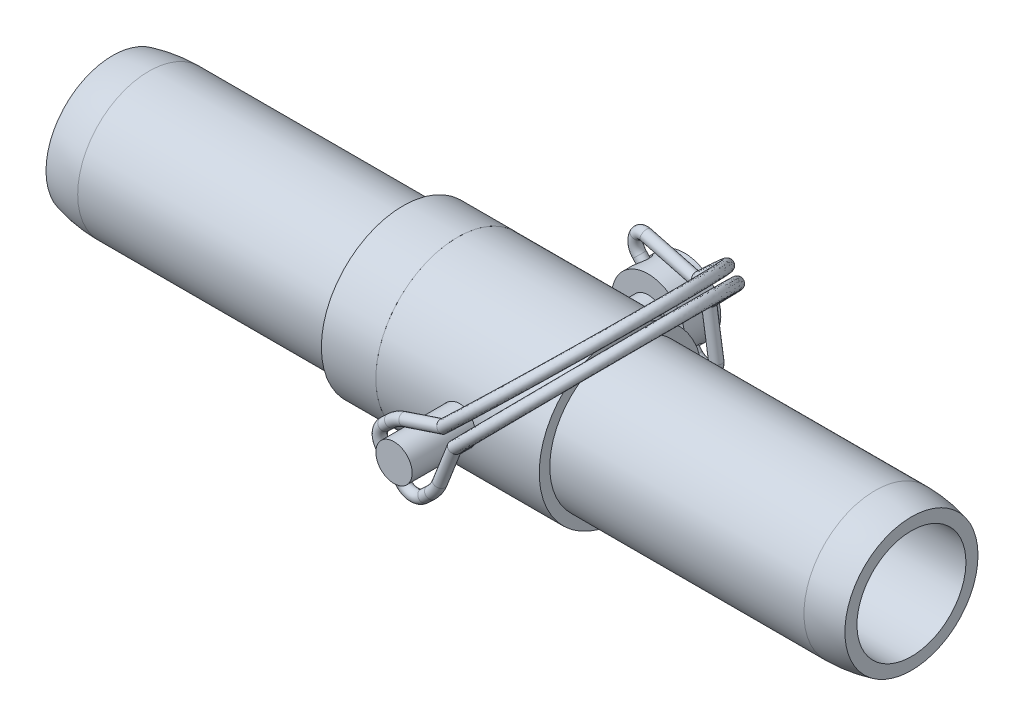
ISO-10303-21;
HEADER;
FILE_DESCRIPTION(('STEP AP214'),'2;1');
FILE_NAME('part.step','',(''),(''),'','','');
FILE_SCHEMA(('AUTOMOTIVE_DESIGN { 1 0 10303 214 1 1 1 1 }'));
ENDSEC;
DATA;
#1=APPLICATION_CONTEXT('core data for automotive mechanical design processes');
#2=APPLICATION_PROTOCOL_DEFINITION('international standard','automotive_design',2000,#1);
#3=PRODUCT_CONTEXT('',#1,'mechanical');
#4=PRODUCT('Part','Part','',(#3));
#5=PRODUCT_RELATED_PRODUCT_CATEGORY('part','',(#4));
#6=PRODUCT_DEFINITION_FORMATION('','',#4);
#7=PRODUCT_DEFINITION_CONTEXT('part definition',#1,'design');
#8=PRODUCT_DEFINITION('design','',#6,#7);
#9=PRODUCT_DEFINITION_SHAPE('','',#8);
#10=(LENGTH_UNIT() NAMED_UNIT(*) SI_UNIT(.MILLI.,.METRE.));
#11=(NAMED_UNIT(*) PLANE_ANGLE_UNIT() SI_UNIT($,.RADIAN.));
#12=(NAMED_UNIT(*) SI_UNIT($,.STERADIAN.) SOLID_ANGLE_UNIT());
#13=UNCERTAINTY_MEASURE_WITH_UNIT(LENGTH_MEASURE(1.E-05),#10,'distance_accuracy_value','');
#14=(GEOMETRIC_REPRESENTATION_CONTEXT(3) GLOBAL_UNCERTAINTY_ASSIGNED_CONTEXT((#13)) GLOBAL_UNIT_ASSIGNED_CONTEXT((#10,
#11,#12)) REPRESENTATION_CONTEXT('',''));
#15=CARTESIAN_POINT('',(0.,0.,0.));
#16=DIRECTION('',(0.,0.,1.));
#17=DIRECTION('',(1.,0.,0.));
#18=AXIS2_PLACEMENT_3D('',#15,#16,#17);
#19=CARTESIAN_POINT('',(24.4075097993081,-3.20252001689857,-22.2250000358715));
#20=DIRECTION('',(-1.02350395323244E-08,-9.73028757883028E-09,-1.));
#21=DIRECTION('',(-0.724751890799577,-0.689009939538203,1.41221291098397E-08));
#22=AXIS2_PLACEMENT_3D('',#19,#20,#21);
#23=TOROIDAL_SURFACE('',#22,2.54,0.952500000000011);
#24=CARTESIAN_POINT('',(25.4817856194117,-5.50415670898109,-22.2250000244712));
#25=DIRECTION('',(-0.906156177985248,-0.422943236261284,1.33899037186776E-08));
#26=DIRECTION('',(-0.422943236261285,0.906156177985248,-1.60815212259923E-08));
#27=AXIS2_PLACEMENT_3D('',#24,#25,#26);
#28=CIRCLE('',#27,0.952500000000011);
#29=CARTESIAN_POINT('',(25.8846390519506,-6.36727046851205,-22.2250000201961));
#30=VERTEX_POINT('',#29);
#31=EDGE_CURVE('P0_E20',#30,#30,#28,.T.);
#32=CARTESIAN_POINT('',(22.5666399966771,-4.9526052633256,-22.2250000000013));
#33=DIRECTION('',(-0.689009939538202,0.724751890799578,0.));
#34=DIRECTION('',(0.724751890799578,0.689009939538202,-2.57153308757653E-08));
#35=AXIS2_PLACEMENT_3D('',#32,#33,#34);
#36=CIRCLE('',#35,0.952500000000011);
#37=CARTESIAN_POINT('',(21.8763138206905,-5.60888723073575,-22.22499998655));
#38=VERTEX_POINT('',#37);
#39=EDGE_CURVE('P0_E9',#38,#38,#36,.T.);
#40=CARTESIAN_POINT('',(24.4075097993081,-3.20252001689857,-22.2250000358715));
#41=DIRECTION('',(-1.02350395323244E-08,-9.73028757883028E-09,-1.));
#42=DIRECTION('',(-0.724751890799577,-0.689009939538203,1.41221291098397E-08));
#43=AXIS2_PLACEMENT_3D('',#40,#41,#42);
#44=CIRCLE('',#43,3.49250000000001);
#45=EDGE_CURVE('',#30,#38,#44,.T.);
#46=ORIENTED_EDGE('',*,*,#31,.T.);
#47=ORIENTED_EDGE('',*,*,#39,.F.);
#48=ORIENTED_EDGE('',*,*,#45,.T.);
#49=ORIENTED_EDGE('',*,*,#45,.F.);
#50=EDGE_LOOP('',(#46,#48,#47,#49));
#51=FACE_BOUND('',#50,.T.);
#52=ADVANCED_FACE('P0_F14',(#51),#23,.T.);
#53=CARTESIAN_POINT('',(24.9446477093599,-4.35333836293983,-22.2250000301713));
#54=DIRECTION('',(-1.02350581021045E-08,-9.73024822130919E-09,-1.));
#55=DIRECTION('',(-0.724751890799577,-0.689009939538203,1.41221154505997E-08));
#56=AXIS2_PLACEMENT_3D('',#53,#54,#55);
#57=TOROIDAL_SURFACE('',#56,1.27,0.952500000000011);
#58=CARTESIAN_POINT('',(26.1999360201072,-4.16059174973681,-22.2250000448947));
#59=DIRECTION('',(0.15176898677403,-0.988415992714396,8.06416847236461E-09));
#60=DIRECTION('',(-0.988415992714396,-0.15176898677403,0.));
#61=AXIS2_PLACEMENT_3D('',#58,#59,#60);
#62=CIRCLE('',#61,0.952500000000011);
#63=CARTESIAN_POINT('',(27.1414022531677,-4.01603178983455,-22.2250000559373));
#64=VERTEX_POINT('',#63);
#65=EDGE_CURVE('P0_E79',#64,#64,#62,.T.);
#66=CARTESIAN_POINT('',(24.9446477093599,-4.35333836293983,-22.2250000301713));
#67=DIRECTION('',(-1.02350581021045E-08,-9.73024822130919E-09,-1.));
#68=DIRECTION('',(-0.724751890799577,-0.689009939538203,1.41221154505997E-08));
#69=AXIS2_PLACEMENT_3D('',#66,#67,#68);
#70=CIRCLE('',#69,2.22250000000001);
#71=EDGE_CURVE('',#64,#30,#70,.T.);
#72=ORIENTED_EDGE('',*,*,#65,.T.);
#73=ORIENTED_EDGE('',*,*,#31,.F.);
#74=ORIENTED_EDGE('',*,*,#71,.T.);
#75=ORIENTED_EDGE('',*,*,#71,.F.);
#76=EDGE_LOOP('',(#72,#74,#73,#75));
#77=FACE_BOUND('',#76,.T.);
#78=ADVANCED_FACE('P0_F99',(#77),#57,.T.);
#79=CARTESIAN_POINT('',(22.3279477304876,-2.15426920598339,22.2249998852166));
#80=DIRECTION('',(0.363121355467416,0.931741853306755,0.));
#81=DIRECTION('',(0.931741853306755,-0.363121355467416,0.));
#82=AXIS2_PLACEMENT_3D('',#79,#80,#81);
#83=CYLINDRICAL_SURFACE('',#82,0.952500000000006);
#84=CARTESIAN_POINT('',(22.3279477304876,-2.15426920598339,22.2249998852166));
#85=DIRECTION('',(-0.363121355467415,-0.931741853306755,0.));
#86=DIRECTION('',(-0.931741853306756,0.363121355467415,0.));
#87=AXIS2_PLACEMENT_3D('',#84,#85,#86);
#88=CIRCLE('',#87,0.952500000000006);
#89=CARTESIAN_POINT('',(23.2154318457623,-2.5001422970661,22.2249998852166));
#90=VERTEX_POINT('',#89);
#91=EDGE_CURVE('P0_E28',#90,#90,#88,.T.);
#92=ORIENTED_EDGE('',*,*,#91,.F.);
#93=EDGE_LOOP('',(#92));
#94=FACE_BOUND('',#93,.T.);
#95=CARTESIAN_POINT('',(24.8845785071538,4.40585143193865,22.2249998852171));
#96=DIRECTION('',(0.543339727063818,0.839512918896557,0.));
#97=DIRECTION('',(-0.839512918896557,0.543339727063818,3.20579919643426E-13));
#98=AXIS2_PLACEMENT_3D('',#95,#96,#97);
#99=ELLIPSE('',#98,0.972427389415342,0.952500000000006);
#100=CARTESIAN_POINT('',(24.0682131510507,4.93420986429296,22.2249998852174));
#101=VERTEX_POINT('',#100);
#102=EDGE_CURVE('P0_E24',#101,#101,#99,.T.);
#103=ORIENTED_EDGE('',*,*,#102,.F.);
#104=EDGE_LOOP('',(#103));
#105=FACE_BOUND('',#104,.T.);
#106=ADVANCED_FACE('P0_F102',(#94,#105),#83,.T.);
#107=CARTESIAN_POINT('',(16.4113869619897,0.151551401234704,22.2249998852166));
#108=DIRECTION('',(0.,0.,1.));
#109=DIRECTION('',(-0.689009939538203,0.724751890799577,0.));
#110=AXIS2_PLACEMENT_3D('',#107,#108,#109);
#111=TOROIDAL_SURFACE('',#110,6.35,0.952500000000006);
#112=CARTESIAN_POINT('',(20.7866000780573,-4.45062310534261,22.2249998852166));
#113=DIRECTION('',(-0.724751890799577,-0.689009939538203,0.));
#114=DIRECTION('',(-0.689009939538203,0.724751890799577,0.));
#115=AXIS2_PLACEMENT_3D('',#112,#113,#114);
#116=CIRCLE('',#115,0.952500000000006);
#117=CARTESIAN_POINT('',(21.4428820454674,-5.14094928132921,22.2249998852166));
#118=VERTEX_POINT('',#117);
#119=EDGE_CURVE('P0_E33',#118,#118,#116,.T.);
#120=CARTESIAN_POINT('',(16.4113869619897,0.151551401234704,22.2249998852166));
#121=DIRECTION('',(0.,0.,1.));
#122=DIRECTION('',(-0.689009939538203,0.724751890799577,0.));
#123=AXIS2_PLACEMENT_3D('',#120,#121,#122);
#124=CIRCLE('',#123,7.3025);
#125=EDGE_CURVE('',#118,#90,#124,.T.);
#126=ORIENTED_EDGE('',*,*,#119,.F.);
#127=ORIENTED_EDGE('',*,*,#91,.T.);
#128=ORIENTED_EDGE('',*,*,#125,.T.);
#129=ORIENTED_EDGE('',*,*,#125,.F.);
#130=EDGE_LOOP('',(#126,#128,#127,#129));
#131=FACE_BOUND('',#130,.T.);
#132=ADVANCED_FACE('P0_F108',(#131),#111,.T.);
#133=CARTESIAN_POINT('',(19.6037836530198,-5.57510761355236,22.2249998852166));
#134=DIRECTION('',(0.724751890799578,0.689009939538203,0.));
#135=DIRECTION('',(0.689009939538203,-0.724751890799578,0.));
#136=AXIS2_PLACEMENT_3D('',#133,#134,#135);
#137=CYLINDRICAL_SURFACE('',#136,0.952500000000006);
#138=CARTESIAN_POINT('',(19.6037836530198,-5.57510761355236,22.2249998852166));
#139=DIRECTION('',(-0.724751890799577,-0.689009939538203,0.));
#140=DIRECTION('',(-0.689009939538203,0.724751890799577,0.));
#141=AXIS2_PLACEMENT_3D('',#138,#139,#140);
#142=CIRCLE('',#141,0.952500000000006);
#143=CARTESIAN_POINT('',(20.26006562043,-6.26543378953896,22.2249998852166));
#144=VERTEX_POINT('',#143);
#145=EDGE_CURVE('P0_E36',#144,#144,#142,.T.);
#146=ORIENTED_EDGE('',*,*,#145,.F.);
#147=EDGE_LOOP('',(#146));
#148=FACE_BOUND('',#147,.T.);
#149=ORIENTED_EDGE('',*,*,#119,.T.);
#150=EDGE_LOOP('',(#149));
#151=FACE_BOUND('',#150,.T.);
#152=ADVANCED_FACE('P0_F114',(#148,#151),#137,.T.);
#153=CARTESIAN_POINT('',(17.8536984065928,-3.73423781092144,22.2249998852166));
#154=DIRECTION('',(0.,0.,1.));
#155=DIRECTION('',(-0.689009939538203,0.724751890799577,0.));
#156=AXIS2_PLACEMENT_3D('',#153,#154,#155);
#157=TOROIDAL_SURFACE('',#156,2.54,0.952500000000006);
#158=CARTESIAN_POINT('',(16.0128286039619,-5.48432305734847,22.2249998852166));
#159=DIRECTION('',(-0.689009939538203,0.724751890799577,0.));
#160=DIRECTION('',(0.724751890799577,0.689009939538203,0.));
#161=AXIS2_PLACEMENT_3D('',#158,#159,#160);
#162=CIRCLE('',#161,0.952500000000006);
#163=CARTESIAN_POINT('',(15.3225024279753,-6.14060502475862,22.2249998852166));
#164=VERTEX_POINT('',#163);
#165=EDGE_CURVE('P0_E39',#164,#164,#162,.T.);
#166=CARTESIAN_POINT('',(17.8536984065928,-3.73423781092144,22.2249998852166));
#167=DIRECTION('',(0.,0.,1.));
#168=DIRECTION('',(-0.689009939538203,0.724751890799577,0.));
#169=AXIS2_PLACEMENT_3D('',#166,#167,#168);
#170=CIRCLE('',#169,3.4925);
#171=EDGE_CURVE('',#164,#144,#170,.T.);
#172=ORIENTED_EDGE('',*,*,#165,.F.);
#173=ORIENTED_EDGE('',*,*,#145,.T.);
#174=ORIENTED_EDGE('',*,*,#171,.T.);
#175=ORIENTED_EDGE('',*,*,#171,.F.);
#176=EDGE_LOOP('',(#172,#174,#173,#175));
#177=FACE_BOUND('',#176,.T.);
#178=ADVANCED_FACE('P0_F118',(#177),#157,.T.);
#179=CARTESIAN_POINT('',(12.5126581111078,-1.80258345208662,22.2249998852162));
#180=DIRECTION('',(0.689009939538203,-0.724751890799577,1.78946005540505E-13));
#181=DIRECTION('',(-1.23516439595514E-13,1.29481484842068E-13,1.));
#182=AXIS2_PLACEMENT_3D('',#179,#180,#181);
#183=CYLINDRICAL_SURFACE('',#182,0.952500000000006);
#184=CARTESIAN_POINT('',(12.5126581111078,-1.80258345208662,22.2249998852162));
#185=DIRECTION('',(-0.689009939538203,0.724751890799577,0.));
#186=DIRECTION('',(0.724751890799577,0.689009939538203,0.));
#187=AXIS2_PLACEMENT_3D('',#184,#185,#186);
#188=CIRCLE('',#187,0.952500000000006);
#189=CARTESIAN_POINT('',(11.8223319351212,-2.45886541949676,22.2249998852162));
#190=VERTEX_POINT('',#189);
#191=EDGE_CURVE('P0_E42',#190,#190,#188,.T.);
#192=ORIENTED_EDGE('',*,*,#191,.F.);
#193=EDGE_LOOP('',(#192));
#194=FACE_BOUND('',#193,.T.);
#195=ORIENTED_EDGE('',*,*,#165,.T.);
#196=EDGE_LOOP('',(#195));
#197=FACE_BOUND('',#196,.T.);
#198=ADVANCED_FACE('P0_F122',(#194,#197),#183,.T.);
#199=CARTESIAN_POINT('',(14.3535279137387,-0.0524982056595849,22.2249998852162));
#200=DIRECTION('',(0.,0.,1.));
#201=DIRECTION('',(-0.689009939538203,0.724751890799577,0.));
#202=AXIS2_PLACEMENT_3D('',#199,#200,#201);
#203=TOROIDAL_SURFACE('',#202,2.54,0.952500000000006);
#204=CARTESIAN_POINT('',(12.6034426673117,1.78837159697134,22.2249998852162));
#205=DIRECTION('',(0.724751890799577,0.689009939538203,0.));
#206=DIRECTION('',(0.689009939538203,-0.724751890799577,0.));
#207=AXIS2_PLACEMENT_3D('',#204,#205,#206);
#208=CIRCLE('',#207,0.952500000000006);
#209=CARTESIAN_POINT('',(11.9471606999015,2.47869777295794,22.2249998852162));
#210=VERTEX_POINT('',#209);
#211=EDGE_CURVE('P0_E45',#210,#210,#208,.T.);
#212=CARTESIAN_POINT('',(14.3535279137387,-0.0524982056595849,22.2249998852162));
#213=DIRECTION('',(0.,0.,1.));
#214=DIRECTION('',(-0.689009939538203,0.724751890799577,0.));
#215=AXIS2_PLACEMENT_3D('',#212,#213,#214);
#216=CIRCLE('',#215,3.4925);
#217=EDGE_CURVE('',#210,#190,#216,.T.);
#218=ORIENTED_EDGE('',*,*,#211,.F.);
#219=ORIENTED_EDGE('',*,*,#191,.T.);
#220=ORIENTED_EDGE('',*,*,#217,.T.);
#221=ORIENTED_EDGE('',*,*,#217,.F.);
#222=EDGE_LOOP('',(#218,#220,#219,#221));
#223=FACE_BOUND('',#222,.T.);
#224=ADVANCED_FACE('P0_F126',(#223),#203,.T.);
#225=CARTESIAN_POINT('',(13.7862590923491,2.91285610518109,22.2249998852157));
#226=DIRECTION('',(-0.724751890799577,-0.689009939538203,2.78181378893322E-13));
#227=DIRECTION('',(2.01605616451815E-13,1.91676954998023E-13,1.));
#228=AXIS2_PLACEMENT_3D('',#225,#226,#227);
#229=CYLINDRICAL_SURFACE('',#228,0.952500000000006);
#230=CARTESIAN_POINT('',(13.7862590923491,2.91285610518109,22.2249998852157));
#231=DIRECTION('',(0.724751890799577,0.689009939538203,0.));
#232=DIRECTION('',(0.689009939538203,-0.724751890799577,0.));
#233=AXIS2_PLACEMENT_3D('',#230,#231,#232);
#234=CIRCLE('',#233,0.952500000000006);
#235=CARTESIAN_POINT('',(13.129977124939,3.60318228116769,22.2249998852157));
#236=VERTEX_POINT('',#235);
#237=EDGE_CURVE('P0_E48',#236,#236,#234,.T.);
#238=ORIENTED_EDGE('',*,*,#237,.F.);
#239=EDGE_LOOP('',(#238));
#240=FACE_BOUND('',#239,.T.);
#241=ORIENTED_EDGE('',*,*,#211,.T.);
#242=EDGE_LOOP('',(#241));
#243=FACE_BOUND('',#242,.T.);
#244=ADVANCED_FACE('P0_F130',(#240,#243),#229,.T.);
#245=CARTESIAN_POINT('',(18.1614722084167,-1.68931840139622,22.2249998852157));
#246=DIRECTION('',(0.,0.,1.));
#247=DIRECTION('',(-0.689009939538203,0.724751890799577,0.));
#248=AXIS2_PLACEMENT_3D('',#245,#246,#247);
#249=TOROIDAL_SURFACE('',#248,6.35,0.952500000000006);
#250=CARTESIAN_POINT('',(16.1575646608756,4.33619855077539,22.2249998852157));
#251=DIRECTION('',(0.948900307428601,0.315575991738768,0.));
#252=DIRECTION('',(0.315575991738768,-0.948900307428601,0.));
#253=AXIS2_PLACEMENT_3D('',#250,#251,#252);
#254=CIRCLE('',#253,0.952500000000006);
#255=CARTESIAN_POINT('',(15.8569785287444,5.24002609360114,22.2249998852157));
#256=VERTEX_POINT('',#255);
#257=EDGE_CURVE('P0_E73',#256,#256,#254,.T.);
#258=CARTESIAN_POINT('',(18.1614722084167,-1.68931840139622,22.2249998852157));
#259=DIRECTION('',(0.,0.,1.));
#260=DIRECTION('',(-0.689009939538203,0.724751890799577,0.));
#261=AXIS2_PLACEMENT_3D('',#258,#259,#260);
#262=CIRCLE('',#261,7.3025);
#263=EDGE_CURVE('',#256,#236,#262,.T.);
#264=ORIENTED_EDGE('',*,*,#257,.F.);
#265=ORIENTED_EDGE('',*,*,#237,.T.);
#266=ORIENTED_EDGE('',*,*,#263,.T.);
#267=ORIENTED_EDGE('',*,*,#263,.F.);
#268=EDGE_LOOP('',(#264,#266,#265,#267));
#269=FACE_BOUND('',#268,.T.);
#270=ADVANCED_FACE('P0_F134',(#269),#249,.T.);
#271=CARTESIAN_POINT('',(13.8145214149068,8.92114081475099,-22.2250000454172));
#272=DIRECTION('',(0.967381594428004,-0.253323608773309,-7.43623795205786E-09));
#273=DIRECTION('',(-0.253323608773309,-0.967381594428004,0.));
#274=AXIS2_PLACEMENT_3D('',#271,#272,#273);
#275=CYLINDRICAL_SURFACE('',#274,0.9525);
#276=CARTESIAN_POINT('',(13.8145214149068,8.92114081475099,-22.2250000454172));
#277=DIRECTION('',(0.967381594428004,-0.253323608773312,-7.43623842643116E-09));
#278=DIRECTION('',(-1.38124624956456E-08,-2.33917541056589E-08,-1.));
#279=AXIS2_PLACEMENT_3D('',#276,#277,#278);
#280=CIRCLE('',#279,0.9525);
#281=CARTESIAN_POINT('',(14.0558121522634,9.84257178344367,-22.2250000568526));
#282=VERTEX_POINT('',#281);
#283=EDGE_CURVE('P0_E51',#282,#282,#280,.T.);
#284=ORIENTED_EDGE('',*,*,#283,.T.);
#285=EDGE_LOOP('',(#284));
#286=FACE_BOUND('',#285,.T.);
#287=CARTESIAN_POINT('',(23.1103386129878,5.50227283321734,-22.2250001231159));
#288=CARTESIAN_POINT('',(23.110338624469,5.50227282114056,-20.3200001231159));
#289=CARTESIAN_POINT('',(22.5666472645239,7.61387993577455,-20.3200001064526));
#290=CARTESIAN_POINT('',(22.5666472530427,7.61387994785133,-22.2250001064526));
#291=CARTESIAN_POINT('',(22.5666472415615,7.61387995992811,-24.1300001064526));
#292=CARTESIAN_POINT('',(23.1103386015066,5.50227284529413,-24.1300001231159));
#293=CARTESIAN_POINT('',(23.1103386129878,5.50227283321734,-22.2250001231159));
#294=(BOUNDED_CURVE() B_SPLINE_CURVE(3,(#287,#288,#289,#290,#291,#292,#293),.UNSPECIFIED.,.T.,
.F.) B_SPLINE_CURVE_WITH_KNOTS((4,3,4),(0.,0.5,1.),
.UNSPECIFIED.) CURVE() GEOMETRIC_REPRESENTATION_ITEM() RATIONAL_B_SPLINE_CURVE((1.,
0.333333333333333,0.333333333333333,1.,0.333333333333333,0.333333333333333,1.)) REPRESENTATION_ITEM(''));
#295=CARTESIAN_POINT('',(23.1103386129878,5.50227283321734,-22.2250001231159));
#296=VERTEX_POINT('',#295);
#297=EDGE_CURVE('P0_E65',#296,#296,#294,.T.);
#298=ORIENTED_EDGE('',*,*,#297,.T.);
#299=EDGE_LOOP('',(#298));
#300=FACE_BOUND('',#299,.T.);
#301=ADVANCED_FACE('P0_F138',(#286,#300),#275,.T.);
#302=CARTESIAN_POINT('',(13.4928004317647,7.69256618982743,-22.22500003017));
#303=DIRECTION('',(-1.02350032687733E-08,-9.73030540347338E-09,-1.));
#304=DIRECTION('',(-0.724751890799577,-0.689009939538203,1.41221151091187E-08));
#305=AXIS2_PLACEMENT_3D('',#302,#303,#304);
#306=TOROIDAL_SURFACE('',#305,1.27,0.9525);
#307=CARTESIAN_POINT('',(12.3705941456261,8.28716946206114,-22.2250000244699));
#308=DIRECTION('',(0.468191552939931,0.883626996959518,-1.33899033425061E-08));
#309=DIRECTION('',(2.2436554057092E-09,-1.63421487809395E-08,-1.));
#310=AXIS2_PLACEMENT_3D('',#307,#308,#309);
#311=CIRCLE('',#310,0.9525);
#312=CARTESIAN_POINT('',(11.5289394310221,8.73312191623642,-22.2250000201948));
#313=VERTEX_POINT('',#312);
#314=EDGE_CURVE('P0_E54',#313,#313,#311,.T.);
#315=CARTESIAN_POINT('',(13.4928004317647,7.69256618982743,-22.22500003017));
#316=DIRECTION('',(-1.02350032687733E-08,-9.73030540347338E-09,-1.));
#317=DIRECTION('',(-0.724751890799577,-0.689009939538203,1.41221151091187E-08));
#318=AXIS2_PLACEMENT_3D('',#315,#316,#317);
#319=CIRCLE('',#318,2.2225);
#320=EDGE_CURVE('',#313,#282,#319,.T.);
#321=ORIENTED_EDGE('',*,*,#314,.T.);
#322=ORIENTED_EDGE('',*,*,#283,.F.);
#323=ORIENTED_EDGE('',*,*,#320,.T.);
#324=ORIENTED_EDGE('',*,*,#320,.F.);
#325=EDGE_LOOP('',(#321,#323,#322,#324));
#326=FACE_BOUND('',#325,.T.);
#327=ADVANCED_FACE('P0_F142',(#326),#306,.T.);
#328=CARTESIAN_POINT('',(14.6150067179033,7.09796291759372,-22.2250000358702));
#329=DIRECTION('',(-1.02350394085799E-08,-9.73028746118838E-09,-1.));
#330=DIRECTION('',(-0.724751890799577,-0.689009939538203,1.41221289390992E-08));
#331=AXIS2_PLACEMENT_3D('',#328,#329,#330);
#332=TOROIDAL_SURFACE('',#331,2.54,0.9525);
#333=CARTESIAN_POINT('',(12.7741369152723,5.34787767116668,-22.225));
#334=DIRECTION('',(-0.689009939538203,0.724751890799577,0.));
#335=DIRECTION('',(0.,0.,-1.));
#336=AXIS2_PLACEMENT_3D('',#333,#334,#335);
#337=CIRCLE('',#336,0.9525);
#338=CARTESIAN_POINT('',(12.0838107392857,4.69159570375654,-22.2249999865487));
#339=VERTEX_POINT('',#338);
#340=EDGE_CURVE('P0_E57',#339,#339,#337,.T.);
#341=CARTESIAN_POINT('',(14.6150067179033,7.09796291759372,-22.2250000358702));
#342=DIRECTION('',(-1.02350394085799E-08,-9.73028746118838E-09,-1.));
#343=DIRECTION('',(-0.724751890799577,-0.689009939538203,1.41221289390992E-08));
#344=AXIS2_PLACEMENT_3D('',#341,#342,#343);
#345=CIRCLE('',#344,3.4925);
#346=EDGE_CURVE('',#339,#313,#345,.T.);
#347=ORIENTED_EDGE('',*,*,#340,.T.);
#348=ORIENTED_EDGE('',*,*,#314,.F.);
#349=ORIENTED_EDGE('',*,*,#346,.T.);
#350=ORIENTED_EDGE('',*,*,#346,.F.);
#351=EDGE_LOOP('',(#347,#349,#348,#350));
#352=FACE_BOUND('',#351,.T.);
#353=ADVANCED_FACE('P0_F146',(#352),#332,.T.);
#354=CARTESIAN_POINT('',(12.7741369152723,5.34787767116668,-22.225));
#355=DIRECTION('',(0.689009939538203,-0.724751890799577,0.));
#356=DIRECTION('',(-0.724751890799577,-0.689009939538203,0.));
#357=AXIS2_PLACEMENT_3D('',#354,#355,#356);
#358=CYLINDRICAL_SURFACE('',#357,0.9525);
#359=ORIENTED_EDGE('',*,*,#340,.F.);
#360=EDGE_LOOP('',(#359));
#361=FACE_BOUND('',#360,.T.);
#362=ORIENTED_EDGE('',*,*,#39,.T.);
#363=EDGE_LOOP('',(#362));
#364=FACE_BOUND('',#363,.T.);
#365=ADVANCED_FACE('P0_F150',(#361,#364),#358,.T.);
#366=CARTESIAN_POINT('',(23.1103386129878,5.50227283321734,-22.2250001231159));
#367=CARTESIAN_POINT('',(23.825385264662,6.18205615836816,-22.2250001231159));
#368=CARTESIAN_POINT('',(25.3964031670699,7.67559755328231,-22.1684227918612));
#369=CARTESIAN_POINT('',(27.8215665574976,9.98116129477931,-21.5085288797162));
#370=CARTESIAN_POINT('',(30.4387615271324,12.4692863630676,-20.1957515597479));
#371=CARTESIAN_POINT('',(32.9096328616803,14.8183039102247,-18.1862364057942));
#372=CARTESIAN_POINT('',(35.1107678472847,16.9108874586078,-15.5549942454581));
#373=CARTESIAN_POINT('',(36.9461201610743,18.6557273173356,-12.4561371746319));
#374=CARTESIAN_POINT('',(38.4109690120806,20.0483355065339,-8.75263493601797));
#375=CARTESIAN_POINT('',(39.3665810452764,20.9568204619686,-4.57724930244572));
#376=CARTESIAN_POINT('',(39.7114300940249,21.2846628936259,-0.139303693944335));
#377=CARTESIAN_POINT('',(39.4062518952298,20.9945348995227,4.30366457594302));
#378=CARTESIAN_POINT('',(38.4884393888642,20.1219853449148,8.49346997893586));
#379=CARTESIAN_POINT('',(37.058489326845,18.762554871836,12.2200360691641));
#380=CARTESIAN_POINT('',(35.2525290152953,17.0456575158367,15.3470024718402));
#381=CARTESIAN_POINT('',(33.0790134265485,14.9793312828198,18.0136959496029));
#382=CARTESIAN_POINT('',(30.6302978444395,12.6513768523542,20.0635425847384));
#383=CARTESIAN_POINT('',(28.0313315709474,10.1805815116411,21.4242031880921));
#384=CARTESIAN_POINT('',(25.6170308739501,7.88534475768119,22.1178551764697));
#385=CARTESIAN_POINT('',(24.0556343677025,6.40095026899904,22.2249998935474));
#386=CARTESIAN_POINT('',(23.340745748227,5.72131718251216,22.2249998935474));
#387=CARTESIAN_POINT('',(23.110338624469,5.50227282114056,-20.3200001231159));
#388=CARTESIAN_POINT('',(23.7896775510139,6.14810938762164,-20.3200001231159));
#389=CARTESIAN_POINT('',(25.1913259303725,7.48063390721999,-20.2753956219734));
#390=CARTESIAN_POINT('',(27.4290084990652,9.60796265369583,-19.6753611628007));
#391=CARTESIAN_POINT('',(29.8209650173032,11.8819571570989,-18.4797407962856));
#392=CARTESIAN_POINT('',(32.0859579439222,14.0352494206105,-16.6448847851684));
#393=CARTESIAN_POINT('',(34.1009347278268,15.9508553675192,-14.2422008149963));
#394=CARTESIAN_POINT('',(35.786091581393,17.5529068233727,-11.4038036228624));
#395=CARTESIAN_POINT('',(37.1268068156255,18.8275031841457,-8.02089899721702));
#396=CARTESIAN_POINT('',(38.0040971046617,19.6615289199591,-4.20071221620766));
#397=CARTESIAN_POINT('',(38.3216045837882,19.9633781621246,-0.139298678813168));
#398=CARTESIAN_POINT('',(38.043767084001,19.6992425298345,3.92713726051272));
#399=CARTESIAN_POINT('',(37.2042722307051,18.9011483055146,7.7617437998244));
#400=CARTESIAN_POINT('',(35.8984636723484,17.659737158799,11.1677113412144));
#401=CARTESIAN_POINT('',(34.2426654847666,16.0855965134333,14.0342182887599));
#402=CARTESIAN_POINT('',(32.2554226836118,14.1963568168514,16.4723478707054));
#403=CARTESIAN_POINT('',(30.0121291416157,12.0636938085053,18.3475394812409));
#404=CARTESIAN_POINT('',(27.6398941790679,9.8084482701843,19.5910404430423));
#405=CARTESIAN_POINT('',(25.4084130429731,7.68701512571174,20.2248307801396));
#406=CARTESIAN_POINT('',(24.0266422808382,6.3733879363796,20.3199998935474));
#407=CARTESIAN_POINT('',(23.3407457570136,5.72131716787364,20.3199998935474));
#408=CARTESIAN_POINT('',(22.5666472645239,7.61387993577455,-20.3200001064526));
#409=CARTESIAN_POINT('',(23.2459861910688,8.25971650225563,-20.3200001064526));
#410=CARTESIAN_POINT('',(24.5529409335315,9.50221730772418,-20.1135483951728));
#411=CARTESIAN_POINT('',(26.7205677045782,11.5629451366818,-19.4307491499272));
#412=CARTESIAN_POINT('',(29.0077122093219,13.7372965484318,-18.1292568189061));
#413=CARTESIAN_POINT('',(31.1790644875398,15.8015661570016,-16.2264123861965));
#414=CARTESIAN_POINT('',(33.0838700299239,17.6124340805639,-13.8015868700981));
#415=CARTESIAN_POINT('',(34.677191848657,19.127179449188,-10.967672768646));
#416=CARTESIAN_POINT('',(35.9316126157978,20.319737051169,-7.61479916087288));
#417=CARTESIAN_POINT('',(36.738703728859,21.087025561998,-3.84937820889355));
#418=CARTESIAN_POINT('',(37.0052464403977,21.340423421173,0.139191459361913));
#419=CARTESIAN_POINT('',(36.6990649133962,21.0493415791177,4.12274317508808));
#420=CARTESIAN_POINT('',(35.8542056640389,20.2461475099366,7.8737484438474));
#421=CARTESIAN_POINT('',(34.5649200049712,19.0204444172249,11.2035756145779));
#422=CARTESIAN_POINT('',(32.9422347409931,17.4777836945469,14.0093699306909));
#423=CARTESIAN_POINT('',(31.0098390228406,15.6406862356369,16.3988747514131));
#424=CARTESIAN_POINT('',(28.8160785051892,13.55511347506,18.261293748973));
#425=CARTESIAN_POINT('',(26.5121329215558,11.3647895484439,19.5149632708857));
#426=CARTESIAN_POINT('',(24.3293295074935,9.28963352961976,20.1640536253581));
#427=CARTESIAN_POINT('',(23.0221366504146,8.04690635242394,20.319999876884));
#428=CARTESIAN_POINT('',(22.33624012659,7.39483558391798,20.319999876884));
#429=CARTESIAN_POINT('',(22.5666472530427,7.61387994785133,-22.2250001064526));
#430=CARTESIAN_POINT('',(23.2638400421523,8.27668989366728,-22.2250001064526));
#431=CARTESIAN_POINT('',(24.7673798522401,9.70608095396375,-22.0065755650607));
#432=CARTESIAN_POINT('',(27.1101211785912,11.9332873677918,-21.2639168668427));
#433=CARTESIAN_POINT('',(29.6264667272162,14.3255365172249,-19.8452675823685));
#434=CARTESIAN_POINT('',(32.002507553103,16.5844002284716,-17.7677640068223));
#435=CARTESIAN_POINT('',(34.0937662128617,18.5725261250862,-15.1143803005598));
#436=CARTESIAN_POINT('',(35.8372019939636,20.2299824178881,-12.0200063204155));
#437=CARTESIAN_POINT('',(37.2157801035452,21.5405744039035,-8.34653509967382));
#438=CARTESIAN_POINT('',(38.1011861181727,22.3823156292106,-4.22591529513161));
#439=CARTESIAN_POINT('',(38.3950726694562,22.6617088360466,0.139186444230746));
#440=CARTESIAN_POINT('',(38.0615484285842,22.3446327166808,4.49927049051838));
#441=CARTESIAN_POINT('',(37.1383771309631,21.4669886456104,8.60547462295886));
#442=CARTESIAN_POINT('',(35.724930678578,20.1232478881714,12.2559003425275));
#443=CARTESIAN_POINT('',(33.9521495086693,18.4378934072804,15.3221541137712));
#444=CARTESIAN_POINT('',(31.833241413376,16.4234816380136,17.9402228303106));
#445=CARTESIAN_POINT('',(29.4350254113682,14.1435363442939,19.9772968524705));
#446=CARTESIAN_POINT('',(26.9011300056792,11.7346028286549,21.3481260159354));
#447=CARTESIAN_POINT('',(24.5455494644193,9.49519038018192,22.0570780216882));
#448=CARTESIAN_POINT('',(23.0366326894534,8.06068752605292,22.2249998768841));
#449=CARTESIAN_POINT('',(22.3362401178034,7.3948355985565,22.224999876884));
#450=CARTESIAN_POINT('',(22.5666472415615,7.61387995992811,-24.1300001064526));
#451=CARTESIAN_POINT('',(23.2816938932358,8.29366328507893,-24.1300001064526));
#452=CARTESIAN_POINT('',(24.9818187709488,9.90994460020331,-23.8996027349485));
#453=CARTESIAN_POINT('',(27.4996746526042,12.3036295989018,-23.0970845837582));
#454=CARTESIAN_POINT('',(30.2452212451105,14.9137764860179,-21.5612783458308));
#455=CARTESIAN_POINT('',(32.8259506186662,17.3672342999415,-19.309115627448));
#456=CARTESIAN_POINT('',(35.1036623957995,19.5326181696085,-16.4271737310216));
#457=CARTESIAN_POINT('',(36.9972121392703,21.3327853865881,-13.072339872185));
#458=CARTESIAN_POINT('',(38.4999475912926,22.7614117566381,-9.07827103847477));
#459=CARTESIAN_POINT('',(39.4636685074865,23.6776056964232,-4.60245238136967));
#460=CARTESIAN_POINT('',(39.7848988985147,23.9829942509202,0.139181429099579));
#461=CARTESIAN_POINT('',(39.4240319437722,23.6399238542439,4.87579780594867));
#462=CARTESIAN_POINT('',(38.4225485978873,22.6878297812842,9.33720080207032));
#463=CARTESIAN_POINT('',(36.8849413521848,21.226051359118,13.3082250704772));
#464=CARTESIAN_POINT('',(34.9620642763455,19.3980031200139,16.6349382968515));
#465=CARTESIAN_POINT('',(32.6566438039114,17.2062770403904,19.4815709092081));
#466=CARTESIAN_POINT('',(30.0539723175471,14.7319592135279,21.693299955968));
#467=CARTESIAN_POINT('',(27.2901270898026,12.1044161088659,23.1812887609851));
#468=CARTESIAN_POINT('',(24.7617694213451,9.70074723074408,23.9501024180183));
#469=CARTESIAN_POINT('',(23.0511287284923,8.07446869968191,24.129999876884));
#470=CARTESIAN_POINT('',(22.3362401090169,7.39483561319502,24.129999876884));
#471=CARTESIAN_POINT('',(23.1103386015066,5.50227284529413,-24.1300001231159));
#472=CARTESIAN_POINT('',(23.8610929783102,6.21600292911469,-24.1300001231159));
#473=CARTESIAN_POINT('',(25.6014804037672,7.87056119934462,-24.0614499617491));
#474=CARTESIAN_POINT('',(28.2141246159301,10.3543599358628,-23.3416965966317));
#475=CARTESIAN_POINT('',(31.0565580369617,13.0566155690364,-21.9117623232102));
#476=CARTESIAN_POINT('',(33.7333077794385,15.6013583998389,-19.72758802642));
#477=CARTESIAN_POINT('',(36.1206009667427,17.8709195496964,-16.8677876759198));
#478=CARTESIAN_POINT('',(38.1061487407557,19.7585478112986,-13.5084707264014));
#479=CARTESIAN_POINT('',(39.6951312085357,21.2691678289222,-9.48437087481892));
#480=CARTESIAN_POINT('',(40.7290649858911,22.252112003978,-4.95378638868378));
#481=CARTESIAN_POINT('',(41.1012556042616,22.6059476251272,-0.139308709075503));
#482=CARTESIAN_POINT('',(40.7687367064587,22.289827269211,4.68019189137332));
#483=CARTESIAN_POINT('',(39.7726065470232,21.342822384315,9.22519615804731));
#484=CARTESIAN_POINT('',(38.2185149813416,19.8653725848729,13.2723607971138));
#485=CARTESIAN_POINT('',(36.262392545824,18.0057185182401,16.6597866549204));
#486=CARTESIAN_POINT('',(33.9026041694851,15.7623057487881,19.5550440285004));
#487=CARTESIAN_POINT('',(31.2484665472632,13.239059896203,21.7795456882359));
#488=CARTESIAN_POINT('',(28.4227689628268,10.5527147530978,23.2573659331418));
#489=CARTESIAN_POINT('',(25.8256487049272,8.08367438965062,24.0108795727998));
#490=CARTESIAN_POINT('',(24.0846264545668,6.42851260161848,24.1299998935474));
#491=CARTESIAN_POINT('',(23.3407457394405,5.72131719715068,24.1299998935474));
#492=CARTESIAN_POINT('',(23.1103386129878,5.50227283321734,-22.2250001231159));
#493=CARTESIAN_POINT('',(23.825385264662,6.18205615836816,-22.2250001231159));
#494=CARTESIAN_POINT('',(25.3964031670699,7.67559755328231,-22.1684227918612));
#495=CARTESIAN_POINT('',(27.8215665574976,9.98116129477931,-21.5085288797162));
#496=CARTESIAN_POINT('',(30.4387615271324,12.4692863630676,-20.1957515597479));
#497=CARTESIAN_POINT('',(32.9096328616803,14.8183039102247,-18.1862364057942));
#498=CARTESIAN_POINT('',(35.1107678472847,16.9108874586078,-15.5549942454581));
#499=CARTESIAN_POINT('',(36.9461201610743,18.6557273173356,-12.4561371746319));
#500=CARTESIAN_POINT('',(38.4109690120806,20.0483355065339,-8.75263493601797));
#501=CARTESIAN_POINT('',(39.3665810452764,20.9568204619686,-4.57724930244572));
#502=CARTESIAN_POINT('',(39.7114300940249,21.2846628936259,-0.139303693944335));
#503=CARTESIAN_POINT('',(39.4062518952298,20.9945348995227,4.30366457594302));
#504=CARTESIAN_POINT('',(38.4884393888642,20.1219853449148,8.49346997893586));
#505=CARTESIAN_POINT('',(37.058489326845,18.762554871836,12.2200360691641));
#506=CARTESIAN_POINT('',(35.2525290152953,17.0456575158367,15.3470024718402));
#507=CARTESIAN_POINT('',(33.0790134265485,14.9793312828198,18.0136959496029));
#508=CARTESIAN_POINT('',(30.6302978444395,12.6513768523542,20.0635425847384));
#509=CARTESIAN_POINT('',(28.0313315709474,10.1805815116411,21.4242031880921));
#510=CARTESIAN_POINT('',(25.6170308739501,7.88534475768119,22.1178551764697));
#511=CARTESIAN_POINT('',(24.0556343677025,6.40095026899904,22.2249998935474));
#512=CARTESIAN_POINT('',(23.340745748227,5.72131718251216,22.2249998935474));
#513=(BOUNDED_SURFACE() B_SPLINE_SURFACE(3,3,((#366,#367,#368,#369,#370,#371,#372,#373,#374,
#375,#376,#377,#378,#379,#380,#381,#382,#383,#384,#385,#386),(#387,#388,#389,#390,#391,#392,
#393,#394,#395,#396,#397,#398,#399,#400,#401,#402,#403,#404,#405,#406,#407),(#408,#409,#410,
#411,#412,#413,#414,#415,#416,#417,#418,#419,#420,#421,#422,#423,#424,#425,#426,#427,#428),
(#429,#430,#431,#432,#433,#434,#435,#436,#437,#438,#439,#440,#441,#442,#443,#444,#445,#446,#447,
#448,#449),(#450,#451,#452,#453,#454,#455,#456,#457,#458,#459,#460,#461,#462,#463,#464,#465,
#466,#467,#468,#469,#470),(#471,#472,#473,#474,#475,#476,#477,#478,#479,#480,#481,#482,#483,
#484,#485,#486,#487,#488,#489,#490,#491),(#492,#493,#494,#495,#496,#497,#498,#499,#500,#501,
#502,#503,#504,#505,#506,#507,#508,#509,#510,#511,#512)),.UNSPECIFIED.,.T.,.F.,
.F.) B_SPLINE_SURFACE_WITH_KNOTS((4,3,4),(4,1,1,1,1,1,1,1,1,1,1,1,1,1,1,1,1,1,4),(0.,0.5,1.),
(0.,0.0424820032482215,0.0904581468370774,0.144600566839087,0.204975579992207,0.258006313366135,
0.31464773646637,0.374473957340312,0.436654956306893,0.500067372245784,0.563478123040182,
0.625654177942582,0.685472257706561,0.742102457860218,0.795118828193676,0.855474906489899,
0.909595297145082,0.957546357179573,1.),
.UNSPECIFIED.) GEOMETRIC_REPRESENTATION_ITEM() RATIONAL_B_SPLINE_SURFACE(((1.,1.,1.,1.,1.,1.,1.,
1.,1.,1.,1.,1.,1.,1.,1.,1.,1.,1.,1.,1.,1.),(0.333333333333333,0.333333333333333,
0.333333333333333,0.333333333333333,0.333333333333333,0.333333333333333,0.333333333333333,
0.333333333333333,0.333333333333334,0.333333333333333,0.333333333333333,0.333333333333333,
0.333333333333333,0.333333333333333,0.333333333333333,0.333333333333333,0.333333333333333,
0.333333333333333,0.333333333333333,0.333333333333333,0.333333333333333),(0.333333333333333,
0.333333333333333,0.333333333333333,0.333333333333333,0.333333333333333,0.333333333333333,
0.333333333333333,0.333333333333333,0.333333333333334,0.333333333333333,0.333333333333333,
0.333333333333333,0.333333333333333,0.333333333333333,0.333333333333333,0.333333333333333,
0.333333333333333,0.333333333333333,0.333333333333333,0.333333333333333,0.333333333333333),(1.,
1.,1.,1.,1.,1.,1.,1.,1.,1.,1.,1.,1.,1.,1.,1.,1.,1.,1.,1.,1.),(0.333333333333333,
0.333333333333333,0.333333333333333,0.333333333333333,0.333333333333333,0.333333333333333,
0.333333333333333,0.333333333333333,0.333333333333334,0.333333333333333,0.333333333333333,
0.333333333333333,0.333333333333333,0.333333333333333,0.333333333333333,0.333333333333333,
0.333333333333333,0.333333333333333,0.333333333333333,0.333333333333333,0.333333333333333),
(0.333333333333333,0.333333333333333,0.333333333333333,0.333333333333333,0.333333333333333,
0.333333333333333,0.333333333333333,0.333333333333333,0.333333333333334,0.333333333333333,
0.333333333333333,0.333333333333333,0.333333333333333,0.333333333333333,0.333333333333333,
0.333333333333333,0.333333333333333,0.333333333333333,0.333333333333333,0.333333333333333,
0.333333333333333),(1.,1.,1.,1.,1.,1.,1.,1.,1.,1.,1.,1.,1.,1.,1.,1.,1.,1.,1.,1.,1.))) REPRESENTATION_ITEM('') SURFACE());
#514=CARTESIAN_POINT('',(23.340745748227,5.72131718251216,22.2249998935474));
#515=CARTESIAN_POINT('',(23.3407457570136,5.72131716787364,20.3199998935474));
#516=CARTESIAN_POINT('',(22.33624012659,7.39483558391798,20.319999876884));
#517=CARTESIAN_POINT('',(22.3362401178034,7.3948355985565,22.224999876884));
#518=CARTESIAN_POINT('',(22.3362401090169,7.39483561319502,24.129999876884));
#519=CARTESIAN_POINT('',(23.3407457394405,5.72131719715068,24.1299998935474));
#520=CARTESIAN_POINT('',(23.340745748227,5.72131718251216,22.2249998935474));
#521=(BOUNDED_CURVE() B_SPLINE_CURVE(3,(#514,#515,#516,#517,#518,#519,#520),.UNSPECIFIED.,.T.,
.F.) B_SPLINE_CURVE_WITH_KNOTS((4,3,4),(0.,0.5,1.),
.UNSPECIFIED.) CURVE() GEOMETRIC_REPRESENTATION_ITEM() RATIONAL_B_SPLINE_CURVE((1.,
0.333333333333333,0.333333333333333,1.,0.333333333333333,0.333333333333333,1.)) REPRESENTATION_ITEM(''));
#522=CARTESIAN_POINT('',(23.340745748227,5.72131718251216,22.2249998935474));
#523=VERTEX_POINT('',#522);
#524=EDGE_CURVE('P0_E60',#523,#523,#521,.F.);
#525=ORIENTED_EDGE('',*,*,#297,.F.);
#526=EDGE_LOOP('',(#525));
#527=FACE_BOUND('',#526,.T.);
#528=ORIENTED_EDGE('',*,*,#524,.F.);
#529=EDGE_LOOP('',(#528));
#530=FACE_BOUND('',#529,.T.);
#531=ADVANCED_FACE('P0_F154',(#527,#530),#513,.F.);
#532=CARTESIAN_POINT('',(23.340745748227,5.72131718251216,22.2249998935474));
#533=CARTESIAN_POINT('',(16.4581507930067,3.43237100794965,22.2249998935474));
#534=CARTESIAN_POINT('',(23.3407457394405,5.72131719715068,24.1299998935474));
#535=CARTESIAN_POINT('',(16.4581507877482,3.43237102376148,24.1299998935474));
#536=CARTESIAN_POINT('',(22.3362401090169,7.39483561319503,24.129999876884));
#537=CARTESIAN_POINT('',(15.8569785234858,5.24002610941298,24.129999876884));
#538=CARTESIAN_POINT('',(22.3362401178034,7.39483559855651,22.224999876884));
#539=CARTESIAN_POINT('',(15.8569785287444,5.24002609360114,22.224999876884));
#540=CARTESIAN_POINT('',(22.33624012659,7.39483558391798,20.319999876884));
#541=CARTESIAN_POINT('',(15.8569785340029,5.2400260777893,20.319999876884));
#542=CARTESIAN_POINT('',(23.3407457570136,5.72131716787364,20.3199998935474));
#543=CARTESIAN_POINT('',(16.4581507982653,3.43237099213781,20.3199998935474));
#544=CARTESIAN_POINT('',(23.340745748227,5.72131718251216,22.2249998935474));
#545=CARTESIAN_POINT('',(16.4581507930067,3.43237100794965,22.2249998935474));
#546=(BOUNDED_SURFACE() B_SPLINE_SURFACE(3,1,((#532,#533),(#534,#535),(#536,#537),(#538,#539),
(#540,#541),(#542,#543),(#544,#545)),.UNSPECIFIED.,.T.,.F.,.F.) B_SPLINE_SURFACE_WITH_KNOTS((4,
3,4),(2,2),(0.,0.5,1.),(0.,1.),
.UNSPECIFIED.) GEOMETRIC_REPRESENTATION_ITEM() RATIONAL_B_SPLINE_SURFACE(((1.,1.),
(0.333333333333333,0.333333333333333),(0.333333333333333,0.333333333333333),(1.,1.),
(0.333333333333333,0.333333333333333),(0.333333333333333,0.333333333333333),(1.,1.))) REPRESENTATION_ITEM('') SURFACE());
#547=ORIENTED_EDGE('',*,*,#524,.T.);
#548=EDGE_LOOP('',(#547));
#549=FACE_BOUND('',#548,.T.);
#550=ORIENTED_EDGE('',*,*,#257,.T.);
#551=EDGE_LOOP('',(#550));
#552=FACE_BOUND('',#551,.T.);
#553=ADVANCED_FACE('P0_F160',(#549,#552),#546,.T.);
#554=CARTESIAN_POINT('',(24.0682131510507,4.93420986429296,22.2249998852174));
#555=CARTESIAN_POINT('',(24.7599547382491,5.63738097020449,22.2249998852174));
#556=CARTESIAN_POINT('',(26.2676692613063,7.1700071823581,22.115507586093));
#557=CARTESIAN_POINT('',(28.6018380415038,9.54274300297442,21.4213966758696));
#558=CARTESIAN_POINT('',(31.1139414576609,12.0963534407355,20.0605426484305));
#559=CARTESIAN_POINT('',(33.4814352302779,14.5029648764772,18.0114728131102));
#560=CARTESIAN_POINT('',(35.5825391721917,16.6387849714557,15.3469296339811));
#561=CARTESIAN_POINT('',(37.3288307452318,18.4139301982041,12.2226189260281));
#562=CARTESIAN_POINT('',(38.7119789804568,19.8199319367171,8.49932962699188));
#563=CARTESIAN_POINT('',(39.6004575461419,20.7230906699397,4.31310249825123));
#564=CARTESIAN_POINT('',(39.8970770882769,21.0246112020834,-0.126311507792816));
#565=CARTESIAN_POINT('',(39.5656545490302,20.6877126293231,-4.56110383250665));
#566=CARTESIAN_POINT('',(38.6440681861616,19.750899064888,-8.73406796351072));
#567=CARTESIAN_POINT('',(37.2304637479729,18.3139379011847,-12.4361734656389));
#568=CARTESIAN_POINT('',(35.4586678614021,16.5128669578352,-15.5347010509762));
#569=CARTESIAN_POINT('',(33.3338517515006,14.3529429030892,-18.1667933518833));
#570=CARTESIAN_POINT('',(30.947476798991,11.9271383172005,-20.1792122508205));
#571=CARTESIAN_POINT('',(28.420284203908,9.35818938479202,-21.4968097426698));
#572=CARTESIAN_POINT('',(26.0772760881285,6.97646817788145,-22.1604681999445));
#573=CARTESIAN_POINT('',(24.5624921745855,5.43665576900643,-22.2250001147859));
#574=CARTESIAN_POINT('',(23.8706273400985,4.73335937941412,-22.2250001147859));
#575=CARTESIAN_POINT('',(24.0682131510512,4.93420986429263,24.1299998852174));
#576=CARTESIAN_POINT('',(24.7343677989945,5.61137126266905,24.1299998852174));
#577=CARTESIAN_POINT('',(26.4976683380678,7.40380649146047,24.0085314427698));
#578=CARTESIAN_POINT('',(28.971574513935,9.91858856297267,23.2545585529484));
#579=CARTESIAN_POINT('',(31.7149802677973,12.7073231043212,21.7765440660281));
#580=CARTESIAN_POINT('',(34.2776648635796,15.3123504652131,19.5528228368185));
#581=CARTESIAN_POINT('',(36.5599009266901,17.6322954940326,16.6597125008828));
#582=CARTESIAN_POINT('',(38.4512475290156,19.5548924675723,13.2749429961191));
#583=CARTESIAN_POINT('',(39.9545896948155,21.0830740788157,9.23105547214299));
#584=CARTESIAN_POINT('',(40.9188296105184,22.0632459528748,4.68963014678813));
#585=CARTESIAN_POINT('',(41.2419122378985,22.3916668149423,-0.126315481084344));
#586=CARTESIAN_POINT('',(40.8840251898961,22.0278664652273,-4.93763919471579));
#587=CARTESIAN_POINT('',(39.8866780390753,21.0140403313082,-9.46580144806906));
#588=CARTESIAN_POINT('',(38.3528725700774,19.4548920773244,-13.4885044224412));
#589=CARTESIAN_POINT('',(36.4360415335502,17.506389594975,-16.8474910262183));
#590=CARTESIAN_POINT('',(34.130016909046,15.1622629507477,-19.7081461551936));
#591=CARTESIAN_POINT('',(31.5487639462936,12.5383604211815,-21.8952194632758));
#592=CARTESIAN_POINT('',(28.7892068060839,9.73320762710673,-23.3299753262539));
#593=CARTESIAN_POINT('',(26.3097794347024,7.21281313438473,-24.0534941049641));
#594=CARTESIAN_POINT('',(24.5320975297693,5.40575891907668,-24.1300001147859));
#595=CARTESIAN_POINT('',(23.8706273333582,4.73335937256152,-24.1300001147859));
#596=CARTESIAN_POINT('',(25.7009438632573,3.877492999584,24.1299998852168));
#597=CARTESIAN_POINT('',(26.3670985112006,4.55465439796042,24.1299998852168));
#598=CARTESIAN_POINT('',(28.0645883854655,6.280191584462,23.9524368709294));
#599=CARTESIAN_POINT('',(30.4953092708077,8.7510748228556,23.1840740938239));
#600=CARTESIAN_POINT('',(33.1780931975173,11.4781858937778,21.6962588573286));
#601=CARTESIAN_POINT('',(35.6966535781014,14.0383599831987,19.4838412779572));
#602=CARTESIAN_POINT('',(37.9299819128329,16.30858919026,16.6349788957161));
#603=CARTESIAN_POINT('',(39.7916768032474,18.2010445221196,13.3056261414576));
#604=CARTESIAN_POINT('',(41.2800479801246,19.7140077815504,9.33133317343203));
#605=CARTESIAN_POINT('',(42.2487174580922,20.6986824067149,4.86636802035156));
#606=CARTESIAN_POINT('',(42.5965861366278,21.0522988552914,0.126214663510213));
#607=CARTESIAN_POINT('',(42.283493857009,20.7340334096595,-4.61855555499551));
#608=CARTESIAN_POINT('',(41.3479061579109,19.7829871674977,-9.09677890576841));
#609=CARTESIAN_POINT('',(39.8899644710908,18.300956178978,-13.0922400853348));
#610=CARTESIAN_POINT('',(38.0537489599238,16.4344012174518,-16.4473821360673));
#611=CARTESIAN_POINT('',(35.8441187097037,14.1882616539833,-19.3285876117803));
#612=CARTESIAN_POINT('',(33.3446041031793,11.6474480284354,-21.5777310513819));
#613=CARTESIAN_POINT('',(30.6759007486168,8.93465018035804,-23.1087516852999));
#614=CARTESIAN_POINT('',(28.2570769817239,6.47586063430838,-23.9075265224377));
#615=CARTESIAN_POINT('',(26.5599998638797,4.75074302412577,-24.1300001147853));
#616=CARTESIAN_POINT('',(25.8985296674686,4.0783434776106,-24.1300001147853));
#617=CARTESIAN_POINT('',(25.7009438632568,3.87749299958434,22.2249998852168));
#618=CARTESIAN_POINT('',(26.3798919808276,4.56765925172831,22.2249998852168));
#619=CARTESIAN_POINT('',(27.8412987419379,6.05321256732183,22.0594130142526));
#620=CARTESIAN_POINT('',(30.1234189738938,8.37303985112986,21.3509122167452));
#621=CARTESIAN_POINT('',(32.5777412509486,10.86791444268,19.9802574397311));
#622=CARTESIAN_POINT('',(34.9002577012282,13.2288054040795,17.9424912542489));
#623=CARTESIAN_POINT('',(36.9526653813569,15.3151246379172,15.3221960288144));
#624=CARTESIAN_POINT('',(38.6692467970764,17.060068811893,12.2533020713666));
#625=CARTESIAN_POINT('',(40.0374410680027,18.4508695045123,8.59960732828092));
#626=CARTESIAN_POINT('',(40.9303442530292,19.3585259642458,4.48984037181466));
#627=CARTESIAN_POINT('',(41.2517516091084,19.6852438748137,0.126218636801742));
#628=CARTESIAN_POINT('',(40.9651218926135,19.3938782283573,-4.24202019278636));
#629=CARTESIAN_POINT('',(40.1053008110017,18.5198504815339,-8.36504542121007));
#630=CARTESIAN_POINT('',(38.7675399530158,17.1599860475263,-12.0399091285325));
#631=CARTESIAN_POINT('',(37.0764289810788,15.4409331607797,-15.1345921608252));
#632=CARTESIAN_POINT('',(35.0477561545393,13.3787409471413,-17.7872348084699));
#633=CARTESIAN_POINT('',(32.7441325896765,11.0370550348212,-19.8617238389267));
#634=CARTESIAN_POINT('',(30.3044202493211,8.55703177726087,-21.2755861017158));
#635=CARTESIAN_POINT('',(28.032542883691,6.24761660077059,-22.0145006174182));
#636=CARTESIAN_POINT('',(26.575197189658,4.76619145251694,-22.2250001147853));
#637=CARTESIAN_POINT('',(25.898529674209,4.0783434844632,-22.2250001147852));
#638=CARTESIAN_POINT('',(25.7009438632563,3.87749299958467,20.3199998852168));
#639=CARTESIAN_POINT('',(26.3926854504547,4.58066410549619,20.3199998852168));
#640=CARTESIAN_POINT('',(27.6180090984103,5.82623355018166,20.1663891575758));
#641=CARTESIAN_POINT('',(29.75152867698,7.99500487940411,19.5177503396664));
#642=CARTESIAN_POINT('',(31.9773893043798,10.2576429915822,18.2642560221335));
#643=CARTESIAN_POINT('',(34.1038618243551,12.4192508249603,16.4011412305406));
#644=CARTESIAN_POINT('',(35.975348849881,14.3216600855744,14.0094131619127));
#645=CARTESIAN_POINT('',(37.5468167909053,15.9190931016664,11.2009780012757));
#646=CARTESIAN_POINT('',(38.7948341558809,17.1877312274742,7.86788148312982));
#647=CARTESIAN_POINT('',(39.6119710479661,18.0183695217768,4.11331272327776));
#648=CARTESIAN_POINT('',(39.9069170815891,18.318188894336,0.12622261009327));
#649=CARTESIAN_POINT('',(39.6467499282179,18.053723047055,-3.86548483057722));
#650=CARTESIAN_POINT('',(38.8626954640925,17.2567137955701,-7.63331193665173));
#651=CARTESIAN_POINT('',(37.6451154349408,16.0190159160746,-10.9875781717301));
#652=CARTESIAN_POINT('',(36.0991090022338,14.4474651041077,-13.8218021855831));
#653=CARTESIAN_POINT('',(34.2513935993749,12.5692202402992,-16.2458820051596));
#654=CARTESIAN_POINT('',(32.1436610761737,10.4266620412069,-18.1457166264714));
#655=CARTESIAN_POINT('',(29.9329397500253,8.17941337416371,-19.4424205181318));
#656=CARTESIAN_POINT('',(27.8080087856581,6.01937256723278,-20.1214747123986));
#657=CARTESIAN_POINT('',(26.5903945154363,4.78163988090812,-20.3200001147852));
#658=CARTESIAN_POINT('',(25.8985296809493,4.07834349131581,-20.3200001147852));
#659=CARTESIAN_POINT('',(24.0682131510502,4.9342098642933,20.3199998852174));
#660=CARTESIAN_POINT('',(24.7855416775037,5.66339067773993,20.3199998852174));
#661=CARTESIAN_POINT('',(26.0376701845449,6.93620787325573,20.2224837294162));
#662=CARTESIAN_POINT('',(28.2321015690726,9.16689744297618,19.5882347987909));
#663=CARTESIAN_POINT('',(30.5129026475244,11.4853837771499,18.344541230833));
#664=CARTESIAN_POINT('',(32.6852055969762,13.6935792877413,16.4701227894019));
#665=CARTESIAN_POINT('',(34.6051774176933,15.6452744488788,14.0341467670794));
#666=CARTESIAN_POINT('',(36.2064139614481,17.2729679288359,11.1702948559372));
#667=CARTESIAN_POINT('',(37.4693682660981,18.5567897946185,7.76760378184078));
#668=CARTESIAN_POINT('',(38.2820854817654,19.3829353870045,3.93657484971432));
#669=CARTESIAN_POINT('',(38.5522419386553,19.6575555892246,-0.126307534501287));
#670=CARTESIAN_POINT('',(38.2472839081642,19.3475587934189,-4.1845684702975));
#671=CARTESIAN_POINT('',(37.4014583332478,18.4877577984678,-8.00233447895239));
#672=CARTESIAN_POINT('',(36.1080549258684,17.1729837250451,-11.3838425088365));
#673=CARTESIAN_POINT('',(34.481294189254,15.5193443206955,-14.221911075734));
#674=CARTESIAN_POINT('',(32.5376865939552,13.5436228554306,-16.6254405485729));
#675=CARTESIAN_POINT('',(30.3461896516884,11.3159162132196,-18.4632050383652));
#676=CARTESIAN_POINT('',(28.0513616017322,8.98317114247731,-19.6636441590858));
#677=CARTESIAN_POINT('',(25.8447727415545,6.74012322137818,-20.267442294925));
#678=CARTESIAN_POINT('',(24.5928868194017,5.46755261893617,-20.3200001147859));
#679=CARTESIAN_POINT('',(23.8706273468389,4.73335938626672,-20.3200001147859));
#680=CARTESIAN_POINT('',(24.0682131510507,4.93420986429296,22.2249998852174));
#681=CARTESIAN_POINT('',(24.7599547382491,5.63738097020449,22.2249998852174));
#682=CARTESIAN_POINT('',(26.2676692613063,7.1700071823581,22.115507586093));
#683=CARTESIAN_POINT('',(28.6018380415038,9.54274300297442,21.4213966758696));
#684=CARTESIAN_POINT('',(31.1139414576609,12.0963534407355,20.0605426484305));
#685=CARTESIAN_POINT('',(33.4814352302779,14.5029648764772,18.0114728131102));
#686=CARTESIAN_POINT('',(35.5825391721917,16.6387849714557,15.3469296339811));
#687=CARTESIAN_POINT('',(37.3288307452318,18.4139301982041,12.2226189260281));
#688=CARTESIAN_POINT('',(38.7119789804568,19.8199319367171,8.49932962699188));
#689=CARTESIAN_POINT('',(39.6004575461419,20.7230906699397,4.31310249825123));
#690=CARTESIAN_POINT('',(39.8970770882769,21.0246112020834,-0.126311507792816));
#691=CARTESIAN_POINT('',(39.5656545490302,20.6877126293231,-4.56110383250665));
#692=CARTESIAN_POINT('',(38.6440681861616,19.750899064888,-8.73406796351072));
#693=CARTESIAN_POINT('',(37.2304637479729,18.3139379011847,-12.4361734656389));
#694=CARTESIAN_POINT('',(35.4586678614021,16.5128669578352,-15.5347010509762));
#695=CARTESIAN_POINT('',(33.3338517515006,14.3529429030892,-18.1667933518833));
#696=CARTESIAN_POINT('',(30.947476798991,11.9271383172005,-20.1792122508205));
#697=CARTESIAN_POINT('',(28.420284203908,9.35818938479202,-21.4968097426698));
#698=CARTESIAN_POINT('',(26.0772760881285,6.97646817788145,-22.1604681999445));
#699=CARTESIAN_POINT('',(24.5624921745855,5.43665576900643,-22.2250001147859));
#700=CARTESIAN_POINT('',(23.8706273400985,4.73335937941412,-22.2250001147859));
#701=(BOUNDED_SURFACE() B_SPLINE_SURFACE(3,3,((#554,#555,#556,#557,#558,#559,#560,#561,#562,
#563,#564,#565,#566,#567,#568,#569,#570,#571,#572,#573,#574),(#575,#576,#577,#578,#579,#580,
#581,#582,#583,#584,#585,#586,#587,#588,#589,#590,#591,#592,#593,#594,#595),(#596,#597,#598,
#599,#600,#601,#602,#603,#604,#605,#606,#607,#608,#609,#610,#611,#612,#613,#614,#615,#616),
(#617,#618,#619,#620,#621,#622,#623,#624,#625,#626,#627,#628,#629,#630,#631,#632,#633,#634,#635,
#636,#637),(#638,#639,#640,#641,#642,#643,#644,#645,#646,#647,#648,#649,#650,#651,#652,#653,
#654,#655,#656,#657,#658),(#659,#660,#661,#662,#663,#664,#665,#666,#667,#668,#669,#670,#671,
#672,#673,#674,#675,#676,#677,#678,#679),(#680,#681,#682,#683,#684,#685,#686,#687,#688,#689,
#690,#691,#692,#693,#694,#695,#696,#697,#698,#699,#700)),.UNSPECIFIED.,.T.,.F.,
.F.) B_SPLINE_SURFACE_WITH_KNOTS((4,3,4),(4,1,1,1,1,1,1,1,1,1,1,1,1,1,1,1,1,1,4),(0.,0.5,1.),
(0.,0.0424526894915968,0.0904039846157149,0.144525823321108,0.204884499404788,0.25790245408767,
0.314534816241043,0.374355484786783,0.436534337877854,0.499947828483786,0.563362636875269,
0.625545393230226,0.685372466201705,0.74201362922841,0.795042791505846,0.85541623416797,
0.909555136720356,0.957525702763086,1.),
.UNSPECIFIED.) GEOMETRIC_REPRESENTATION_ITEM() RATIONAL_B_SPLINE_SURFACE(((1.,1.,1.,1.,1.,1.,1.,
1.,1.,1.,1.,1.,1.,1.,1.,1.,1.,1.,1.,1.,1.),(0.333333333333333,0.333333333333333,
0.333333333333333,0.333333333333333,0.333333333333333,0.333333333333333,0.333333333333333,
0.333333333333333,0.333333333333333,0.333333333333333,0.333333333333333,0.333333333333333,
0.333333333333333,0.333333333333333,0.333333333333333,0.333333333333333,0.333333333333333,
0.333333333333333,0.333333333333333,0.333333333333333,0.333333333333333),(0.333333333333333,
0.333333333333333,0.333333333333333,0.333333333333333,0.333333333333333,0.333333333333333,
0.333333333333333,0.333333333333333,0.333333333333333,0.333333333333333,0.333333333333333,
0.333333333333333,0.333333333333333,0.333333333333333,0.333333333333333,0.333333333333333,
0.333333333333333,0.333333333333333,0.333333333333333,0.333333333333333,0.333333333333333),(1.,
1.,1.,1.,1.,1.,1.,1.,1.,1.,1.,1.,1.,1.,1.,1.,1.,1.,1.,1.,1.),(0.333333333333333,
0.333333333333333,0.333333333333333,0.333333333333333,0.333333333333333,0.333333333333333,
0.333333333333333,0.333333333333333,0.333333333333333,0.333333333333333,0.333333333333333,
0.333333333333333,0.333333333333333,0.333333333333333,0.333333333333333,0.333333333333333,
0.333333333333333,0.333333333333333,0.333333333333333,0.333333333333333,0.333333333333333),
(0.333333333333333,0.333333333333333,0.333333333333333,0.333333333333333,0.333333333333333,
0.333333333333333,0.333333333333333,0.333333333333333,0.333333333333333,0.333333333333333,
0.333333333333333,0.333333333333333,0.333333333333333,0.333333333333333,0.333333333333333,
0.333333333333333,0.333333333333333,0.333333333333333,0.333333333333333,0.333333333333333,
0.333333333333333),(1.,1.,1.,1.,1.,1.,1.,1.,1.,1.,1.,1.,1.,1.,1.,1.,1.,1.,1.,1.,1.))) REPRESENTATION_ITEM('') SURFACE());
#702=CARTESIAN_POINT('',(23.8706273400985,4.73335937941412,-22.2250001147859));
#703=CARTESIAN_POINT('',(23.8706273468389,4.73335938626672,-20.3200001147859));
#704=CARTESIAN_POINT('',(25.8985296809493,4.07834349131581,-20.3200001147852));
#705=CARTESIAN_POINT('',(25.898529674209,4.07834348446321,-22.2250001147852));
#706=CARTESIAN_POINT('',(25.8985296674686,4.0783434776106,-24.1300001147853));
#707=CARTESIAN_POINT('',(23.8706273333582,4.73335937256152,-24.1300001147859));
#708=CARTESIAN_POINT('',(23.8706273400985,4.73335937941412,-22.2250001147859));
#709=(BOUNDED_CURVE() B_SPLINE_CURVE(3,(#702,#703,#704,#705,#706,#707,#708),.UNSPECIFIED.,.T.,
.F.) B_SPLINE_CURVE_WITH_KNOTS((4,3,4),(0.,0.5,1.),
.UNSPECIFIED.) CURVE() GEOMETRIC_REPRESENTATION_ITEM() RATIONAL_B_SPLINE_CURVE((1.,
0.333333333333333,0.333333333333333,1.,0.333333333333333,0.333333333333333,1.)) REPRESENTATION_ITEM(''));
#710=CARTESIAN_POINT('',(23.8706273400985,4.73335937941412,-22.2250001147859));
#711=VERTEX_POINT('',#710);
#712=EDGE_CURVE('P0_E82',#711,#711,#709,.T.);
#713=ORIENTED_EDGE('',*,*,#102,.T.);
#714=EDGE_LOOP('',(#713));
#715=FACE_BOUND('',#714,.T.);
#716=ORIENTED_EDGE('',*,*,#712,.T.);
#717=EDGE_LOOP('',(#716));
#718=FACE_BOUND('',#717,.T.);
#719=ADVANCED_FACE('P0_F91',(#715,#718),#701,.T.);
#720=CARTESIAN_POINT('',(23.8706273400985,4.73335937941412,-22.2250001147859));
#721=CARTESIAN_POINT('',(25.2584697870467,-4.30515170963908,-22.2250000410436));
#722=CARTESIAN_POINT('',(23.8706273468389,4.73335938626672,-20.3200001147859));
#723=CARTESIAN_POINT('',(25.2584697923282,-4.30515169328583,-20.3200000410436));
#724=CARTESIAN_POINT('',(25.8985296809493,4.07834349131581,-20.3200001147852));
#725=CARTESIAN_POINT('',(27.1414022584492,-4.01603177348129,-20.3200000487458));
#726=CARTESIAN_POINT('',(25.898529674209,4.07834348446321,-22.2250001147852));
#727=CARTESIAN_POINT('',(27.1414022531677,-4.01603178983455,-22.2250000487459));
#728=CARTESIAN_POINT('',(25.8985296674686,4.0783434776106,-24.1300001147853));
#729=CARTESIAN_POINT('',(27.1414022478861,-4.01603180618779,-24.1300000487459));
#730=CARTESIAN_POINT('',(23.8706273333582,4.73335937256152,-24.1300001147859));
#731=CARTESIAN_POINT('',(25.2584697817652,-4.30515172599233,-24.1300000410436));
#732=CARTESIAN_POINT('',(23.8706273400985,4.73335937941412,-22.2250001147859));
#733=CARTESIAN_POINT('',(25.2584697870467,-4.30515170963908,-22.2250000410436));
#734=(BOUNDED_SURFACE() B_SPLINE_SURFACE(3,1,((#720,#721),(#722,#723),(#724,#725),(#726,#727),
(#728,#729),(#730,#731),(#732,#733)),.UNSPECIFIED.,.T.,.F.,.F.) B_SPLINE_SURFACE_WITH_KNOTS((4,
3,4),(2,2),(0.,0.5,1.),(0.,1.),
.UNSPECIFIED.) GEOMETRIC_REPRESENTATION_ITEM() RATIONAL_B_SPLINE_SURFACE(((1.,1.),
(0.333333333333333,0.333333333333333),(0.333333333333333,0.333333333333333),(1.,1.),
(0.333333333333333,0.333333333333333),(0.333333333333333,0.333333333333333),(1.,1.))) REPRESENTATION_ITEM('') SURFACE());
#735=ORIENTED_EDGE('',*,*,#712,.F.);
#736=EDGE_LOOP('',(#735));
#737=FACE_BOUND('',#736,.T.);
#738=ORIENTED_EDGE('',*,*,#65,.F.);
#739=EDGE_LOOP('',(#738));
#740=FACE_BOUND('',#739,.T.);
#741=ADVANCED_FACE('P0_F93',(#737,#740),#734,.F.);
#742=CLOSED_SHELL('',(#52,#78,#106,#132,#152,#178,#198,#224,#244,#270,#301,#327,#353,#365,#531,
#553,#719,#741));
#743=MANIFOLD_SOLID_BREP('P0_B1',#742);
#744=CARTESIAN_POINT('',(17.4625,0.,25.4));
#745=DIRECTION('',(0.,0.,1.));
#746=DIRECTION('',(0.724751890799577,0.689009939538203,0.));
#747=AXIS2_PLACEMENT_3D('',#744,#745,#746);
#748=PLANE('',#747);
#749=CARTESIAN_POINT('',(17.4625,0.,25.4));
#750=DIRECTION('',(0.,0.,-1.));
#751=DIRECTION('',(-0.724751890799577,-0.689009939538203,0.));
#752=AXIS2_PLACEMENT_3D('',#749,#750,#751);
#753=CIRCLE('',#752,3.175);
#754=CARTESIAN_POINT('',(15.1614127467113,-2.1876065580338,25.4));
#755=VERTEX_POINT('',#754);
#756=EDGE_CURVE('P1_E10',#755,#755,#753,.T.);
#757=ORIENTED_EDGE('',*,*,#756,.F.);
#758=EDGE_LOOP('',(#757));
#759=FACE_BOUND('',#758,.T.);
#760=ADVANCED_FACE('P1_F15',(#759),#748,.T.);
#761=CARTESIAN_POINT('',(17.4625,0.,-25.4));
#762=DIRECTION('',(0.,0.,-1.));
#763=DIRECTION('',(-0.724751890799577,-0.689009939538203,0.));
#764=AXIS2_PLACEMENT_3D('',#761,#762,#763);
#765=CYLINDRICAL_SURFACE('',#764,3.17499999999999);
#766=ORIENTED_EDGE('',*,*,#756,.T.);
#767=EDGE_LOOP('',(#766));
#768=FACE_BOUND('',#767,.T.);
#769=CARTESIAN_POINT('',(17.4625,0.,-19.05));
#770=DIRECTION('',(0.,0.,-1.));
#771=DIRECTION('',(-0.724751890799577,-0.689009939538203,0.));
#772=AXIS2_PLACEMENT_3D('',#769,#770,#771);
#773=CIRCLE('',#772,3.17499999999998);
#774=CARTESIAN_POINT('',(15.1614127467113,-2.18760655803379,-19.05));
#775=VERTEX_POINT('',#774);
#776=EDGE_CURVE('P1_E26',#775,#775,#773,.T.);
#777=ORIENTED_EDGE('',*,*,#776,.F.);
#778=EDGE_LOOP('',(#777));
#779=FACE_BOUND('',#778,.T.);
#780=ADVANCED_FACE('P1_F58',(#768,#779),#765,.T.);
#781=CARTESIAN_POINT('',(15.1614127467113,-2.18760655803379,-19.05));
#782=DIRECTION('',(0.,0.,1.));
#783=DIRECTION('',(0.724751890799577,0.689009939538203,0.));
#784=AXIS2_PLACEMENT_3D('',#781,#782,#783);
#785=PLANE('',#784);
#786=ORIENTED_EDGE('',*,*,#776,.T.);
#787=EDGE_LOOP('',(#786));
#788=FACE_BOUND('',#787,.T.);
#789=CARTESIAN_POINT('',(17.4625,0.,-19.05));
#790=DIRECTION('',(0.,0.,-1.));
#791=DIRECTION('',(-0.724751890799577,-0.689009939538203,0.));
#792=AXIS2_PLACEMENT_3D('',#789,#790,#791);
#793=CIRCLE('',#792,6.34999999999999);
#794=CARTESIAN_POINT('',(12.8603254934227,-4.37521311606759,-19.05));
#795=VERTEX_POINT('',#794);
#796=EDGE_CURVE('P1_E31',#795,#795,#793,.T.);
#797=ORIENTED_EDGE('',*,*,#796,.F.);
#798=EDGE_LOOP('',(#797));
#799=FACE_BOUND('',#798,.T.);
#800=ADVANCED_FACE('P1_F54',(#788,#799),#785,.T.);
#801=CARTESIAN_POINT('',(17.4625,0.,-25.4));
#802=DIRECTION('',(0.,0.,-1.));
#803=DIRECTION('',(-0.724751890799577,-0.689009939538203,0.));
#804=AXIS2_PLACEMENT_3D('',#801,#802,#803);
#805=CYLINDRICAL_SURFACE('',#804,6.34999999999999);
#806=CARTESIAN_POINT('',(21.8377131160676,-4.60217450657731,-23.8125));
#807=CARTESIAN_POINT('',(21.9012804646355,-4.54174000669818,-23.8124975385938));
#808=CARTESIAN_POINT('',(21.9636051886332,-4.47995851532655,-23.8052064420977));
#809=CARTESIAN_POINT('',(22.0840411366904,-4.35561300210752,-23.7762783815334));
#810=CARTESIAN_POINT('',(22.1421499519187,-4.29304855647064,-23.7546332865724));
#811=CARTESIAN_POINT('',(22.2527305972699,-4.16930113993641,-23.6977351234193));
#812=CARTESIAN_POINT('',(22.3052091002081,-4.10811660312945,-23.6624983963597));
#813=CARTESIAN_POINT('',(22.4036714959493,-3.98914716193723,-23.5794746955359));
#814=CARTESIAN_POINT('',(22.4496551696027,-3.93136237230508,-23.5316872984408));
#815=CARTESIAN_POINT('',(22.5353158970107,-3.8202170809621,-23.4238791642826));
#816=CARTESIAN_POINT('',(22.5748606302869,-3.76695813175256,-23.3636485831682));
#817=CARTESIAN_POINT('',(22.6462161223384,-3.66814802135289,-23.2331130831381));
#818=CARTESIAN_POINT('',(22.6780260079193,-3.62259773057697,-23.162807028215));
#819=CARTESIAN_POINT('',(22.734100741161,-3.54051425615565,-23.0128283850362));
#820=CARTESIAN_POINT('',(22.7582464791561,-3.50412508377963,-22.933032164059));
#821=CARTESIAN_POINT('',(22.798188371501,-3.44300331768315,-22.7671329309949));
#822=CARTESIAN_POINT('',(22.8139858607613,-3.41826886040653,-22.6810309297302));
#823=CARTESIAN_POINT('',(22.8369087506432,-3.38211236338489,-22.506788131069));
#824=CARTESIAN_POINT('',(22.8442015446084,-3.37043355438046,-22.418722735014));
#825=CARTESIAN_POINT('',(22.8506364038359,-3.36013778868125,-22.2415432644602));
#826=CARTESIAN_POINT('',(22.8497797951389,-3.36151870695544,-22.1524293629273));
#827=CARTESIAN_POINT('',(22.8400448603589,-3.3770679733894,-21.9779682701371));
#828=CARTESIAN_POINT('',(22.8313614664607,-3.39092557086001,-21.8925821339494));
#829=CARTESIAN_POINT('',(22.8062946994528,-3.43029117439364,-21.7257195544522));
#830=CARTESIAN_POINT('',(22.7899107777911,-3.45580001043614,-21.6442433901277));
#831=CARTESIAN_POINT('',(22.749327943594,-3.51757337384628,-21.4865605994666));
#832=CARTESIAN_POINT('',(22.7250518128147,-3.55394387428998,-21.4104154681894));
#833=CARTESIAN_POINT('',(22.6688704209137,-3.63574786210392,-21.266236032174));
#834=CARTESIAN_POINT('',(22.6369638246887,-3.68118293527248,-21.1982031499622));
#835=CARTESIAN_POINT('',(22.5647211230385,-3.78070348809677,-21.0701428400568));
#836=CARTESIAN_POINT('',(22.5241705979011,-3.83499868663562,-21.0103989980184));
#837=CARTESIAN_POINT('',(22.4356345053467,-3.94913174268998,-20.9029075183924));
#838=CARTESIAN_POINT('',(22.3876487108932,-4.00896976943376,-20.8551602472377));
#839=CARTESIAN_POINT('',(22.2847478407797,-4.13217637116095,-20.7729131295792));
#840=CARTESIAN_POINT('',(22.2298095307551,-4.19555636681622,-20.7384593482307));
#841=CARTESIAN_POINT('',(22.1142223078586,-4.32335431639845,-20.6841541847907));
#842=CARTESIAN_POINT('',(22.0535744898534,-4.38777206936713,-20.6643000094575));
#843=CARTESIAN_POINT('',(21.9297004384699,-4.51378175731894,-20.6401907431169));
#844=CARTESIAN_POINT('',(21.866579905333,-4.57540382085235,-20.6355494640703));
#845=CARTESIAN_POINT('',(21.7381490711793,-4.69564277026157,-20.6409385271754));
#846=CARTESIAN_POINT('',(21.6728389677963,-4.75425992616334,-20.6509675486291));
#847=CARTESIAN_POINT('',(21.5430429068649,-4.86609761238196,-20.6850942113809));
#848=CARTESIAN_POINT('',(21.4785590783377,-4.91938524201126,-20.7089811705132));
#849=CARTESIAN_POINT('',(21.3515047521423,-5.02043195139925,-20.7699049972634));
#850=CARTESIAN_POINT('',(21.2889344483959,-5.06819047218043,-20.8069431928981));
#851=CARTESIAN_POINT('',(21.1666968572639,-5.15822601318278,-20.8938665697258));
#852=CARTESIAN_POINT('',(21.1071007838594,-5.20039072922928,-20.9439680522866));
#853=CARTESIAN_POINT('',(20.9941245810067,-5.27776700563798,-21.0553193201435));
#854=CARTESIAN_POINT('',(20.9407455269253,-5.31297736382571,-21.1165710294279));
#855=CARTESIAN_POINT('',(20.8409846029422,-5.37698308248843,-21.2502770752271));
#856=CARTESIAN_POINT('',(20.7948066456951,-5.4055997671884,-21.3229694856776));
#857=CARTESIAN_POINT('',(20.713033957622,-5.45516492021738,-21.4764753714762));
#858=CARTESIAN_POINT('',(20.6774387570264,-5.47611372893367,-21.5572884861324));
#859=CARTESIAN_POINT('',(20.6186760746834,-5.51019118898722,-21.7243085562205));
#860=CARTESIAN_POINT('',(20.5954349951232,-5.52336620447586,-21.8104800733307));
#861=CARTESIAN_POINT('',(20.5622440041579,-5.54206250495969,-21.986144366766));
#862=CARTESIAN_POINT('',(20.5522911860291,-5.54758546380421,-22.0756364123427));
#863=CARTESIAN_POINT('',(20.5462910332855,-5.55092266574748,-22.2526447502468));
#864=CARTESIAN_POINT('',(20.5498524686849,-5.54895378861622,-22.3401439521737));
#865=CARTESIAN_POINT('',(20.5698228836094,-5.53779493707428,-22.5131882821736));
#866=CARTESIAN_POINT('',(20.586231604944,-5.52860510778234,-22.5987334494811));
#867=CARTESIAN_POINT('',(20.6309464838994,-5.50309897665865,-22.7649706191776));
#868=CARTESIAN_POINT('',(20.6591812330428,-5.48682542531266,-22.8456884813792));
#869=CARTESIAN_POINT('',(20.7262570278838,-5.44719201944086,-23.0007216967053));
#870=CARTESIAN_POINT('',(20.7650995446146,-5.42383118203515,-23.0750361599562));
#871=CARTESIAN_POINT('',(20.8529218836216,-5.36938268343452,-23.2172453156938));
#872=CARTESIAN_POINT('',(20.9021397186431,-5.33810935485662,-23.2849219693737));
#873=CARTESIAN_POINT('',(21.0081170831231,-5.26831263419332,-23.4098539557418));
#874=CARTESIAN_POINT('',(21.0648784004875,-5.22978752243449,-23.4671068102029));
#875=CARTESIAN_POINT('',(21.1849205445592,-5.14505329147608,-23.5705769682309));
#876=CARTESIAN_POINT('',(21.2483008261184,-5.09871764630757,-23.6165756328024));
#877=CARTESIAN_POINT('',(21.3783488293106,-4.99952936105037,-23.6947577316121));
#878=CARTESIAN_POINT('',(21.445014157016,-4.94668142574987,-23.7269510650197));
#879=CARTESIAN_POINT('',(21.5665988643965,-4.8460175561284,-23.7718301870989));
#880=CARTESIAN_POINT('',(21.6213651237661,-4.79912918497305,-23.7870483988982));
#881=CARTESIAN_POINT('',(21.730282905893,-4.70253398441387,-23.8073839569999));
#882=CARTESIAN_POINT('',(21.7844344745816,-4.65282736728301,-23.8125020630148));
#883=CARTESIAN_POINT('',(21.8377131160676,-4.60217450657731,-23.8125));
#884=B_SPLINE_CURVE_WITH_KNOTS('',3,(#806,#807,#808,#809,#810,#811,#812,#813,#814,#815,#816,
#817,#818,#819,#820,#821,#822,#823,#824,#825,#826,#827,#828,#829,#830,#831,#832,#833,#834,#835,
#836,#837,#838,#839,#840,#841,#842,#843,#844,#845,#846,#847,#848,#849,#850,#851,#852,#853,#854,
#855,#856,#857,#858,#859,#860,#861,#862,#863,#864,#865,#866,#867,#868,#869,#870,#871,#872,#873,
#874,#875,#876,#877,#878,#879,#880,#881,#882,#883),.UNSPECIFIED.,.T.,.F.,(4,2,2,2,2,2,2,2,2,2,2,
2,2,2,2,2,2,2,2,2,2,2,2,2,2,2,2,2,2,2,2,2,2,2,2,2,2,2,4),(0.,0.262862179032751,
0.525873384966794,0.78856935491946,1.0512741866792,1.31883610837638,1.58642822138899,
1.85799568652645,2.12951971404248,2.39560412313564,2.66164523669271,2.92123809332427,
3.18084944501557,3.44308141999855,3.70535931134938,3.97511588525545,4.24488069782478,
4.51557209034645,4.78621167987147,5.04992543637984,5.31361545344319,5.57339790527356,
5.83320659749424,6.09762546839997,6.36209000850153,6.63304605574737,6.90399007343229,
7.17330136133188,7.44255372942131,7.70407167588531,7.96558436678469,8.22554023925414,
8.48553217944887,8.75230635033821,9.01914386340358,9.29081396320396,9.56228893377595,
9.78262207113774,10.0029386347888),.UNSPECIFIED.);
#885=CARTESIAN_POINT('',(21.8377131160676,-4.60217450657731,-23.8125));
#886=VERTEX_POINT('',#885);
#887=EDGE_CURVE('P1_E18',#886,#886,#884,.T.);
#888=ORIENTED_EDGE('',*,*,#887,.F.);
#889=EDGE_LOOP('',(#888));
#890=FACE_BOUND('',#889,.T.);
#891=CARTESIAN_POINT('',(13.0872868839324,4.60217450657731,-23.8125));
#892=CARTESIAN_POINT('',(13.0237195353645,4.54174000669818,-23.8124975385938));
#893=CARTESIAN_POINT('',(12.9613948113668,4.47995851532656,-23.8052064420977));
#894=CARTESIAN_POINT('',(12.8409588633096,4.35561300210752,-23.7762783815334));
#895=CARTESIAN_POINT('',(12.7828500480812,4.29304855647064,-23.7546332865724));
#896=CARTESIAN_POINT('',(12.67226940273,4.16930113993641,-23.6977351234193));
#897=CARTESIAN_POINT('',(12.6197908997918,4.10811660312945,-23.6624983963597));
#898=CARTESIAN_POINT('',(12.5213285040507,3.98914716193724,-23.5794746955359));
#899=CARTESIAN_POINT('',(12.4753448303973,3.93136237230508,-23.5316872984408));
#900=CARTESIAN_POINT('',(12.3896841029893,3.8202170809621,-23.4238791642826));
#901=CARTESIAN_POINT('',(12.3501393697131,3.76695813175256,-23.3636485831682));
#902=CARTESIAN_POINT('',(12.2787838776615,3.66814802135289,-23.2331130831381));
#903=CARTESIAN_POINT('',(12.2469739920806,3.62259773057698,-23.162807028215));
#904=CARTESIAN_POINT('',(12.1908992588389,3.54051425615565,-23.0128283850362));
#905=CARTESIAN_POINT('',(12.1667535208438,3.50412508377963,-22.933032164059));
#906=CARTESIAN_POINT('',(12.126811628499,3.44300331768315,-22.7671329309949));
#907=CARTESIAN_POINT('',(12.1110141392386,3.41826886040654,-22.6810309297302));
#908=CARTESIAN_POINT('',(12.0880912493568,3.38211236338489,-22.5067881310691));
#909=CARTESIAN_POINT('',(12.0807984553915,3.37043355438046,-22.418722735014));
#910=CARTESIAN_POINT('',(12.0743635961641,3.36013778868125,-22.2415432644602));
#911=CARTESIAN_POINT('',(12.0752202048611,3.36151870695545,-22.1524293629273));
#912=CARTESIAN_POINT('',(12.0849551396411,3.3770679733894,-21.9779682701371));
#913=CARTESIAN_POINT('',(12.0936385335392,3.39092557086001,-21.8925821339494));
#914=CARTESIAN_POINT('',(12.1187053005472,3.43029117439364,-21.7257195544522));
#915=CARTESIAN_POINT('',(12.1350892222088,3.45580001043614,-21.6442433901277));
#916=CARTESIAN_POINT('',(12.1756720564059,3.51757337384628,-21.4865605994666));
#917=CARTESIAN_POINT('',(12.1999481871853,3.55394387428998,-21.4104154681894));
#918=CARTESIAN_POINT('',(12.2561295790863,3.63574786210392,-21.266236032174));
#919=CARTESIAN_POINT('',(12.2880361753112,3.68118293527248,-21.1982031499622));
#920=CARTESIAN_POINT('',(12.3602788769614,3.78070348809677,-21.0701428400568));
#921=CARTESIAN_POINT('',(12.4008294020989,3.83499868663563,-21.0103989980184));
#922=CARTESIAN_POINT('',(12.4893654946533,3.94913174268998,-20.9029075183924));
#923=CARTESIAN_POINT('',(12.5373512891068,4.00896976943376,-20.8551602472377));
#924=CARTESIAN_POINT('',(12.6402521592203,4.13217637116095,-20.7729131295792));
#925=CARTESIAN_POINT('',(12.6951904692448,4.19555636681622,-20.7384593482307));
#926=CARTESIAN_POINT('',(12.8107776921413,4.32335431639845,-20.6841541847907));
#927=CARTESIAN_POINT('',(12.8714255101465,4.38777206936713,-20.6643000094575));
#928=CARTESIAN_POINT('',(12.9952995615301,4.51378175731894,-20.6401907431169));
#929=CARTESIAN_POINT('',(13.0584200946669,4.57540382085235,-20.6355494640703));
#930=CARTESIAN_POINT('',(13.1868509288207,4.69564277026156,-20.6409385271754));
#931=CARTESIAN_POINT('',(13.2521610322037,4.75425992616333,-20.6509675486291));
#932=CARTESIAN_POINT('',(13.381957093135,4.86609761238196,-20.6850942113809));
#933=CARTESIAN_POINT('',(13.4464409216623,4.91938524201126,-20.7089811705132));
#934=CARTESIAN_POINT('',(13.5734952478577,5.02043195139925,-20.7699049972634));
#935=CARTESIAN_POINT('',(13.636065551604,5.06819047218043,-20.8069431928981));
#936=CARTESIAN_POINT('',(13.7583031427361,5.15822601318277,-20.8938665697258));
#937=CARTESIAN_POINT('',(13.8178992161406,5.20039072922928,-20.9439680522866));
#938=CARTESIAN_POINT('',(13.9308754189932,5.27776700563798,-21.0553193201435));
#939=CARTESIAN_POINT('',(13.9842544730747,5.3129773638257,-21.1165710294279));
#940=CARTESIAN_POINT('',(14.0840153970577,5.37698308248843,-21.2502770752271));
#941=CARTESIAN_POINT('',(14.1301933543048,5.4055997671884,-21.3229694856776));
#942=CARTESIAN_POINT('',(14.2119660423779,5.45516492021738,-21.4764753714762));
#943=CARTESIAN_POINT('',(14.2475612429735,5.47611372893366,-21.5572884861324));
#944=CARTESIAN_POINT('',(14.3063239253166,5.51019118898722,-21.7243085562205));
#945=CARTESIAN_POINT('',(14.3295650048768,5.52336620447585,-21.8104800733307));
#946=CARTESIAN_POINT('',(14.362755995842,5.54206250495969,-21.986144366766));
#947=CARTESIAN_POINT('',(14.3727088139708,5.54758546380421,-22.0756364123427));
#948=CARTESIAN_POINT('',(14.3787089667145,5.55092266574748,-22.2526447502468));
#949=CARTESIAN_POINT('',(14.3751475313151,5.54895378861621,-22.3401439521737));
#950=CARTESIAN_POINT('',(14.3551771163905,5.53779493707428,-22.5131882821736));
#951=CARTESIAN_POINT('',(14.338768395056,5.52860510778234,-22.5987334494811));
#952=CARTESIAN_POINT('',(14.2940535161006,5.50309897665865,-22.7649706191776));
#953=CARTESIAN_POINT('',(14.2658187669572,5.48682542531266,-22.8456884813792));
#954=CARTESIAN_POINT('',(14.1987429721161,5.44719201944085,-23.0007216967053));
#955=CARTESIAN_POINT('',(14.1599004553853,5.42383118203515,-23.0750361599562));
#956=CARTESIAN_POINT('',(14.0720781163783,5.36938268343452,-23.2172453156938));
#957=CARTESIAN_POINT('',(14.0228602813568,5.33810935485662,-23.2849219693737));
#958=CARTESIAN_POINT('',(13.9168829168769,5.26831263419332,-23.4098539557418));
#959=CARTESIAN_POINT('',(13.8601215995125,5.22978752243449,-23.4671068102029));
#960=CARTESIAN_POINT('',(13.7400794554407,5.14505329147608,-23.5705769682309));
#961=CARTESIAN_POINT('',(13.6766991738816,5.09871764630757,-23.6165756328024));
#962=CARTESIAN_POINT('',(13.5466511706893,4.99952936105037,-23.6947577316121));
#963=CARTESIAN_POINT('',(13.479985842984,4.94668142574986,-23.7269510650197));
#964=CARTESIAN_POINT('',(13.3584011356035,4.8460175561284,-23.7718301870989));
#965=CARTESIAN_POINT('',(13.3036348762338,4.79912918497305,-23.7870483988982));
#966=CARTESIAN_POINT('',(13.1947170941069,4.70253398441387,-23.8073839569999));
#967=CARTESIAN_POINT('',(13.1405655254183,4.65282736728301,-23.8125020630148));
#968=CARTESIAN_POINT('',(13.0872868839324,4.60217450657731,-23.8125));
#969=B_SPLINE_CURVE_WITH_KNOTS('',3,(#891,#892,#893,#894,#895,#896,#897,#898,#899,#900,#901,
#902,#903,#904,#905,#906,#907,#908,#909,#910,#911,#912,#913,#914,#915,#916,#917,#918,#919,#920,
#921,#922,#923,#924,#925,#926,#927,#928,#929,#930,#931,#932,#933,#934,#935,#936,#937,#938,#939,
#940,#941,#942,#943,#944,#945,#946,#947,#948,#949,#950,#951,#952,#953,#954,#955,#956,#957,#958,
#959,#960,#961,#962,#963,#964,#965,#966,#967,#968),.UNSPECIFIED.,.T.,.F.,(4,2,2,2,2,2,2,2,2,2,2,
2,2,2,2,2,2,2,2,2,2,2,2,2,2,2,2,2,2,2,2,2,2,2,2,2,2,2,4),(0.,0.262862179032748,
0.525873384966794,0.788569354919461,1.0512741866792,1.31883610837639,1.58642822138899,
1.85799568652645,2.12951971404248,2.39560412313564,2.66164523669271,2.92123809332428,
3.18084944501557,3.44308141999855,3.70535931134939,3.97511588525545,4.24488069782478,
4.51557209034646,4.78621167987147,5.04992543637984,5.31361545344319,5.57339790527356,
5.83320659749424,6.09762546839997,6.36209000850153,6.63304605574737,6.90399007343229,
7.17330136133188,7.44255372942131,7.70407167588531,7.96558436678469,8.22554023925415,
8.48553217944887,8.75230635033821,9.01914386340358,9.29081396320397,9.56228893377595,
9.78262207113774,10.0029386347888),.UNSPECIFIED.);
#970=CARTESIAN_POINT('',(13.0872868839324,4.60217450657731,-23.8125));
#971=VERTEX_POINT('',#970);
#972=EDGE_CURVE('P1_E34',#971,#971,#969,.T.);
#973=ORIENTED_EDGE('',*,*,#972,.F.);
#974=EDGE_LOOP('',(#973));
#975=FACE_BOUND('',#974,.T.);
#976=ORIENTED_EDGE('',*,*,#796,.T.);
#977=EDGE_LOOP('',(#976));
#978=FACE_BOUND('',#977,.T.);
#979=CARTESIAN_POINT('',(17.4625,0.,-25.4));
#980=DIRECTION('',(0.,0.,-1.));
#981=DIRECTION('',(-0.724751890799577,-0.689009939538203,0.));
#982=AXIS2_PLACEMENT_3D('',#979,#980,#981);
#983=CIRCLE('',#982,6.34999999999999);
#984=CARTESIAN_POINT('',(12.8603254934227,-4.37521311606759,-25.4));
#985=VERTEX_POINT('',#984);
#986=EDGE_CURVE('P1_E73',#985,#985,#983,.T.);
#987=ORIENTED_EDGE('',*,*,#986,.F.);
#988=EDGE_LOOP('',(#987));
#989=FACE_BOUND('',#988,.T.);
#990=ADVANCED_FACE('P1_F38',(#890,#975,#978,#989),#805,.T.);
#991=CARTESIAN_POINT('',(12.8603254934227,-4.37521311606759,-25.4));
#992=DIRECTION('',(0.,0.,-1.));
#993=DIRECTION('',(-0.724751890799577,-0.689009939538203,0.));
#994=AXIS2_PLACEMENT_3D('',#991,#992,#993);
#995=PLANE('',#994);
#996=ORIENTED_EDGE('',*,*,#986,.T.);
#997=EDGE_LOOP('',(#996));
#998=FACE_BOUND('',#997,.T.);
#999=ADVANCED_FACE('P1_F45',(#998),#995,.T.);
#1000=CARTESIAN_POINT('',(34.9633524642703,-18.4086980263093,-22.225));
#1001=DIRECTION('',(-0.689009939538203,0.724751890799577,0.));
#1002=DIRECTION('',(0.,0.,-1.));
#1003=AXIS2_PLACEMENT_3D('',#1000,#1001,#1002);
#1004=CYLINDRICAL_SURFACE('',#1003,1.5875);
#1005=ORIENTED_EDGE('',*,*,#887,.T.);
#1006=EDGE_LOOP('',(#1005));
#1007=FACE_BOUND('',#1006,.T.);
#1008=ORIENTED_EDGE('',*,*,#972,.T.);
#1009=EDGE_LOOP('',(#1008));
#1010=FACE_BOUND('',#1009,.T.);
#1011=ADVANCED_FACE('P1_F42',(#1007,#1010),#1004,.F.);
#1012=CLOSED_SHELL('',(#760,#780,#800,#990,#999,#1011));
#1013=MANIFOLD_SOLID_BREP('P1_B1',#1012);
#1014=CARTESIAN_POINT('',(82.55,0.,0.));
#1015=DIRECTION('',(1.,0.,0.));
#1016=DIRECTION('',(0.,0.,-1.));
#1017=AXIS2_PLACEMENT_3D('',#1014,#1015,#1016);
#1018=CYLINDRICAL_SURFACE('',#1017,14.2875);
#1019=CARTESIAN_POINT('',(14.2621,0.,-14.2875));
#1020=CARTESIAN_POINT('',(14.2621059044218,-0.177394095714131,-14.2874967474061));
#1021=CARTESIAN_POINT('',(14.2768988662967,-0.354858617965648,-14.2841627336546));
#1022=CARTESIAN_POINT('',(14.3356141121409,-0.704739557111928,-14.2711848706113));
#1023=CARTESIAN_POINT('',(14.3795565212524,-0.877152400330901,-14.2615366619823));
#1024=CARTESIAN_POINT('',(14.4951195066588,-1.21182354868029,-14.2370037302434));
#1025=CARTESIAN_POINT('',(14.5667104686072,-1.37409250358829,-14.2221246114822));
#1026=CARTESIAN_POINT('',(14.7354426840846,-1.68431132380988,-14.1887323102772));
#1027=CARTESIAN_POINT('',(14.8325835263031,-1.83226141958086,-14.1702191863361));
#1028=CARTESIAN_POINT('',(15.0513825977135,-2.11213017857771,-14.1312366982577));
#1029=CARTESIAN_POINT('',(15.1733876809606,-2.24377418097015,-14.1107420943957));
#1030=CARTESIAN_POINT('',(15.4377076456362,-2.48491137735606,-14.0702826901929));
#1031=CARTESIAN_POINT('',(15.5800244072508,-2.59440251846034,-14.0503179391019));
#1032=CARTESIAN_POINT('',(15.8829749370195,-2.78935047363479,-14.0129290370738));
#1033=CARTESIAN_POINT('',(16.0438027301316,-2.87451252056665,-13.9955371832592));
#1034=CARTESIAN_POINT('',(16.377941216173,-3.01649331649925,-13.9656265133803));
#1035=CARTESIAN_POINT('',(16.5512503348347,-3.07331563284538,-13.9531070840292));
#1036=CARTESIAN_POINT('',(16.9024456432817,-3.15609155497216,-13.9346162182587));
#1037=CARTESIAN_POINT('',(17.0802113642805,-3.18253270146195,-13.9285414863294));
#1038=CARTESIAN_POINT('',(17.4377514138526,-3.20531211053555,-13.9233177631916));
#1039=CARTESIAN_POINT('',(17.6175254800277,-3.20165426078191,-13.9241678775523));
#1040=CARTESIAN_POINT('',(17.9703370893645,-3.1647313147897,-13.9326043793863));
#1041=CARTESIAN_POINT('',(18.1434377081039,-3.13203486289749,-13.9400613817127));
#1042=CARTESIAN_POINT('',(18.4816325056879,-3.03886473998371,-13.960666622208));
#1043=CARTESIAN_POINT('',(18.6467262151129,-2.97838944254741,-13.9738151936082));
#1044=CARTESIAN_POINT('',(18.9658075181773,-2.83086225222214,-14.0044481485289));
#1045=CARTESIAN_POINT('',(19.1196914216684,-2.74359368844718,-14.0219676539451));
#1046=CARTESIAN_POINT('',(19.4108404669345,-2.54510940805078,-14.0593472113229));
#1047=CARTESIAN_POINT('',(19.5481032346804,-2.43389027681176,-14.0792075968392));
#1048=CARTESIAN_POINT('',(19.805385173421,-2.18766214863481,-14.1195846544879));
#1049=CARTESIAN_POINT('',(19.9249418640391,-2.05217017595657,-14.1401059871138));
#1050=CARTESIAN_POINT('',(20.1397133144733,-1.76282461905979,-14.1790825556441));
#1051=CARTESIAN_POINT('',(20.2349275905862,-1.60897067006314,-14.1975377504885));
#1052=CARTESIAN_POINT('',(20.3984344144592,-1.28668884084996,-14.2303672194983));
#1053=CARTESIAN_POINT('',(20.4666640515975,-1.1182280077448,-14.2447319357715));
#1054=CARTESIAN_POINT('',(20.5737173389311,-0.771838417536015,-14.2676912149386));
#1055=CARTESIAN_POINT('',(20.6125454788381,-0.593911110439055,-14.276286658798));
#1056=CARTESIAN_POINT('',(20.6590155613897,-0.23760419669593,-14.2866127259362));
#1057=CARTESIAN_POINT('',(20.6672889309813,-0.0593108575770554,-14.2884823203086));
#1058=CARTESIAN_POINT('',(20.6541293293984,0.29611051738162,-14.2855364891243));
#1059=CARTESIAN_POINT('',(20.6326984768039,0.473238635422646,-14.280721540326));
#1060=CARTESIAN_POINT('',(20.5612619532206,0.819193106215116,-14.2650355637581));
#1061=CARTESIAN_POINT('',(20.5115895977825,0.98809177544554,-14.2542352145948));
#1062=CARTESIAN_POINT('',(20.3854517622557,1.31515867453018,-14.2277882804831));
#1063=CARTESIAN_POINT('',(20.3089839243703,1.47332595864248,-14.2121412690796));
#1064=CARTESIAN_POINT('',(20.1301249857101,1.77703561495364,-14.1773951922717));
#1065=CARTESIAN_POINT('',(20.0273656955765,1.92235556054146,-14.158248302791));
#1066=CARTESIAN_POINT('',(19.7993233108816,2.19391526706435,-14.1187200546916));
#1067=CARTESIAN_POINT('',(19.6740371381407,2.3201524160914,-14.0983385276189));
#1068=CARTESIAN_POINT('',(19.4015937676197,2.55247678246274,-14.0581547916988));
#1069=CARTESIAN_POINT('',(19.2540595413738,2.65812575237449,-14.0383714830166));
#1070=CARTESIAN_POINT('',(18.9429725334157,2.84315107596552,-14.0020739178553));
#1071=CARTESIAN_POINT('',(18.7794204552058,2.92252858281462,-13.9855595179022));
#1072=CARTESIAN_POINT('',(18.4418260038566,3.05220940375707,-13.9578320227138));
#1073=CARTESIAN_POINT('',(18.2678500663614,3.10267888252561,-13.9465886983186));
#1074=CARTESIAN_POINT('',(17.9136010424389,3.17359160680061,-13.9306251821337));
#1075=CARTESIAN_POINT('',(17.7333290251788,3.19403992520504,-13.9259038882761));
#1076=CARTESIAN_POINT('',(17.37602988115,3.20410584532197,-13.923590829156));
#1077=CARTESIAN_POINT('',(17.1990230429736,3.19441910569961,-13.9258381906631));
#1078=CARTESIAN_POINT('',(16.8492331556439,3.1460509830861,-13.9368440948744));
#1079=CARTESIAN_POINT('',(16.676450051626,3.10736997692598,-13.9456025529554));
#1080=CARTESIAN_POINT('',(16.3405974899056,3.00245477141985,-13.9685635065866));
#1081=CARTESIAN_POINT('',(16.1774934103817,2.9363265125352,-13.9827450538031));
#1082=CARTESIAN_POINT('',(15.8645931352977,2.77848325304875,-14.0149615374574));
#1083=CARTESIAN_POINT('',(15.7147984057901,2.68676543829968,-14.0329968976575));
#1084=CARTESIAN_POINT('',(15.4293502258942,2.4780595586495,-14.0713659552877));
#1085=CARTESIAN_POINT('',(15.2940631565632,2.3605777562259,-14.0917402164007));
#1086=CARTESIAN_POINT('',(15.0448957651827,2.10467339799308,-14.132224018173));
#1087=CARTESIAN_POINT('',(14.9310204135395,1.96624599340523,-14.1523334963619));
#1088=CARTESIAN_POINT('',(14.7264046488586,1.67008471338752,-14.1903503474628));
#1089=CARTESIAN_POINT('',(14.6360039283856,1.51211151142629,-14.2082236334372));
#1090=CARTESIAN_POINT('',(14.483182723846,1.18284156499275,-14.2394098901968));
#1091=CARTESIAN_POINT('',(14.4207393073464,1.01155587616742,-14.2527265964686));
#1092=CARTESIAN_POINT('',(14.3364418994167,0.700140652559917,-14.2709871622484));
#1093=CARTESIAN_POINT('',(14.3086179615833,0.561666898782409,-14.2771404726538));
#1094=CARTESIAN_POINT('',(14.2714451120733,0.282143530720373,-14.2853980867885));
#1095=CARTESIAN_POINT('',(14.2620953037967,0.141094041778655,-14.2875025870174));
#1096=CARTESIAN_POINT('',(14.2621,0.,-14.2875));
#1097=B_SPLINE_CURVE_WITH_KNOTS('',3,(#1019,#1020,#1021,#1022,#1023,#1024,#1025,#1026,#1027,
#1028,#1029,#1030,#1031,#1032,#1033,#1034,#1035,#1036,#1037,#1038,#1039,#1040,#1041,#1042,#1043,
#1044,#1045,#1046,#1047,#1048,#1049,#1050,#1051,#1052,#1053,#1054,#1055,#1056,#1057,#1058,#1059,
#1060,#1061,#1062,#1063,#1064,#1065,#1066,#1067,#1068,#1069,#1070,#1071,#1072,#1073,#1074,#1075,
#1076,#1077,#1078,#1079,#1080,#1081,#1082,#1083,#1084,#1085,#1086,#1087,#1088,#1089,#1090,#1091,
#1092,#1093,#1094,#1095,#1096),.UNSPECIFIED.,.T.,.F.,(4,2,2,2,2,2,2,2,2,2,2,2,2,2,2,2,2,2,2,2,2,
2,2,2,2,2,2,2,2,2,2,2,2,2,2,2,2,2,4),(0.,0.531665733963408,1.06369891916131,1.5951638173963,
2.12662016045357,2.66607172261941,3.20557325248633,3.75135808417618,4.29707419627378,
4.8339049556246,5.37066637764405,5.89714296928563,6.42365038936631,6.9545329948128,
7.48549133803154,8.02850968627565,8.57153882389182,9.11582659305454,9.66003123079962,
10.1929246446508,10.7257800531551,11.2524733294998,11.7792129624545,12.313776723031,
12.848413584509,13.3934187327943,13.938399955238,14.4802163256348,15.0219411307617,
15.5512539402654,16.0805598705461,16.6078415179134,17.1351811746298,17.6736814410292,
18.212306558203,18.7583389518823,19.3039226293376,19.7268144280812,20.1496857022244),.UNSPECIFIED.);
#1098=CARTESIAN_POINT('',(14.2621,0.,-14.2875));
#1099=VERTEX_POINT('',#1098);
#1100=EDGE_CURVE('P2_E61',#1099,#1099,#1097,.T.);
#1101=ORIENTED_EDGE('',*,*,#1100,.T.);
#1102=EDGE_LOOP('',(#1101));
#1103=FACE_BOUND('',#1102,.T.);
#1104=CARTESIAN_POINT('',(14.2621,0.,14.2875));
#1105=CARTESIAN_POINT('',(14.2621059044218,0.177394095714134,14.2874967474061));
#1106=CARTESIAN_POINT('',(14.2768988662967,0.354858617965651,14.2841627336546));
#1107=CARTESIAN_POINT('',(14.3356141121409,0.70473955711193,14.2711848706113));
#1108=CARTESIAN_POINT('',(14.3795565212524,0.877152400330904,14.2615366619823));
#1109=CARTESIAN_POINT('',(14.4951195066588,1.21182354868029,14.2370037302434));
#1110=CARTESIAN_POINT('',(14.5667104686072,1.37409250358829,14.2221246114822));
#1111=CARTESIAN_POINT('',(14.7354426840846,1.68431132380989,14.1887323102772));
#1112=CARTESIAN_POINT('',(14.8325835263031,1.83226141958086,14.1702191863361));
#1113=CARTESIAN_POINT('',(15.0513825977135,2.11213017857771,14.1312366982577));
#1114=CARTESIAN_POINT('',(15.1733876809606,2.24377418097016,14.1107420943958));
#1115=CARTESIAN_POINT('',(15.4377076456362,2.48491137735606,14.0702826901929));
#1116=CARTESIAN_POINT('',(15.5800244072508,2.59440251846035,14.0503179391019));
#1117=CARTESIAN_POINT('',(15.8829749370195,2.78935047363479,14.0129290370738));
#1118=CARTESIAN_POINT('',(16.0438027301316,2.87451252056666,13.9955371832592));
#1119=CARTESIAN_POINT('',(16.377941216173,3.01649331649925,13.9656265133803));
#1120=CARTESIAN_POINT('',(16.5512503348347,3.07331563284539,13.9531070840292));
#1121=CARTESIAN_POINT('',(16.9024456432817,3.15609155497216,13.9346162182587));
#1122=CARTESIAN_POINT('',(17.0802113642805,3.18253270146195,13.9285414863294));
#1123=CARTESIAN_POINT('',(17.4377514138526,3.20531211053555,13.9233177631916));
#1124=CARTESIAN_POINT('',(17.6175254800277,3.20165426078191,13.9241678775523));
#1125=CARTESIAN_POINT('',(17.9703370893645,3.1647313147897,13.9326043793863));
#1126=CARTESIAN_POINT('',(18.1434377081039,3.1320348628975,13.9400613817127));
#1127=CARTESIAN_POINT('',(18.4816325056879,3.03886473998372,13.960666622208));
#1128=CARTESIAN_POINT('',(18.6467262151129,2.97838944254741,13.9738151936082));
#1129=CARTESIAN_POINT('',(18.9658075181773,2.83086225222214,14.0044481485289));
#1130=CARTESIAN_POINT('',(19.1196914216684,2.74359368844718,14.0219676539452));
#1131=CARTESIAN_POINT('',(19.4108404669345,2.54510940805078,14.0593472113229));
#1132=CARTESIAN_POINT('',(19.5481032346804,2.43389027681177,14.0792075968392));
#1133=CARTESIAN_POINT('',(19.805385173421,2.18766214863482,14.1195846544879));
#1134=CARTESIAN_POINT('',(19.9249418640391,2.05217017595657,14.1401059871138));
#1135=CARTESIAN_POINT('',(20.1397133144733,1.7628246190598,14.1790825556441));
#1136=CARTESIAN_POINT('',(20.2349275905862,1.60897067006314,14.1975377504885));
#1137=CARTESIAN_POINT('',(20.3984344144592,1.28668884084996,14.2303672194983));
#1138=CARTESIAN_POINT('',(20.4666640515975,1.1182280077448,14.2447319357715));
#1139=CARTESIAN_POINT('',(20.5737173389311,0.771838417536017,14.2676912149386));
#1140=CARTESIAN_POINT('',(20.6125454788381,0.593911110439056,14.276286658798));
#1141=CARTESIAN_POINT('',(20.6590155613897,0.237604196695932,14.2866127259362));
#1142=CARTESIAN_POINT('',(20.6672889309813,0.0593108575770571,14.2884823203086));
#1143=CARTESIAN_POINT('',(20.6541293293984,-0.296110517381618,14.2855364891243));
#1144=CARTESIAN_POINT('',(20.6326984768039,-0.473238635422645,14.280721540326));
#1145=CARTESIAN_POINT('',(20.5612619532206,-0.819193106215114,14.2650355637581));
#1146=CARTESIAN_POINT('',(20.5115895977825,-0.988091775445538,14.2542352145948));
#1147=CARTESIAN_POINT('',(20.3854517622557,-1.31515867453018,14.2277882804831));
#1148=CARTESIAN_POINT('',(20.3089839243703,-1.47332595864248,14.2121412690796));
#1149=CARTESIAN_POINT('',(20.1301249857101,-1.77703561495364,14.1773951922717));
#1150=CARTESIAN_POINT('',(20.0273656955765,-1.92235556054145,14.158248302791));
#1151=CARTESIAN_POINT('',(19.7993233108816,-2.19391526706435,14.1187200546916));
#1152=CARTESIAN_POINT('',(19.6740371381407,-2.3201524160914,14.0983385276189));
#1153=CARTESIAN_POINT('',(19.4015937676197,-2.55247678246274,14.0581547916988));
#1154=CARTESIAN_POINT('',(19.2540595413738,-2.65812575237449,14.0383714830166));
#1155=CARTESIAN_POINT('',(18.9429725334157,-2.84315107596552,14.0020739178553));
#1156=CARTESIAN_POINT('',(18.7794204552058,-2.92252858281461,13.9855595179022));
#1157=CARTESIAN_POINT('',(18.4418260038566,-3.05220940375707,13.9578320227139));
#1158=CARTESIAN_POINT('',(18.2678500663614,-3.10267888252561,13.9465886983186));
#1159=CARTESIAN_POINT('',(17.9136010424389,-3.17359160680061,13.9306251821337));
#1160=CARTESIAN_POINT('',(17.7333290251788,-3.19403992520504,13.9259038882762));
#1161=CARTESIAN_POINT('',(17.37602988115,-3.20410584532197,13.923590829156));
#1162=CARTESIAN_POINT('',(17.1990230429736,-3.1944191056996,13.9258381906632));
#1163=CARTESIAN_POINT('',(16.8492331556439,-3.1460509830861,13.9368440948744));
#1164=CARTESIAN_POINT('',(16.676450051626,-3.10736997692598,13.9456025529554));
#1165=CARTESIAN_POINT('',(16.3405974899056,-3.00245477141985,13.9685635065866));
#1166=CARTESIAN_POINT('',(16.1774934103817,-2.93632651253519,13.9827450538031));
#1167=CARTESIAN_POINT('',(15.8645931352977,-2.77848325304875,14.0149615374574));
#1168=CARTESIAN_POINT('',(15.7147984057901,-2.68676543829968,14.0329968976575));
#1169=CARTESIAN_POINT('',(15.4293502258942,-2.4780595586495,14.0713659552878));
#1170=CARTESIAN_POINT('',(15.2940631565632,-2.3605777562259,14.0917402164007));
#1171=CARTESIAN_POINT('',(15.0448957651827,-2.10467339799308,14.132224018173));
#1172=CARTESIAN_POINT('',(14.9310204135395,-1.96624599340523,14.1523334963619));
#1173=CARTESIAN_POINT('',(14.7264046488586,-1.67008471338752,14.1903503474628));
#1174=CARTESIAN_POINT('',(14.6360039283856,-1.51211151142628,14.2082236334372));
#1175=CARTESIAN_POINT('',(14.483182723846,-1.18284156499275,14.2394098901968));
#1176=CARTESIAN_POINT('',(14.4207393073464,-1.01155587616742,14.2527265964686));
#1177=CARTESIAN_POINT('',(14.3364418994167,-0.700140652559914,14.2709871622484));
#1178=CARTESIAN_POINT('',(14.3086179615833,-0.561666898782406,14.2771404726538));
#1179=CARTESIAN_POINT('',(14.2714451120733,-0.282143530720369,14.2853980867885));
#1180=CARTESIAN_POINT('',(14.2620953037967,-0.141094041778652,14.2875025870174));
#1181=CARTESIAN_POINT('',(14.2621,0.,14.2875));
#1182=B_SPLINE_CURVE_WITH_KNOTS('',3,(#1104,#1105,#1106,#1107,#1108,#1109,#1110,#1111,#1112,
#1113,#1114,#1115,#1116,#1117,#1118,#1119,#1120,#1121,#1122,#1123,#1124,#1125,#1126,#1127,#1128,
#1129,#1130,#1131,#1132,#1133,#1134,#1135,#1136,#1137,#1138,#1139,#1140,#1141,#1142,#1143,#1144,
#1145,#1146,#1147,#1148,#1149,#1150,#1151,#1152,#1153,#1154,#1155,#1156,#1157,#1158,#1159,#1160,
#1161,#1162,#1163,#1164,#1165,#1166,#1167,#1168,#1169,#1170,#1171,#1172,#1173,#1174,#1175,#1176,
#1177,#1178,#1179,#1180,#1181),.UNSPECIFIED.,.T.,.F.,(4,2,2,2,2,2,2,2,2,2,2,2,2,2,2,2,2,2,2,2,2,
2,2,2,2,2,2,2,2,2,2,2,2,2,2,2,2,2,4),(0.,0.531665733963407,1.06369891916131,1.5951638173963,
2.12662016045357,2.66607172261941,3.20557325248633,3.75135808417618,4.29707419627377,
4.8339049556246,5.37066637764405,5.89714296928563,6.42365038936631,6.9545329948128,
7.48549133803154,8.02850968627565,8.57153882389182,9.11582659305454,9.66003123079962,
10.1929246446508,10.7257800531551,11.2524733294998,11.7792129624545,12.313776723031,
12.848413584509,13.3934187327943,13.938399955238,14.4802163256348,15.0219411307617,
15.5512539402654,16.0805598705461,16.6078415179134,17.1351811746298,17.6736814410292,
18.212306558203,18.7583389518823,19.3039226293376,19.7268144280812,20.1496857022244),.UNSPECIFIED.);
#1183=CARTESIAN_POINT('',(14.2621,0.,14.2875));
#1184=VERTEX_POINT('',#1183);
#1185=EDGE_CURVE('P2_E57',#1184,#1184,#1182,.T.);
#1186=ORIENTED_EDGE('',*,*,#1185,.T.);
#1187=EDGE_LOOP('',(#1186));
#1188=FACE_BOUND('',#1187,.T.);
#1189=CARTESIAN_POINT('',(31.75,0.,0.));
#1190=DIRECTION('',(1.,0.,0.));
#1191=DIRECTION('',(0.,0.,-1.));
#1192=AXIS2_PLACEMENT_3D('',#1189,#1190,#1191);
#1193=CIRCLE('',#1192,14.2875);
#1194=CARTESIAN_POINT('',(31.75,0.,-14.2875));
#1195=VERTEX_POINT('',#1194);
#1196=EDGE_CURVE('P2_E32',#1195,#1195,#1193,.T.);
#1197=ORIENTED_EDGE('',*,*,#1196,.F.);
#1198=EDGE_LOOP('',(#1197));
#1199=FACE_BOUND('',#1198,.T.);
#1200=CARTESIAN_POINT('',(3.17499999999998,0.,0.));
#1201=DIRECTION('',(1.,0.,0.));
#1202=DIRECTION('',(0.,0.,-1.));
#1203=AXIS2_PLACEMENT_3D('',#1200,#1201,#1202);
#1204=CIRCLE('',#1203,14.2875);
#1205=CARTESIAN_POINT('',(3.17499999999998,0.,-14.2875));
#1206=VERTEX_POINT('',#1205);
#1207=EDGE_CURVE('P2_E39',#1206,#1206,#1204,.T.);
#1208=ORIENTED_EDGE('',*,*,#1207,.T.);
#1209=EDGE_LOOP('',(#1208));
#1210=FACE_BOUND('',#1209,.T.);
#1211=ADVANCED_FACE('P2_F15',(#1103,#1188,#1199,#1210),#1018,.T.);
#1212=CARTESIAN_POINT('',(26.2171158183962,0.,0.));
#1213=DIRECTION('',(1.,0.,0.));
#1214=DIRECTION('',(0.,-1.,0.));
#1215=AXIS2_PLACEMENT_3D('',#1212,#1213,#1214);
#1216=CONICAL_SURFACE('',#1215,0.,1.17809724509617);
#1217=CARTESIAN_POINT('',(30.1625,0.,0.));
#1218=DIRECTION('',(-1.,0.,0.));
#1219=DIRECTION('',(0.,1.,0.));
#1220=AXIS2_PLACEMENT_3D('',#1217,#1218,#1219);
#1221=CIRCLE('',#1220,9.52500000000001);
#1222=CARTESIAN_POINT('',(30.1625,9.52500000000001,0.));
#1223=VERTEX_POINT('',#1222);
#1224=EDGE_CURVE('P2_E113',#1223,#1223,#1221,.T.);
#1225=ORIENTED_EDGE('',*,*,#1224,.F.);
#1226=EDGE_LOOP('',(#1225));
#1227=FACE_BOUND('',#1226,.T.);
#1228=CARTESIAN_POINT('',(29.5312385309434,0.,0.));
#1229=DIRECTION('',(1.,0.,0.));
#1230=DIRECTION('',(0.,-1.,0.));
#1231=AXIS2_PLACEMENT_3D('',#1228,#1229,#1230);
#1232=CIRCLE('',#1231,8.001);
#1233=CARTESIAN_POINT('',(29.5312385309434,-8.001,0.));
#1234=VERTEX_POINT('',#1233);
#1235=EDGE_CURVE('P2_E36',#1234,#1234,#1232,.T.);
#1236=ORIENTED_EDGE('',*,*,#1235,.F.);
#1237=EDGE_LOOP('',(#1236));
#1238=FACE_BOUND('',#1237,.T.);
#1239=ADVANCED_FACE('P2_F68',(#1227,#1238),#1216,.F.);
#1240=CARTESIAN_POINT('',(76.2,0.,0.));
#1241=DIRECTION('',(1.,0.,0.));
#1242=DIRECTION('',(0.,0.,-1.));
#1243=AXIS2_PLACEMENT_3D('',#1240,#1241,#1242);
#1244=DEGENERATE_TOROIDAL_SURFACE('',#1243,12.954,25.4,.F.);
#1245=CARTESIAN_POINT('',(76.2,0.,0.));
#1246=DIRECTION('',(1.,0.,0.));
#1247=DIRECTION('',(0.,0.,-1.));
#1248=AXIS2_PLACEMENT_3D('',#1245,#1246,#1247);
#1249=CIRCLE('',#1248,12.446);
#1250=CARTESIAN_POINT('',(76.2,0.,-12.446));
#1251=VERTEX_POINT('',#1250);
#1252=EDGE_CURVE('P2_E10',#1251,#1251,#1249,.T.);
#1253=ORIENTED_EDGE('',*,*,#1252,.T.);
#1254=EDGE_LOOP('',(#1253));
#1255=FACE_BOUND('',#1254,.T.);
#1256=CARTESIAN_POINT('',(82.55,0.,0.));
#1257=DIRECTION('',(1.,0.,0.));
#1258=DIRECTION('',(0.,0.,-1.));
#1259=AXIS2_PLACEMENT_3D('',#1256,#1257,#1258);
#1260=CIRCLE('',#1259,11.6394442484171);
#1261=CARTESIAN_POINT('',(82.55,0.,-11.6394442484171));
#1262=VERTEX_POINT('',#1261);
#1263=EDGE_CURVE('P2_E116',#1262,#1262,#1260,.T.);
#1264=ORIENTED_EDGE('',*,*,#1263,.F.);
#1265=EDGE_LOOP('',(#1264));
#1266=FACE_BOUND('',#1265,.T.);
#1267=ADVANCED_FACE('P2_F70',(#1255,#1266),#1244,.F.);
#1268=CARTESIAN_POINT('',(82.55,0.,0.));
#1269=DIRECTION('',(1.,0.,0.));
#1270=DIRECTION('',(0.,0.,-1.));
#1271=AXIS2_PLACEMENT_3D('',#1268,#1269,#1270);
#1272=CYLINDRICAL_SURFACE('',#1271,12.446);
#1273=CARTESIAN_POINT('',(31.75,0.,0.));
#1274=DIRECTION('',(1.,0.,0.));
#1275=DIRECTION('',(0.,0.,-1.));
#1276=AXIS2_PLACEMENT_3D('',#1273,#1274,#1275);
#1277=CIRCLE('',#1276,12.446);
#1278=CARTESIAN_POINT('',(31.75,0.,-12.446));
#1279=VERTEX_POINT('',#1278);
#1280=EDGE_CURVE('P2_E27',#1279,#1279,#1277,.T.);
#1281=ORIENTED_EDGE('',*,*,#1280,.T.);
#1282=EDGE_LOOP('',(#1281));
#1283=FACE_BOUND('',#1282,.T.);
#1284=ORIENTED_EDGE('',*,*,#1252,.F.);
#1285=EDGE_LOOP('',(#1284));
#1286=FACE_BOUND('',#1285,.T.);
#1287=ADVANCED_FACE('P2_F74',(#1283,#1286),#1272,.T.);
#1288=CARTESIAN_POINT('',(82.55,14.2875,0.));
#1289=DIRECTION('',(-1.,0.,0.));
#1290=DIRECTION('',(0.,0.,1.));
#1291=AXIS2_PLACEMENT_3D('',#1288,#1289,#1290);
#1292=PLANE('',#1291);
#1293=CARTESIAN_POINT('',(82.55,0.,0.));
#1294=DIRECTION('',(-1.,0.,0.));
#1295=DIRECTION('',(0.,1.,0.));
#1296=AXIS2_PLACEMENT_3D('',#1293,#1294,#1295);
#1297=CIRCLE('',#1296,9.525);
#1298=CARTESIAN_POINT('',(82.55,9.525,0.));
#1299=VERTEX_POINT('',#1298);
#1300=EDGE_CURVE('P2_E38',#1299,#1299,#1297,.T.);
#1301=ORIENTED_EDGE('',*,*,#1300,.T.);
#1302=EDGE_LOOP('',(#1301));
#1303=FACE_BOUND('',#1302,.T.);
#1304=ORIENTED_EDGE('',*,*,#1263,.T.);
#1305=EDGE_LOOP('',(#1304));
#1306=FACE_BOUND('',#1305,.T.);
#1307=ADVANCED_FACE('P2_F17',(#1303,#1306),#1292,.F.);
#1308=CARTESIAN_POINT('',(26.2171158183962,0.,0.));
#1309=DIRECTION('',(-1.,0.,0.));
#1310=DIRECTION('',(0.,1.,0.));
#1311=AXIS2_PLACEMENT_3D('',#1308,#1309,#1310);
#1312=CYLINDRICAL_SURFACE('',#1311,9.525);
#1313=ORIENTED_EDGE('',*,*,#1224,.T.);
#1314=EDGE_LOOP('',(#1313));
#1315=FACE_BOUND('',#1314,.T.);
#1316=ORIENTED_EDGE('',*,*,#1300,.F.);
#1317=EDGE_LOOP('',(#1316));
#1318=FACE_BOUND('',#1317,.T.);
#1319=ADVANCED_FACE('P2_F81',(#1315,#1318),#1312,.F.);
#1320=CARTESIAN_POINT('',(31.75,0.,12.446));
#1321=DIRECTION('',(1.,0.,0.));
#1322=DIRECTION('',(0.,0.,-1.));
#1323=AXIS2_PLACEMENT_3D('',#1320,#1321,#1322);
#1324=PLANE('',#1323);
#1325=ORIENTED_EDGE('',*,*,#1280,.F.);
#1326=EDGE_LOOP('',(#1325));
#1327=FACE_BOUND('',#1326,.T.);
#1328=ORIENTED_EDGE('',*,*,#1196,.T.);
#1329=EDGE_LOOP('',(#1328));
#1330=FACE_BOUND('',#1329,.T.);
#1331=ADVANCED_FACE('P2_F78',(#1327,#1330),#1324,.T.);
#1332=CARTESIAN_POINT('',(82.55,0.,0.));
#1333=DIRECTION('',(1.,0.,0.));
#1334=DIRECTION('',(0.,0.,-1.));
#1335=AXIS2_PLACEMENT_3D('',#1332,#1333,#1334);
#1336=CYLINDRICAL_SURFACE('',#1335,8.001);
#1337=CARTESIAN_POINT('',(14.2621,0.,-8.001));
#1338=CARTESIAN_POINT('',(14.2621017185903,-0.0860515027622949,-8.000998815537));
#1339=CARTESIAN_POINT('',(14.2655776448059,-0.172132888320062,-7.99960642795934));
#1340=CARTESIAN_POINT('',(14.2794385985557,-0.343665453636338,-7.99407845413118));
#1341=CARTESIAN_POINT('',(14.2898279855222,-0.429116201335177,-7.98994113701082));
#1342=CARTESIAN_POINT('',(14.3313045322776,-0.683922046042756,-7.97352600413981));
#1343=CARTESIAN_POINT('',(14.3726997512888,-0.851475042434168,-7.95724543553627));
#1344=CARTESIAN_POINT('',(14.4811292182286,-1.17611535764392,-7.91577824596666));
#1345=CARTESIAN_POINT('',(14.5480795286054,-1.33323498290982,-7.89062080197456));
#1346=CARTESIAN_POINT('',(14.7053860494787,-1.63390807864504,-7.83388447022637));
#1347=CARTESIAN_POINT('',(14.7957341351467,-1.77746623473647,-7.80230781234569));
#1348=CARTESIAN_POINT('',(15.0017692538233,-2.05386152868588,-7.7342609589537));
#1349=CARTESIAN_POINT('',(15.1183776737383,-2.1859737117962,-7.69763886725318));
#1350=CARTESIAN_POINT('',(15.3716786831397,-2.42938277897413,-7.62432211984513));
#1351=CARTESIAN_POINT('',(15.5083810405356,-2.54066947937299,-7.58762743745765));
#1352=CARTESIAN_POINT('',(15.8053777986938,-2.74414252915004,-7.51650412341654));
#1353=CARTESIAN_POINT('',(15.9664513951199,-2.83525839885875,-7.48224902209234));
#1354=CARTESIAN_POINT('',(16.3032133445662,-2.98878103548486,-7.42226601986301));
#1355=CARTESIAN_POINT('',(16.4788947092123,-3.05120143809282,-7.39653407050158));
#1356=CARTESIAN_POINT('',(16.8315608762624,-3.14263091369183,-7.35814137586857));
#1357=CARTESIAN_POINT('',(17.0081251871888,-3.17302692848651,-7.34494072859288));
#1358=CARTESIAN_POINT('',(17.3643037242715,-3.20387716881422,-7.33154039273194));
#1359=CARTESIAN_POINT('',(17.5439164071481,-3.2043461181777,-7.33133431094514));
#1360=CARTESIAN_POINT('',(17.887763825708,-3.17637998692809,-7.34348582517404));
#1361=CARTESIAN_POINT('',(18.052198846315,-3.14995419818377,-7.3549700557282));
#1362=CARTESIAN_POINT('',(18.3740692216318,-3.07229899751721,-7.38774235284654));
#1363=CARTESIAN_POINT('',(18.5315033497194,-3.02106525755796,-7.40903213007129));
#1364=CARTESIAN_POINT('',(18.8387005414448,-2.89427331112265,-7.45948408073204));
#1365=CARTESIAN_POINT('',(18.9882414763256,-2.81824001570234,-7.48879805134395));
#1366=CARTESIAN_POINT('',(19.2729915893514,-2.64434083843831,-7.55195373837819));
#1367=CARTESIAN_POINT('',(19.408195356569,-2.54646675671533,-7.58579715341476));
#1368=CARTESIAN_POINT('',(19.671431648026,-2.32277126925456,-7.65738484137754));
#1369=CARTESIAN_POINT('',(19.7981018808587,-2.19537432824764,-7.69522842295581));
#1370=CARTESIAN_POINT('',(20.0287159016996,-1.92074314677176,-7.76832811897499));
#1371=CARTESIAN_POINT('',(20.1326551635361,-1.77350496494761,-7.80358371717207));
#1372=CARTESIAN_POINT('',(20.3166446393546,-1.45950665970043,-7.86841832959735));
#1373=CARTESIAN_POINT('',(20.3961823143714,-1.29241831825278,-7.89787143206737));
#1374=CARTESIAN_POINT('',(20.5255514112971,-0.945756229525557,-7.94683048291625));
#1375=CARTESIAN_POINT('',(20.5753979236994,-0.766188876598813,-7.9663414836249));
#1376=CARTESIAN_POINT('',(20.6412145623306,-0.411084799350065,-7.99229714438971));
#1377=CARTESIAN_POINT('',(20.6590154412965,-0.235938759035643,-7.99944693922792));
#1378=CARTESIAN_POINT('',(20.6656413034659,0.114966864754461,-8.00209579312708));
#1379=CARTESIAN_POINT('',(20.6544737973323,0.290726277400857,-7.99759787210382));
#1380=CARTESIAN_POINT('',(20.6048259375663,0.629571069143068,-7.97791818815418));
#1381=CARTESIAN_POINT('',(20.5675953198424,0.792871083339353,-7.96322554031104));
#1382=CARTESIAN_POINT('',(20.4685785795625,1.11075551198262,-7.92514158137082));
#1383=CARTESIAN_POINT('',(20.4067893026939,1.2653388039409,-7.90174915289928));
#1384=CARTESIAN_POINT('',(20.2583935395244,1.56672187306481,-7.84764634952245));
#1385=CARTESIAN_POINT('',(20.1710857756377,1.7131389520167,-7.81673402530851));
#1386=CARTESIAN_POINT('',(19.974909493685,1.98975843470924,-7.75094258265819));
#1387=CARTESIAN_POINT('',(19.8660323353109,2.11995430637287,-7.71606187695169));
#1388=CARTESIAN_POINT('',(19.6213778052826,2.36945301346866,-7.64327717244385));
#1389=CARTESIAN_POINT('',(19.4842990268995,2.48746918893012,-7.605325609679));
#1390=CARTESIAN_POINT('',(19.1916119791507,2.69913926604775,-7.53280825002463));
#1391=CARTESIAN_POINT('',(19.0360006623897,2.79278915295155,-7.49824301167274));
#1392=CARTESIAN_POINT('',(18.7083169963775,2.95366116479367,-7.43635822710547));
#1393=CARTESIAN_POINT('',(18.5360997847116,3.02061848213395,-7.40911211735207));
#1394=CARTESIAN_POINT('',(18.1814160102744,3.12406441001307,-7.36609942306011));
#1395=CARTESIAN_POINT('',(17.9989571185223,3.16057550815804,-7.35032436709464));
#1396=CARTESIAN_POINT('',(17.6431179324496,3.19994493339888,-7.33326469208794));
#1397=CARTESIAN_POINT('',(17.4700292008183,3.20503592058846,-7.33101899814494));
#1398=CARTESIAN_POINT('',(17.125586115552,3.18728340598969,-7.33875460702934));
#1399=CARTESIAN_POINT('',(16.95423154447,3.16444345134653,-7.34873435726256));
#1400=CARTESIAN_POINT('',(16.6250638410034,3.0933008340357,-7.37894863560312));
#1401=CARTESIAN_POINT('',(16.4669831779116,3.04604082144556,-7.39876202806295));
#1402=CARTESIAN_POINT('',(16.1609314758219,2.92837459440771,-7.44611467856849));
#1403=CARTESIAN_POINT('',(16.0129632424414,2.85796198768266,-7.47365606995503));
#1404=CARTESIAN_POINT('',(15.7221072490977,2.69133328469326,-7.53531950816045));
#1405=CARTESIAN_POINT('',(15.5799954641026,2.59387060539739,-7.56972805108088));
#1406=CARTESIAN_POINT('',(15.313441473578,2.37772269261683,-7.64037596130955));
#1407=CARTESIAN_POINT('',(15.1890046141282,2.25903106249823,-7.6766158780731));
#1408=CARTESIAN_POINT('',(14.9530642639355,1.9946655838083,-7.74966500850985));
#1409=CARTESIAN_POINT('',(14.8429223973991,1.84774126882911,-7.78635879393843));
#1410=CARTESIAN_POINT('',(14.6487995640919,1.53600374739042,-7.85379061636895));
#1411=CARTESIAN_POINT('',(14.5648307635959,1.37118226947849,-7.88452588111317));
#1412=CARTESIAN_POINT('',(14.4615131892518,1.11575594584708,-7.92328178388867));
#1413=CARTESIAN_POINT('',(14.4310214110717,1.03004942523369,-7.93490376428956));
#1414=CARTESIAN_POINT('',(14.3773809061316,0.856077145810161,-7.95555030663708));
#1415=CARTESIAN_POINT('',(14.354228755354,0.767812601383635,-7.96457607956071));
#1416=CARTESIAN_POINT('',(14.3155658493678,0.589628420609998,-7.97974447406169));
#1417=CARTESIAN_POINT('',(14.3000357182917,0.499713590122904,-7.98589440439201));
#1418=CARTESIAN_POINT('',(14.276711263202,0.318775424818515,-7.99515937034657));
#1419=CARTESIAN_POINT('',(14.268911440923,0.227752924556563,-7.9982765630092));
#1420=CARTESIAN_POINT('',(14.2630712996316,0.0910759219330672,-8.00061158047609));
#1421=CARTESIAN_POINT('',(14.2620990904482,0.0455421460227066,-8.00100062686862));
#1422=CARTESIAN_POINT('',(14.2621,0.,-8.001));
#1423=B_SPLINE_CURVE_WITH_KNOTS('',3,(#1337,#1338,#1339,#1340,#1341,#1342,#1343,#1344,#1345,
#1346,#1347,#1348,#1349,#1350,#1351,#1352,#1353,#1354,#1355,#1356,#1357,#1358,#1359,#1360,#1361,
#1362,#1363,#1364,#1365,#1366,#1367,#1368,#1369,#1370,#1371,#1372,#1373,#1374,#1375,#1376,#1377,
#1378,#1379,#1380,#1381,#1382,#1383,#1384,#1385,#1386,#1387,#1388,#1389,#1390,#1391,#1392,#1393,
#1394,#1395,#1396,#1397,#1398,#1399,#1400,#1401,#1402,#1403,#1404,#1405,#1406,#1407,#1408,#1409,
#1410,#1411,#1412,#1413,#1414,#1415,#1416,#1417,#1418,#1419,#1420,#1421,#1422),.UNSPECIFIED.,
.T.,.F.,(4,2,2,2,2,2,2,2,2,2,2,2,2,2,2,2,2,2,2,2,2,2,2,2,2,2,2,2,2,2,2,2,2,2,2,2,2,2,2,2,2,2,4),
(0.,0.258115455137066,0.516393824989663,1.03370751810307,1.5493364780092,2.06478662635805,
2.60236786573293,3.14021129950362,3.70199133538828,4.2635041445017,4.79955005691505,
5.33533223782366,5.8338268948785,6.33240855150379,6.84116556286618,7.35011390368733,
7.8984052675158,8.44680570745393,9.00604072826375,9.5649912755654,10.0908526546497,
10.616577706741,11.1186814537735,11.6208497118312,12.1383778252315,12.656113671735,
13.2080308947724,13.7600389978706,14.317394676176,14.8743383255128,15.3912029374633,
15.9080019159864,16.4043638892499,16.9008630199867,17.4257899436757,17.9508753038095,
18.510004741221,19.0693936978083,19.3442182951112,19.6189144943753,19.8929087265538,
20.1667079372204,20.3033137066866),.UNSPECIFIED.);
#1424=CARTESIAN_POINT('',(14.2621,0.,-8.001));
#1425=VERTEX_POINT('',#1424);
#1426=EDGE_CURVE('P2_E19',#1425,#1425,#1423,.T.);
#1427=ORIENTED_EDGE('',*,*,#1426,.F.);
#1428=EDGE_LOOP('',(#1427));
#1429=FACE_BOUND('',#1428,.T.);
#1430=CARTESIAN_POINT('',(14.2621,0.,8.001));
#1431=CARTESIAN_POINT('',(14.2621017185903,0.086051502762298,8.000998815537));
#1432=CARTESIAN_POINT('',(14.2655776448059,0.172132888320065,7.99960642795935));
#1433=CARTESIAN_POINT('',(14.2794385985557,0.343665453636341,7.99407845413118));
#1434=CARTESIAN_POINT('',(14.2898279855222,0.42911620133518,7.98994113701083));
#1435=CARTESIAN_POINT('',(14.3313045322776,0.683922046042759,7.97352600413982));
#1436=CARTESIAN_POINT('',(14.3726997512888,0.851475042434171,7.95724543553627));
#1437=CARTESIAN_POINT('',(14.4811292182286,1.17611535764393,7.91577824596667));
#1438=CARTESIAN_POINT('',(14.5480795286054,1.33323498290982,7.89062080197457));
#1439=CARTESIAN_POINT('',(14.7053860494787,1.63390807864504,7.83388447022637));
#1440=CARTESIAN_POINT('',(14.7957341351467,1.77746623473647,7.8023078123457));
#1441=CARTESIAN_POINT('',(15.0017692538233,2.05386152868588,7.73426095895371));
#1442=CARTESIAN_POINT('',(15.1183776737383,2.1859737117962,7.69763886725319));
#1443=CARTESIAN_POINT('',(15.3716786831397,2.42938277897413,7.62432211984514));
#1444=CARTESIAN_POINT('',(15.5083810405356,2.540669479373,7.58762743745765));
#1445=CARTESIAN_POINT('',(15.8053777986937,2.74414252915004,7.51650412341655));
#1446=CARTESIAN_POINT('',(15.9664513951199,2.83525839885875,7.48224902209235));
#1447=CARTESIAN_POINT('',(16.3032133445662,2.98878103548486,7.42226601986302));
#1448=CARTESIAN_POINT('',(16.4788947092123,3.05120143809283,7.39653407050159));
#1449=CARTESIAN_POINT('',(16.8315608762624,3.14263091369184,7.35814137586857));
#1450=CARTESIAN_POINT('',(17.0081251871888,3.17302692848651,7.34494072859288));
#1451=CARTESIAN_POINT('',(17.3643037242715,3.20387716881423,7.33154039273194));
#1452=CARTESIAN_POINT('',(17.5439164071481,3.2043461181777,7.33133431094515));
#1453=CARTESIAN_POINT('',(17.887763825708,3.17637998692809,7.34348582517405));
#1454=CARTESIAN_POINT('',(18.052198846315,3.14995419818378,7.3549700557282));
#1455=CARTESIAN_POINT('',(18.3740692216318,3.07229899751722,7.38774235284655));
#1456=CARTESIAN_POINT('',(18.5315033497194,3.02106525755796,7.40903213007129));
#1457=CARTESIAN_POINT('',(18.8387005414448,2.89427331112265,7.45948408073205));
#1458=CARTESIAN_POINT('',(18.9882414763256,2.81824001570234,7.48879805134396));
#1459=CARTESIAN_POINT('',(19.2729915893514,2.64434083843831,7.55195373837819));
#1460=CARTESIAN_POINT('',(19.408195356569,2.54646675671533,7.58579715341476));
#1461=CARTESIAN_POINT('',(19.671431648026,2.32277126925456,7.65738484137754));
#1462=CARTESIAN_POINT('',(19.7981018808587,2.19537432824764,7.69522842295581));
#1463=CARTESIAN_POINT('',(20.0287159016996,1.92074314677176,7.768328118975));
#1464=CARTESIAN_POINT('',(20.1326551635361,1.77350496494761,7.80358371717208));
#1465=CARTESIAN_POINT('',(20.3166446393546,1.45950665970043,7.86841832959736));
#1466=CARTESIAN_POINT('',(20.3961823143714,1.29241831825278,7.89787143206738));
#1467=CARTESIAN_POINT('',(20.5255514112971,0.945756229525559,7.94683048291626));
#1468=CARTESIAN_POINT('',(20.5753979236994,0.766188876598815,7.9663414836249));
#1469=CARTESIAN_POINT('',(20.6412145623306,0.411084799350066,7.99229714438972));
#1470=CARTESIAN_POINT('',(20.6590154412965,0.235938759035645,7.99944693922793));
#1471=CARTESIAN_POINT('',(20.6656413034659,-0.11496686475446,8.00209579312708));
#1472=CARTESIAN_POINT('',(20.6544737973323,-0.290726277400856,7.99759787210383));
#1473=CARTESIAN_POINT('',(20.6048259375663,-0.629571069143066,7.97791818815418));
#1474=CARTESIAN_POINT('',(20.5675953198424,-0.792871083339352,7.96322554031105));
#1475=CARTESIAN_POINT('',(20.4685785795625,-1.11075551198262,7.92514158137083));
#1476=CARTESIAN_POINT('',(20.4067893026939,-1.2653388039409,7.90174915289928));
#1477=CARTESIAN_POINT('',(20.2583935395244,-1.56672187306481,7.84764634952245));
#1478=CARTESIAN_POINT('',(20.1710857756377,-1.7131389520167,7.81673402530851));
#1479=CARTESIAN_POINT('',(19.974909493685,-1.98975843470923,7.75094258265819));
#1480=CARTESIAN_POINT('',(19.8660323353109,-2.11995430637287,7.71606187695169));
#1481=CARTESIAN_POINT('',(19.6213778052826,-2.36945301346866,7.64327717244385));
#1482=CARTESIAN_POINT('',(19.4842990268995,-2.48746918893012,7.605325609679));
#1483=CARTESIAN_POINT('',(19.1916119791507,-2.69913926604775,7.53280825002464));
#1484=CARTESIAN_POINT('',(19.0360006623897,-2.79278915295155,7.49824301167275));
#1485=CARTESIAN_POINT('',(18.7083169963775,-2.95366116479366,7.43635822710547));
#1486=CARTESIAN_POINT('',(18.5360997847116,-3.02061848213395,7.40911211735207));
#1487=CARTESIAN_POINT('',(18.1814160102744,-3.12406441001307,7.36609942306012));
#1488=CARTESIAN_POINT('',(17.9989571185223,-3.16057550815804,7.35032436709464));
#1489=CARTESIAN_POINT('',(17.6431179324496,-3.19994493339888,7.33326469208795));
#1490=CARTESIAN_POINT('',(17.4700292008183,-3.20503592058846,7.33101899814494));
#1491=CARTESIAN_POINT('',(17.125586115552,-3.18728340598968,7.33875460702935));
#1492=CARTESIAN_POINT('',(16.95423154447,-3.16444345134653,7.34873435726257));
#1493=CARTESIAN_POINT('',(16.6250638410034,-3.0933008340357,7.37894863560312));
#1494=CARTESIAN_POINT('',(16.4669831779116,-3.04604082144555,7.39876202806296));
#1495=CARTESIAN_POINT('',(16.1609314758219,-2.92837459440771,7.4461146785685));
#1496=CARTESIAN_POINT('',(16.0129632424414,-2.85796198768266,7.47365606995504));
#1497=CARTESIAN_POINT('',(15.7221072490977,-2.69133328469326,7.53531950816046));
#1498=CARTESIAN_POINT('',(15.5799954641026,-2.59387060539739,7.56972805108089));
#1499=CARTESIAN_POINT('',(15.313441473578,-2.37772269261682,7.64037596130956));
#1500=CARTESIAN_POINT('',(15.1890046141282,-2.25903106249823,7.67661587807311));
#1501=CARTESIAN_POINT('',(14.9530642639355,-1.9946655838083,7.74966500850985));
#1502=CARTESIAN_POINT('',(14.8429223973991,-1.84774126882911,7.78635879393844));
#1503=CARTESIAN_POINT('',(14.6487995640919,-1.53600374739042,7.85379061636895));
#1504=CARTESIAN_POINT('',(14.5648307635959,-1.37118226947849,7.88452588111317));
#1505=CARTESIAN_POINT('',(14.4615131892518,-1.11575594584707,7.92328178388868));
#1506=CARTESIAN_POINT('',(14.4310214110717,-1.03004942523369,7.93490376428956));
#1507=CARTESIAN_POINT('',(14.3773809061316,-0.856077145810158,7.95555030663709));
#1508=CARTESIAN_POINT('',(14.354228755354,-0.767812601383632,7.96457607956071));
#1509=CARTESIAN_POINT('',(14.3155658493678,-0.589628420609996,7.97974447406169));
#1510=CARTESIAN_POINT('',(14.3000357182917,-0.499713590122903,7.98589440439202));
#1511=CARTESIAN_POINT('',(14.276711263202,-0.318775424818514,7.99515937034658));
#1512=CARTESIAN_POINT('',(14.268911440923,-0.227752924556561,7.99827656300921));
#1513=CARTESIAN_POINT('',(14.2630712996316,-0.0910759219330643,8.00061158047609));
#1514=CARTESIAN_POINT('',(14.2620990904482,-0.0455421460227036,8.00100062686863));
#1515=CARTESIAN_POINT('',(14.2621,0.,8.001));
#1516=B_SPLINE_CURVE_WITH_KNOTS('',3,(#1430,#1431,#1432,#1433,#1434,#1435,#1436,#1437,#1438,
#1439,#1440,#1441,#1442,#1443,#1444,#1445,#1446,#1447,#1448,#1449,#1450,#1451,#1452,#1453,#1454,
#1455,#1456,#1457,#1458,#1459,#1460,#1461,#1462,#1463,#1464,#1465,#1466,#1467,#1468,#1469,#1470,
#1471,#1472,#1473,#1474,#1475,#1476,#1477,#1478,#1479,#1480,#1481,#1482,#1483,#1484,#1485,#1486,
#1487,#1488,#1489,#1490,#1491,#1492,#1493,#1494,#1495,#1496,#1497,#1498,#1499,#1500,#1501,#1502,
#1503,#1504,#1505,#1506,#1507,#1508,#1509,#1510,#1511,#1512,#1513,#1514,#1515),.UNSPECIFIED.,
.T.,.F.,(4,2,2,2,2,2,2,2,2,2,2,2,2,2,2,2,2,2,2,2,2,2,2,2,2,2,2,2,2,2,2,2,2,2,2,2,2,2,2,2,2,2,4),
(0.,0.258115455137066,0.516393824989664,1.03370751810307,1.5493364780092,2.06478662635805,
2.60236786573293,3.14021129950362,3.70199133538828,4.2635041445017,4.79955005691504,
5.33533223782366,5.8338268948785,6.33240855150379,6.84116556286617,7.35011390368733,
7.89840526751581,8.44680570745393,9.00604072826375,9.5649912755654,10.0908526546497,
10.616577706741,11.1186814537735,11.6208497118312,12.1383778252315,12.656113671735,
13.2080308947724,13.7600389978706,14.317394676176,14.8743383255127,15.3912029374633,
15.9080019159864,16.4043638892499,16.9008630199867,17.4257899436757,17.9508753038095,
18.510004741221,19.0693936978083,19.3442182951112,19.6189144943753,19.8929087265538,
20.1667079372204,20.3033137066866),.UNSPECIFIED.);
#1517=CARTESIAN_POINT('',(14.2621,0.,8.001));
#1518=VERTEX_POINT('',#1517);
#1519=EDGE_CURVE('P2_E40',#1518,#1518,#1516,.T.);
#1520=ORIENTED_EDGE('',*,*,#1519,.F.);
#1521=EDGE_LOOP('',(#1520));
#1522=FACE_BOUND('',#1521,.T.);
#1523=CARTESIAN_POINT('',(6.35000000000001,0.,0.));
#1524=DIRECTION('',(1.,0.,0.));
#1525=DIRECTION('',(0.,0.,-1.));
#1526=AXIS2_PLACEMENT_3D('',#1523,#1524,#1525);
#1527=CIRCLE('',#1526,8.001);
#1528=CARTESIAN_POINT('',(6.35000000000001,0.,-8.001));
#1529=VERTEX_POINT('',#1528);
#1530=EDGE_CURVE('P2_E103',#1529,#1529,#1527,.T.);
#1531=ORIENTED_EDGE('',*,*,#1530,.F.);
#1532=EDGE_LOOP('',(#1531));
#1533=FACE_BOUND('',#1532,.T.);
#1534=ORIENTED_EDGE('',*,*,#1235,.T.);
#1535=EDGE_LOOP('',(#1534));
#1536=FACE_BOUND('',#1535,.T.);
#1537=ADVANCED_FACE('P2_F44',(#1429,#1522,#1533,#1536),#1336,.F.);
#1538=CARTESIAN_POINT('',(3.17499999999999,14.2875,0.));
#1539=DIRECTION('',(-1.,0.,0.));
#1540=DIRECTION('',(0.,0.,1.));
#1541=AXIS2_PLACEMENT_3D('',#1538,#1539,#1540);
#1542=PLANE('',#1541);
#1543=CARTESIAN_POINT('',(3.175,0.,0.));
#1544=DIRECTION('',(1.,0.,0.));
#1545=DIRECTION('',(0.,0.,-1.));
#1546=AXIS2_PLACEMENT_3D('',#1543,#1544,#1545);
#1547=CIRCLE('',#1546,11.176);
#1548=CARTESIAN_POINT('',(3.175,0.,-11.176));
#1549=VERTEX_POINT('',#1548);
#1550=EDGE_CURVE('P2_E106',#1549,#1549,#1547,.T.);
#1551=ORIENTED_EDGE('',*,*,#1550,.T.);
#1552=EDGE_LOOP('',(#1551));
#1553=FACE_BOUND('',#1552,.T.);
#1554=ORIENTED_EDGE('',*,*,#1207,.F.);
#1555=EDGE_LOOP('',(#1554));
#1556=FACE_BOUND('',#1555,.T.);
#1557=ADVANCED_FACE('P2_F89',(#1553,#1556),#1542,.T.);
#1558=CARTESIAN_POINT('',(3.175,0.,0.));
#1559=DIRECTION('',(-1.,0.,0.));
#1560=DIRECTION('',(0.,0.,1.));
#1561=AXIS2_PLACEMENT_3D('',#1558,#1559,#1560);
#1562=CONICAL_SURFACE('',#1561,11.176,0.785398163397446);
#1563=ORIENTED_EDGE('',*,*,#1530,.T.);
#1564=EDGE_LOOP('',(#1563));
#1565=FACE_BOUND('',#1564,.T.);
#1566=ORIENTED_EDGE('',*,*,#1550,.F.);
#1567=EDGE_LOOP('',(#1566));
#1568=FACE_BOUND('',#1567,.T.);
#1569=ADVANCED_FACE('P2_F91',(#1565,#1568),#1562,.F.);
#1570=CARTESIAN_POINT('',(17.4625,0.,25.4));
#1571=DIRECTION('',(0.,0.,-1.));
#1572=DIRECTION('',(-1.,0.,0.));
#1573=AXIS2_PLACEMENT_3D('',#1570,#1571,#1572);
#1574=CYLINDRICAL_SURFACE('',#1573,3.2004);
#1575=ORIENTED_EDGE('',*,*,#1519,.T.);
#1576=EDGE_LOOP('',(#1575));
#1577=FACE_BOUND('',#1576,.T.);
#1578=ORIENTED_EDGE('',*,*,#1185,.F.);
#1579=EDGE_LOOP('',(#1578));
#1580=FACE_BOUND('',#1579,.T.);
#1581=ADVANCED_FACE('P2_F50',(#1577,#1580),#1574,.F.);
#1582=ORIENTED_EDGE('',*,*,#1426,.T.);
#1583=EDGE_LOOP('',(#1582));
#1584=FACE_BOUND('',#1583,.T.);
#1585=ORIENTED_EDGE('',*,*,#1100,.F.);
#1586=EDGE_LOOP('',(#1585));
#1587=FACE_BOUND('',#1586,.T.);
#1588=ADVANCED_FACE('P2_F47',(#1584,#1587),#1574,.F.);
#1589=CLOSED_SHELL('',(#1211,#1239,#1267,#1287,#1307,#1319,#1331,#1537,#1557,#1569,#1581,#1588));
#1590=MANIFOLD_SOLID_BREP('P2_B1',#1589);
#1591=CARTESIAN_POINT('',(-57.15,0.,0.));
#1592=DIRECTION('',(-1.,0.,0.));
#1593=DIRECTION('',(0.,0.,1.));
#1594=AXIS2_PLACEMENT_3D('',#1591,#1592,#1593);
#1595=CYLINDRICAL_SURFACE('',#1594,14.2875);
#1596=CARTESIAN_POINT('',(-6.35000000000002,0.,0.));
#1597=DIRECTION('',(-1.,0.,0.));
#1598=DIRECTION('',(0.,0.,1.));
#1599=AXIS2_PLACEMENT_3D('',#1596,#1597,#1598);
#1600=CIRCLE('',#1599,14.2875);
#1601=CARTESIAN_POINT('',(-6.35000000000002,0.,14.2875));
#1602=VERTEX_POINT('',#1601);
#1603=EDGE_CURVE('P3_E78',#1602,#1602,#1600,.T.);
#1604=ORIENTED_EDGE('',*,*,#1603,.F.);
#1605=EDGE_LOOP('',(#1604));
#1606=FACE_BOUND('',#1605,.T.);
#1607=CARTESIAN_POINT('',(3.17499999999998,0.,0.));
#1608=DIRECTION('',(-1.,0.,0.));
#1609=DIRECTION('',(0.,-1.,0.));
#1610=AXIS2_PLACEMENT_3D('',#1607,#1608,#1609);
#1611=CIRCLE('',#1610,14.2875);
#1612=CARTESIAN_POINT('',(3.17499999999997,-14.2875,0.));
#1613=VERTEX_POINT('',#1612);
#1614=EDGE_CURVE('P3_E113',#1613,#1613,#1611,.T.);
#1615=ORIENTED_EDGE('',*,*,#1614,.T.);
#1616=EDGE_LOOP('',(#1615));
#1617=FACE_BOUND('',#1616,.T.);
#1618=ADVANCED_FACE('P3_F17',(#1606,#1617),#1595,.T.);
#1619=CARTESIAN_POINT('',(-57.15,0.,0.));
#1620=DIRECTION('',(-1.,0.,0.));
#1621=DIRECTION('',(0.,0.,1.));
#1622=AXIS2_PLACEMENT_3D('',#1619,#1620,#1621);
#1623=CYLINDRICAL_SURFACE('',#1622,12.446);
#1624=CARTESIAN_POINT('',(-6.35000000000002,0.,0.));
#1625=DIRECTION('',(-1.,0.,0.));
#1626=DIRECTION('',(0.,0.,1.));
#1627=AXIS2_PLACEMENT_3D('',#1624,#1625,#1626);
#1628=CIRCLE('',#1627,12.446);
#1629=CARTESIAN_POINT('',(-6.35000000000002,0.,12.446));
#1630=VERTEX_POINT('',#1629);
#1631=EDGE_CURVE('P3_E29',#1630,#1630,#1628,.T.);
#1632=ORIENTED_EDGE('',*,*,#1631,.T.);
#1633=EDGE_LOOP('',(#1632));
#1634=FACE_BOUND('',#1633,.T.);
#1635=CARTESIAN_POINT('',(-50.8,0.,0.));
#1636=DIRECTION('',(-1.,0.,0.));
#1637=DIRECTION('',(0.,0.,1.));
#1638=AXIS2_PLACEMENT_3D('',#1635,#1636,#1637);
#1639=CIRCLE('',#1638,12.446);
#1640=CARTESIAN_POINT('',(-50.8,0.,12.446));
#1641=VERTEX_POINT('',#1640);
#1642=EDGE_CURVE('P3_E11',#1641,#1641,#1639,.T.);
#1643=ORIENTED_EDGE('',*,*,#1642,.F.);
#1644=EDGE_LOOP('',(#1643));
#1645=FACE_BOUND('',#1644,.T.);
#1646=ADVANCED_FACE('P3_F51',(#1634,#1645),#1623,.T.);
#1647=CARTESIAN_POINT('',(-6.35000000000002,0.,-12.446));
#1648=DIRECTION('',(-1.,0.,0.));
#1649=DIRECTION('',(0.,0.,1.));
#1650=AXIS2_PLACEMENT_3D('',#1647,#1648,#1649);
#1651=PLANE('',#1650);
#1652=ORIENTED_EDGE('',*,*,#1631,.F.);
#1653=EDGE_LOOP('',(#1652));
#1654=FACE_BOUND('',#1653,.T.);
#1655=ORIENTED_EDGE('',*,*,#1603,.T.);
#1656=EDGE_LOOP('',(#1655));
#1657=FACE_BOUND('',#1656,.T.);
#1658=ADVANCED_FACE('P3_F56',(#1654,#1657),#1651,.T.);
#1659=CARTESIAN_POINT('',(34.925,5.55625000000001,0.));
#1660=DIRECTION('',(1.,0.,0.));
#1661=DIRECTION('',(0.,1.,0.));
#1662=AXIS2_PLACEMENT_3D('',#1659,#1660,#1661);
#1663=PLANE('',#1662);
#1664=CARTESIAN_POINT('',(34.925,0.,0.));
#1665=DIRECTION('',(-1.,0.,0.));
#1666=DIRECTION('',(0.,-1.,0.));
#1667=AXIS2_PLACEMENT_3D('',#1664,#1665,#1666);
#1668=CIRCLE('',#1667,5.55625);
#1669=CARTESIAN_POINT('',(34.925,-5.55625,0.));
#1670=VERTEX_POINT('',#1669);
#1671=EDGE_CURVE('P3_E122',#1670,#1670,#1668,.T.);
#1672=ORIENTED_EDGE('',*,*,#1671,.F.);
#1673=EDGE_LOOP('',(#1672));
#1674=FACE_BOUND('',#1673,.T.);
#1675=ADVANCED_FACE('P3_F66',(#1674),#1663,.T.);
#1676=CARTESIAN_POINT('',(32.54375,0.,0.));
#1677=DIRECTION('',(-1.,0.,0.));
#1678=DIRECTION('',(0.,-1.,0.));
#1679=AXIS2_PLACEMENT_3D('',#1676,#1677,#1678);
#1680=CONICAL_SURFACE('',#1679,7.9375,0.785398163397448);
#1681=ORIENTED_EDGE('',*,*,#1671,.T.);
#1682=EDGE_LOOP('',(#1681));
#1683=FACE_BOUND('',#1682,.T.);
#1684=CARTESIAN_POINT('',(32.54375,0.,0.));
#1685=DIRECTION('',(-1.,0.,0.));
#1686=DIRECTION('',(0.,-1.,0.));
#1687=AXIS2_PLACEMENT_3D('',#1684,#1685,#1686);
#1688=CIRCLE('',#1687,7.9375);
#1689=CARTESIAN_POINT('',(32.54375,-7.9375,0.));
#1690=VERTEX_POINT('',#1689);
#1691=EDGE_CURVE('P3_E115',#1690,#1690,#1688,.T.);
#1692=ORIENTED_EDGE('',*,*,#1691,.F.);
#1693=EDGE_LOOP('',(#1692));
#1694=FACE_BOUND('',#1693,.T.);
#1695=ADVANCED_FACE('P3_F71',(#1683,#1694),#1680,.T.);
#1696=CARTESIAN_POINT('',(34.925,0.,0.));
#1697=DIRECTION('',(-1.,0.,0.));
#1698=DIRECTION('',(0.,-1.,0.));
#1699=AXIS2_PLACEMENT_3D('',#1696,#1697,#1698);
#1700=CYLINDRICAL_SURFACE('',#1699,7.9375);
#1701=CARTESIAN_POINT('',(20.6629,0.,-7.9375));
#1702=CARTESIAN_POINT('',(20.6628982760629,-0.0859967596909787,-7.93749880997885));
#1703=CARTESIAN_POINT('',(20.6594268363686,-0.172021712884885,-7.9360971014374));
#1704=CARTESIAN_POINT('',(20.6455840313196,-0.343441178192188,-7.93053212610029));
#1705=CARTESIAN_POINT('',(20.6352083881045,-0.428835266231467,-7.92636714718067));
#1706=CARTESIAN_POINT('',(20.5937880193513,-0.683467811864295,-7.90984234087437));
#1707=CARTESIAN_POINT('',(20.5524501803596,-0.850903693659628,-7.89345307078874));
#1708=CARTESIAN_POINT('',(20.4441802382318,-1.1753106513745,-7.85170745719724));
#1709=CARTESIAN_POINT('',(20.3773324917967,-1.33231423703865,-7.82638068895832));
#1710=CARTESIAN_POINT('',(20.2202773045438,-1.63277239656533,-7.76925608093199));
#1711=CARTESIAN_POINT('',(20.1300777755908,-1.77623153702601,-7.73746043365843));
#1712=CARTESIAN_POINT('',(19.924332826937,-2.05253355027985,-7.66890907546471));
#1713=CARTESIAN_POINT('',(19.8078555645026,-2.18464318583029,-7.63199777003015));
#1714=CARTESIAN_POINT('',(19.5548288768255,-2.4280780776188,-7.55807884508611));
#1715=CARTESIAN_POINT('',(19.4182695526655,-2.53939302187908,-7.52107118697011));
#1716=CARTESIAN_POINT('',(19.1214314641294,-2.7430533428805,-7.44927986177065));
#1717=CARTESIAN_POINT('',(18.9603575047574,-2.83430856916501,-7.41467334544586));
#1718=CARTESIAN_POINT('',(18.6235434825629,-2.9881038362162,-7.35404829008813));
#1719=CARTESIAN_POINT('',(18.4478105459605,-3.05065773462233,-7.32802560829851));
#1720=CARTESIAN_POINT('',(18.0950903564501,-3.14229886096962,-7.28918741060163));
#1721=CARTESIAN_POINT('',(17.9185309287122,-3.17279044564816,-7.27582050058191));
#1722=CARTESIAN_POINT('',(17.5623345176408,-3.20382733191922,-7.26221137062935));
#1723=CARTESIAN_POINT('',(17.3826991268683,-3.20438768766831,-7.26196255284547));
#1724=CARTESIAN_POINT('',(17.0390368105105,-3.17660921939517,-7.27414804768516));
#1725=CARTESIAN_POINT('',(16.8748063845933,-3.15031695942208,-7.28568418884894));
#1726=CARTESIAN_POINT('',(16.5533242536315,-3.07299588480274,-7.3186303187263));
#1727=CARTESIAN_POINT('',(16.396073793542,-3.02196267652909,-7.3400420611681));
#1728=CARTESIAN_POINT('',(16.0891868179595,-2.89563179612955,-7.39079978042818));
#1729=CARTESIAN_POINT('',(15.939773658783,-2.81985628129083,-7.42030000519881));
#1730=CARTESIAN_POINT('',(15.6552282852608,-2.6465276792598,-7.48386959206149));
#1731=CARTESIAN_POINT('',(15.5201015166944,-2.54896633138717,-7.51794068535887));
#1732=CARTESIAN_POINT('',(15.2567795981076,-2.32581771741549,-7.59007639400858));
#1733=CARTESIAN_POINT('',(15.1299656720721,-2.19862962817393,-7.6282443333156));
#1734=CARTESIAN_POINT('',(14.8990211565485,-1.92439058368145,-7.70199797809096));
#1735=CARTESIAN_POINT('',(14.7948952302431,-1.77733555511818,-7.73758315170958));
#1736=CARTESIAN_POINT('',(14.6104301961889,-1.46356645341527,-7.80307925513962));
#1737=CARTESIAN_POINT('',(14.5306186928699,-1.29651301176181,-7.83285987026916));
#1738=CARTESIAN_POINT('',(14.400708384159,-0.949845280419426,-7.88240339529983));
#1739=CARTESIAN_POINT('',(14.3505942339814,-0.770237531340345,-7.90217147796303));
#1740=CARTESIAN_POINT('',(14.2843130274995,-0.415130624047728,-7.92851538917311));
#1741=CARTESIAN_POINT('',(14.2662902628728,-0.240031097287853,-7.9358113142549));
#1742=CARTESIAN_POINT('',(14.259213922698,0.110825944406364,-7.93866288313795));
#1743=CARTESIAN_POINT('',(14.2701526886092,0.286583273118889,-7.93422163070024));
#1744=CARTESIAN_POINT('',(14.3193310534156,0.625302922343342,-7.91456846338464));
#1745=CARTESIAN_POINT('',(14.3562970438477,0.788482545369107,-7.89985927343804));
#1746=CARTESIAN_POINT('',(14.4547400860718,1.1061674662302,-7.86167384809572));
#1747=CARTESIAN_POINT('',(14.516220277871,1.26067164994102,-7.83819648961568));
#1748=CARTESIAN_POINT('',(14.6639544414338,1.56195999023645,-7.7838519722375));
#1749=CARTESIAN_POINT('',(14.750911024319,1.70836152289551,-7.75278007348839));
#1750=CARTESIAN_POINT('',(14.9463516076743,1.98501128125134,-7.68660535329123));
#1751=CARTESIAN_POINT('',(15.0548443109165,2.11525294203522,-7.65150090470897));
#1752=CARTESIAN_POINT('',(15.2988062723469,2.36505201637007,-7.57815979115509));
#1753=CARTESIAN_POINT('',(15.4355966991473,2.48330720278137,-7.53987094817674));
#1754=CARTESIAN_POINT('',(15.7277455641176,2.69551232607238,-7.46664274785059));
#1755=CARTESIAN_POINT('',(15.8831072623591,2.7894579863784,-7.43170398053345));
#1756=CARTESIAN_POINT('',(16.2104890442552,2.95104695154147,-7.36904700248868));
#1757=CARTESIAN_POINT('',(16.3826670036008,3.0184035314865,-7.34140851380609));
#1758=CARTESIAN_POINT('',(16.7373748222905,3.12263601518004,-7.29769180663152));
#1759=CARTESIAN_POINT('',(16.9198967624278,3.15953490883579,-7.28160487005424));
#1760=CARTESIAN_POINT('',(17.2757657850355,3.19959151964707,-7.26408659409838));
#1761=CARTESIAN_POINT('',(17.4488110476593,3.20501396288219,-7.26167188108));
#1762=CARTESIAN_POINT('',(17.7932265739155,3.18792963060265,-7.26918828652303));
#1763=CARTESIAN_POINT('',(17.9645970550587,3.16542653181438,-7.27911777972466));
#1764=CARTESIAN_POINT('',(18.2936219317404,3.09498994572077,-7.30933027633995));
#1765=CARTESIAN_POINT('',(18.4515506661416,3.04813220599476,-7.32917402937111));
#1766=CARTESIAN_POINT('',(18.7573633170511,2.9313307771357,-7.37666315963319));
#1767=CARTESIAN_POINT('',(18.9052444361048,2.86138069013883,-7.40431069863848));
#1768=CARTESIAN_POINT('',(19.1960838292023,2.69571104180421,-7.46627700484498));
#1769=CARTESIAN_POINT('',(19.3382628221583,2.59873514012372,-7.50088911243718));
#1770=CARTESIAN_POINT('',(19.6050418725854,2.38358038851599,-7.57200566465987));
#1771=CARTESIAN_POINT('',(19.7296364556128,2.26539496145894,-7.60851069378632));
#1772=CARTESIAN_POINT('',(19.96618355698,2.00188134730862,-7.68220721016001));
#1773=CARTESIAN_POINT('',(20.0767494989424,1.85527281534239,-7.71928364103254));
#1774=CARTESIAN_POINT('',(20.2717762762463,1.54408135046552,-7.78748959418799));
#1775=CARTESIAN_POINT('',(20.3562250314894,1.37949014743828,-7.8186163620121));
#1776=CARTESIAN_POINT('',(20.4602993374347,1.12429544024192,-7.85793647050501));
#1777=CARTESIAN_POINT('',(20.4910507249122,1.03863082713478,-7.8697426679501));
#1778=CARTESIAN_POINT('',(20.5452112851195,0.864712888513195,-7.89074297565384));
#1779=CARTESIAN_POINT('',(20.5686238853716,0.776460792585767,-7.89993830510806));
#1780=CARTESIAN_POINT('',(20.6078041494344,0.598271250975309,-7.91542564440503));
#1781=CARTESIAN_POINT('',(20.6235911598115,0.50833867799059,-7.9217249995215));
#1782=CARTESIAN_POINT('',(20.647422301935,0.327336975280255,-7.93126434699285));
#1783=CARTESIAN_POINT('',(20.6554718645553,0.236268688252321,-7.9345064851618));
#1784=CARTESIAN_POINT('',(20.6618045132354,0.0967191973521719,-7.93705837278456));
#1785=CARTESIAN_POINT('',(20.6629009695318,0.0483640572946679,-7.93750066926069));
#1786=CARTESIAN_POINT('',(20.6629,0.,-7.9375));
#1787=B_SPLINE_CURVE_WITH_KNOTS('',3,(#1701,#1702,#1703,#1704,#1705,#1706,#1707,#1708,#1709,
#1710,#1711,#1712,#1713,#1714,#1715,#1716,#1717,#1718,#1719,#1720,#1721,#1722,#1723,#1724,#1725,
#1726,#1727,#1728,#1729,#1730,#1731,#1732,#1733,#1734,#1735,#1736,#1737,#1738,#1739,#1740,#1741,
#1742,#1743,#1744,#1745,#1746,#1747,#1748,#1749,#1750,#1751,#1752,#1753,#1754,#1755,#1756,#1757,
#1758,#1759,#1760,#1761,#1762,#1763,#1764,#1765,#1766,#1767,#1768,#1769,#1770,#1771,#1772,#1773,
#1774,#1775,#1776,#1777,#1778,#1779,#1780,#1781,#1782,#1783,#1784,#1785,#1786),.UNSPECIFIED.,
.T.,.F.,(4,2,2,2,2,2,2,2,2,2,2,2,2,2,2,2,2,2,2,2,2,2,2,2,2,2,2,2,2,2,2,2,2,2,2,2,2,2,2,2,2,2,4),
(0.,0.257948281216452,0.516056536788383,1.03302156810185,1.54829169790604,2.06338747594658,
2.60088922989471,3.13865682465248,3.70082971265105,4.26273088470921,4.79884027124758,
5.33468001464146,5.83252074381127,6.33044991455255,6.83862858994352,7.34700028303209,
7.89535869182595,8.44382970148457,9.00347035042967,9.56282157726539,10.0886258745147,
10.6142911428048,11.1158756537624,11.617524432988,12.1345738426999,12.6518326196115,
13.2037794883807,13.755823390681,14.3136675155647,14.8710901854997,15.3878553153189,
15.9045524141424,16.4001544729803,16.8958939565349,17.4203027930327,17.9448745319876,
18.5042384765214,19.0638607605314,19.338897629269,19.6138058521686,19.8880129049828,
20.1620273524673,20.307095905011),.UNSPECIFIED.);
#1788=CARTESIAN_POINT('',(20.6629,0.,-7.9375));
#1789=VERTEX_POINT('',#1788);
#1790=EDGE_CURVE('P3_E21',#1789,#1789,#1787,.T.);
#1791=ORIENTED_EDGE('',*,*,#1790,.F.);
#1792=EDGE_LOOP('',(#1791));
#1793=FACE_BOUND('',#1792,.T.);
#1794=CARTESIAN_POINT('',(20.6629,0.,7.9375));
#1795=CARTESIAN_POINT('',(20.6628982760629,0.0859967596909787,7.93749880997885));
#1796=CARTESIAN_POINT('',(20.6594268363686,0.172021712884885,7.9360971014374));
#1797=CARTESIAN_POINT('',(20.6455840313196,0.343441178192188,7.93053212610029));
#1798=CARTESIAN_POINT('',(20.6352083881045,0.428835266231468,7.92636714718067));
#1799=CARTESIAN_POINT('',(20.5937880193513,0.683467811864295,7.90984234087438));
#1800=CARTESIAN_POINT('',(20.5524501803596,0.850903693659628,7.89345307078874));
#1801=CARTESIAN_POINT('',(20.4441802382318,1.1753106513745,7.85170745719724));
#1802=CARTESIAN_POINT('',(20.3773324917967,1.33231423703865,7.82638068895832));
#1803=CARTESIAN_POINT('',(20.2202773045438,1.63277239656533,7.76925608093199));
#1804=CARTESIAN_POINT('',(20.1300777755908,1.77623153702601,7.73746043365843));
#1805=CARTESIAN_POINT('',(19.924332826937,2.05253355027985,7.66890907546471));
#1806=CARTESIAN_POINT('',(19.8078555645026,2.18464318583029,7.63199777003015));
#1807=CARTESIAN_POINT('',(19.5548288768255,2.4280780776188,7.55807884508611));
#1808=CARTESIAN_POINT('',(19.4182695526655,2.53939302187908,7.52107118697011));
#1809=CARTESIAN_POINT('',(19.1214314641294,2.7430533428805,7.44927986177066));
#1810=CARTESIAN_POINT('',(18.9603575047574,2.83430856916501,7.41467334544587));
#1811=CARTESIAN_POINT('',(18.6235434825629,2.98810383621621,7.35404829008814));
#1812=CARTESIAN_POINT('',(18.4478105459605,3.05065773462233,7.32802560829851));
#1813=CARTESIAN_POINT('',(18.0950903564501,3.14229886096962,7.28918741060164));
#1814=CARTESIAN_POINT('',(17.9185309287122,3.17279044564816,7.27582050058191));
#1815=CARTESIAN_POINT('',(17.5623345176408,3.20382733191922,7.26221137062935));
#1816=CARTESIAN_POINT('',(17.3826991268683,3.20438768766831,7.26196255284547));
#1817=CARTESIAN_POINT('',(17.0390368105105,3.17660921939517,7.27414804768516));
#1818=CARTESIAN_POINT('',(16.8748063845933,3.15031695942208,7.28568418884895));
#1819=CARTESIAN_POINT('',(16.5533242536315,3.07299588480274,7.3186303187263));
#1820=CARTESIAN_POINT('',(16.396073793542,3.02196267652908,7.3400420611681));
#1821=CARTESIAN_POINT('',(16.0891868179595,2.89563179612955,7.39079978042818));
#1822=CARTESIAN_POINT('',(15.939773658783,2.81985628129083,7.42030000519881));
#1823=CARTESIAN_POINT('',(15.6552282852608,2.6465276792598,7.48386959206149));
#1824=CARTESIAN_POINT('',(15.5201015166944,2.54896633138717,7.51794068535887));
#1825=CARTESIAN_POINT('',(15.2567795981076,2.32581771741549,7.59007639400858));
#1826=CARTESIAN_POINT('',(15.1299656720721,2.19862962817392,7.6282443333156));
#1827=CARTESIAN_POINT('',(14.8990211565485,1.92439058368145,7.70199797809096));
#1828=CARTESIAN_POINT('',(14.7948952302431,1.77733555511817,7.73758315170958));
#1829=CARTESIAN_POINT('',(14.6104301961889,1.46356645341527,7.80307925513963));
#1830=CARTESIAN_POINT('',(14.5306186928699,1.29651301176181,7.83285987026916));
#1831=CARTESIAN_POINT('',(14.400708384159,0.949845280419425,7.88240339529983));
#1832=CARTESIAN_POINT('',(14.3505942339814,0.770237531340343,7.90217147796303));
#1833=CARTESIAN_POINT('',(14.2843130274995,0.415130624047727,7.92851538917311));
#1834=CARTESIAN_POINT('',(14.2662902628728,0.240031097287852,7.9358113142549));
#1835=CARTESIAN_POINT('',(14.259213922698,-0.110825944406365,7.93866288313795));
#1836=CARTESIAN_POINT('',(14.2701526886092,-0.28658327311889,7.93422163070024));
#1837=CARTESIAN_POINT('',(14.3193310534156,-0.625302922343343,7.91456846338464));
#1838=CARTESIAN_POINT('',(14.3562970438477,-0.788482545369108,7.89985927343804));
#1839=CARTESIAN_POINT('',(14.4547400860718,-1.1061674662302,7.86167384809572));
#1840=CARTESIAN_POINT('',(14.516220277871,-1.26067164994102,7.83819648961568));
#1841=CARTESIAN_POINT('',(14.6639544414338,-1.56195999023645,7.78385197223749));
#1842=CARTESIAN_POINT('',(14.750911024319,-1.70836152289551,7.75278007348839));
#1843=CARTESIAN_POINT('',(14.9463516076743,-1.98501128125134,7.68660535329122));
#1844=CARTESIAN_POINT('',(15.0548443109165,-2.11525294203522,7.65150090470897));
#1845=CARTESIAN_POINT('',(15.2988062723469,-2.36505201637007,7.57815979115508));
#1846=CARTESIAN_POINT('',(15.4355966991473,-2.48330720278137,7.53987094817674));
#1847=CARTESIAN_POINT('',(15.7277455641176,-2.69551232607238,7.46664274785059));
#1848=CARTESIAN_POINT('',(15.8831072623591,-2.7894579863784,7.43170398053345));
#1849=CARTESIAN_POINT('',(16.2104890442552,-2.95104695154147,7.36904700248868));
#1850=CARTESIAN_POINT('',(16.3826670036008,-3.0184035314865,7.34140851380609));
#1851=CARTESIAN_POINT('',(16.7373748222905,-3.12263601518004,7.29769180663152));
#1852=CARTESIAN_POINT('',(16.9198967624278,-3.15953490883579,7.28160487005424));
#1853=CARTESIAN_POINT('',(17.2757657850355,-3.19959151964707,7.26408659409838));
#1854=CARTESIAN_POINT('',(17.4488110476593,-3.20501396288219,7.26167188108));
#1855=CARTESIAN_POINT('',(17.7932265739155,-3.18792963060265,7.26918828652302));
#1856=CARTESIAN_POINT('',(17.9645970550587,-3.16542653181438,7.27911777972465));
#1857=CARTESIAN_POINT('',(18.2936219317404,-3.09498994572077,7.30933027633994));
#1858=CARTESIAN_POINT('',(18.4515506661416,-3.04813220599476,7.3291740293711));
#1859=CARTESIAN_POINT('',(18.7573633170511,-2.9313307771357,7.37666315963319));
#1860=CARTESIAN_POINT('',(18.9052444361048,-2.86138069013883,7.40431069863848));
#1861=CARTESIAN_POINT('',(19.1960838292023,-2.69571104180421,7.46627700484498));
#1862=CARTESIAN_POINT('',(19.3382628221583,-2.59873514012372,7.50088911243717));
#1863=CARTESIAN_POINT('',(19.6050418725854,-2.38358038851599,7.57200566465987));
#1864=CARTESIAN_POINT('',(19.7296364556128,-2.26539496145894,7.60851069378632));
#1865=CARTESIAN_POINT('',(19.96618355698,-2.00188134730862,7.68220721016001));
#1866=CARTESIAN_POINT('',(20.0767494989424,-1.85527281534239,7.71928364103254));
#1867=CARTESIAN_POINT('',(20.2717762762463,-1.54408135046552,7.78748959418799));
#1868=CARTESIAN_POINT('',(20.3562250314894,-1.37949014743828,7.8186163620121));
#1869=CARTESIAN_POINT('',(20.4602993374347,-1.12429544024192,7.85793647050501));
#1870=CARTESIAN_POINT('',(20.4910507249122,-1.03863082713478,7.8697426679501));
#1871=CARTESIAN_POINT('',(20.5452112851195,-0.864712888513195,7.89074297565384));
#1872=CARTESIAN_POINT('',(20.5686238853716,-0.776460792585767,7.89993830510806));
#1873=CARTESIAN_POINT('',(20.6078041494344,-0.59827125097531,7.91542564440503));
#1874=CARTESIAN_POINT('',(20.6235911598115,-0.508338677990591,7.9217249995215));
#1875=CARTESIAN_POINT('',(20.647422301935,-0.327336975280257,7.93126434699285));
#1876=CARTESIAN_POINT('',(20.6554718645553,-0.236268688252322,7.9345064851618));
#1877=CARTESIAN_POINT('',(20.6618045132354,-0.0967191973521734,7.93705837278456));
#1878=CARTESIAN_POINT('',(20.6629009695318,-0.0483640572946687,7.93750066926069));
#1879=CARTESIAN_POINT('',(20.6629,0.,7.9375));
#1880=B_SPLINE_CURVE_WITH_KNOTS('',3,(#1794,#1795,#1796,#1797,#1798,#1799,#1800,#1801,#1802,
#1803,#1804,#1805,#1806,#1807,#1808,#1809,#1810,#1811,#1812,#1813,#1814,#1815,#1816,#1817,#1818,
#1819,#1820,#1821,#1822,#1823,#1824,#1825,#1826,#1827,#1828,#1829,#1830,#1831,#1832,#1833,#1834,
#1835,#1836,#1837,#1838,#1839,#1840,#1841,#1842,#1843,#1844,#1845,#1846,#1847,#1848,#1849,#1850,
#1851,#1852,#1853,#1854,#1855,#1856,#1857,#1858,#1859,#1860,#1861,#1862,#1863,#1864,#1865,#1866,
#1867,#1868,#1869,#1870,#1871,#1872,#1873,#1874,#1875,#1876,#1877,#1878,#1879),.UNSPECIFIED.,
.T.,.F.,(4,2,2,2,2,2,2,2,2,2,2,2,2,2,2,2,2,2,2,2,2,2,2,2,2,2,2,2,2,2,2,2,2,2,2,2,2,2,2,2,2,2,4),
(0.,0.257948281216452,0.516056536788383,1.03302156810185,1.54829169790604,2.06338747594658,
2.60088922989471,3.13865682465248,3.70082971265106,4.26273088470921,4.79884027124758,
5.33468001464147,5.83252074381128,6.33044991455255,6.83862858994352,7.3470002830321,
7.89535869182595,8.44382970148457,9.00347035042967,9.56282157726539,10.0886258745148,
10.6142911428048,11.1158756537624,11.617524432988,12.1345738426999,12.6518326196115,
13.2037794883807,13.755823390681,14.3136675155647,14.8710901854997,15.3878553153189,
15.9045524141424,16.4001544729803,16.8958939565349,17.4203027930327,17.9448745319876,
18.5042384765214,19.0638607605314,19.338897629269,19.6138058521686,19.8880129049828,
20.1620273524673,20.307095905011),.UNSPECIFIED.);
#1881=CARTESIAN_POINT('',(20.6629,0.,7.9375));
#1882=VERTEX_POINT('',#1881);
#1883=EDGE_CURVE('P3_E86',#1882,#1882,#1880,.T.);
#1884=ORIENTED_EDGE('',*,*,#1883,.F.);
#1885=EDGE_LOOP('',(#1884));
#1886=FACE_BOUND('',#1885,.T.);
#1887=ORIENTED_EDGE('',*,*,#1691,.T.);
#1888=EDGE_LOOP('',(#1887));
#1889=FACE_BOUND('',#1888,.T.);
#1890=CARTESIAN_POINT('',(6.35,0.,0.));
#1891=DIRECTION('',(-1.,0.,0.));
#1892=DIRECTION('',(0.,-1.,0.));
#1893=AXIS2_PLACEMENT_3D('',#1890,#1891,#1892);
#1894=CIRCLE('',#1893,7.9375);
#1895=CARTESIAN_POINT('',(6.35,-7.93749999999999,0.));
#1896=VERTEX_POINT('',#1895);
#1897=EDGE_CURVE('P3_E109',#1896,#1896,#1894,.T.);
#1898=ORIENTED_EDGE('',*,*,#1897,.F.);
#1899=EDGE_LOOP('',(#1898));
#1900=FACE_BOUND('',#1899,.T.);
#1901=ADVANCED_FACE('P3_F90',(#1793,#1886,#1889,#1900),#1700,.T.);
#1902=CARTESIAN_POINT('',(6.34999999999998,0.,0.));
#1903=DIRECTION('',(-1.,0.,0.));
#1904=DIRECTION('',(0.,-1.,0.));
#1905=AXIS2_PLACEMENT_3D('',#1902,#1903,#1904);
#1906=TOROIDAL_SURFACE('',#1905,11.1125,3.175);
#1907=ORIENTED_EDGE('',*,*,#1897,.T.);
#1908=EDGE_LOOP('',(#1907));
#1909=FACE_BOUND('',#1908,.T.);
#1910=CARTESIAN_POINT('',(3.17499999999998,0.,0.));
#1911=DIRECTION('',(-1.,0.,0.));
#1912=DIRECTION('',(0.,-1.,0.));
#1913=AXIS2_PLACEMENT_3D('',#1910,#1911,#1912);
#1914=CIRCLE('',#1913,11.1125);
#1915=CARTESIAN_POINT('',(3.17499999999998,-11.1125,0.));
#1916=VERTEX_POINT('',#1915);
#1917=EDGE_CURVE('P3_E112',#1916,#1916,#1914,.T.);
#1918=ORIENTED_EDGE('',*,*,#1917,.F.);
#1919=EDGE_LOOP('',(#1918));
#1920=FACE_BOUND('',#1919,.T.);
#1921=ADVANCED_FACE('P3_F98',(#1909,#1920),#1906,.F.);
#1922=CARTESIAN_POINT('',(3.17499999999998,14.2875,0.));
#1923=DIRECTION('',(1.,0.,0.));
#1924=DIRECTION('',(0.,1.,0.));
#1925=AXIS2_PLACEMENT_3D('',#1922,#1923,#1924);
#1926=PLANE('',#1925);
#1927=ORIENTED_EDGE('',*,*,#1917,.T.);
#1928=EDGE_LOOP('',(#1927));
#1929=FACE_BOUND('',#1928,.T.);
#1930=ORIENTED_EDGE('',*,*,#1614,.F.);
#1931=EDGE_LOOP('',(#1930));
#1932=FACE_BOUND('',#1931,.T.);
#1933=ADVANCED_FACE('P3_F45',(#1929,#1932),#1926,.T.);
#1934=CARTESIAN_POINT('',(17.4625,0.,-25.4));
#1935=DIRECTION('',(0.,0.,1.));
#1936=DIRECTION('',(1.,0.,0.));
#1937=AXIS2_PLACEMENT_3D('',#1934,#1935,#1936);
#1938=CYLINDRICAL_SURFACE('',#1937,3.2004);
#1939=ORIENTED_EDGE('',*,*,#1790,.T.);
#1940=EDGE_LOOP('',(#1939));
#1941=FACE_BOUND('',#1940,.T.);
#1942=ORIENTED_EDGE('',*,*,#1883,.T.);
#1943=EDGE_LOOP('',(#1942));
#1944=FACE_BOUND('',#1943,.T.);
#1945=ADVANCED_FACE('P3_F35',(#1941,#1944),#1938,.F.);
#1946=CARTESIAN_POINT('',(-0.817115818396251,0.,0.));
#1947=DIRECTION('',(-1.,0.,0.));
#1948=DIRECTION('',(0.,-1.,0.));
#1949=AXIS2_PLACEMENT_3D('',#1946,#1947,#1948);
#1950=CONICAL_SURFACE('',#1949,0.,1.17809724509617);
#1951=CARTESIAN_POINT('',(-4.76250000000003,0.,0.));
#1952=DIRECTION('',(1.,0.,0.));
#1953=DIRECTION('',(0.,1.,0.));
#1954=AXIS2_PLACEMENT_3D('',#1951,#1952,#1953);
#1955=CIRCLE('',#1954,9.52500000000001);
#1956=CARTESIAN_POINT('',(-4.76250000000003,9.52500000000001,0.));
#1957=VERTEX_POINT('',#1956);
#1958=EDGE_CURVE('P3_E83',#1957,#1957,#1955,.T.);
#1959=ORIENTED_EDGE('',*,*,#1958,.F.);
#1960=EDGE_LOOP('',(#1959));
#1961=FACE_BOUND('',#1960,.T.);
#1962=CARTESIAN_POINT('',(-0.817115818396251,0.,0.));
#1963=VERTEX_POINT('',#1962);
#1964=VERTEX_LOOP('',#1963);
#1965=FACE_BOUND('',#1964,.T.);
#1966=ADVANCED_FACE('P3_F33',(#1961,#1965),#1950,.F.);
#1967=CARTESIAN_POINT('',(-57.15,14.2875,0.));
#1968=DIRECTION('',(1.,0.,0.));
#1969=DIRECTION('',(0.,0.,-1.));
#1970=AXIS2_PLACEMENT_3D('',#1967,#1968,#1969);
#1971=PLANE('',#1970);
#1972=CARTESIAN_POINT('',(-57.15,0.,0.));
#1973=DIRECTION('',(1.,0.,0.));
#1974=DIRECTION('',(0.,1.,0.));
#1975=AXIS2_PLACEMENT_3D('',#1972,#1973,#1974);
#1976=CIRCLE('',#1975,9.525);
#1977=CARTESIAN_POINT('',(-57.15,9.525,0.));
#1978=VERTEX_POINT('',#1977);
#1979=EDGE_CURVE('P3_E125',#1978,#1978,#1976,.T.);
#1980=ORIENTED_EDGE('',*,*,#1979,.T.);
#1981=EDGE_LOOP('',(#1980));
#1982=FACE_BOUND('',#1981,.T.);
#1983=CARTESIAN_POINT('',(-57.15,0.,0.));
#1984=DIRECTION('',(-1.,0.,0.));
#1985=DIRECTION('',(0.,0.,1.));
#1986=AXIS2_PLACEMENT_3D('',#1983,#1984,#1985);
#1987=CIRCLE('',#1986,11.6394442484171);
#1988=CARTESIAN_POINT('',(-57.15,0.,11.6394442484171));
#1989=VERTEX_POINT('',#1988);
#1990=EDGE_CURVE('P3_E79',#1989,#1989,#1987,.T.);
#1991=ORIENTED_EDGE('',*,*,#1990,.T.);
#1992=EDGE_LOOP('',(#1991));
#1993=FACE_BOUND('',#1992,.T.);
#1994=ADVANCED_FACE('P3_F19',(#1982,#1993),#1971,.F.);
#1995=CARTESIAN_POINT('',(-50.8,0.,0.));
#1996=DIRECTION('',(-1.,0.,0.));
#1997=DIRECTION('',(0.,0.,1.));
#1998=AXIS2_PLACEMENT_3D('',#1995,#1996,#1997);
#1999=DEGENERATE_TOROIDAL_SURFACE('',#1998,12.954,25.4,.F.);
#2000=ORIENTED_EDGE('',*,*,#1642,.T.);
#2001=EDGE_LOOP('',(#2000));
#2002=FACE_BOUND('',#2001,.T.);
#2003=ORIENTED_EDGE('',*,*,#1990,.F.);
#2004=EDGE_LOOP('',(#2003));
#2005=FACE_BOUND('',#2004,.T.);
#2006=ADVANCED_FACE('P3_F43',(#2002,#2005),#1999,.F.);
#2007=CARTESIAN_POINT('',(-0.817115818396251,0.,0.));
#2008=DIRECTION('',(1.,0.,0.));
#2009=DIRECTION('',(0.,1.,0.));
#2010=AXIS2_PLACEMENT_3D('',#2007,#2008,#2009);
#2011=CYLINDRICAL_SURFACE('',#2010,9.525);
#2012=ORIENTED_EDGE('',*,*,#1958,.T.);
#2013=EDGE_LOOP('',(#2012));
#2014=FACE_BOUND('',#2013,.T.);
#2015=ORIENTED_EDGE('',*,*,#1979,.F.);
#2016=EDGE_LOOP('',(#2015));
#2017=FACE_BOUND('',#2016,.T.);
#2018=ADVANCED_FACE('P3_F63',(#2014,#2017),#2011,.F.);
#2019=CLOSED_SHELL('',(#1618,#1646,#1658,#1675,#1695,#1901,#1921,#1933,#1945,#1966,#1994,#2006,#2018));
#2020=MANIFOLD_SOLID_BREP('P3_B1',#2019);
#2021=ADVANCED_BREP_SHAPE_REPRESENTATION('',(#18,#743,#1013,#1590,#2020),#14);
#2022=SHAPE_DEFINITION_REPRESENTATION(#9,#2021);
ENDSEC;
END-ISO-10303-21;
